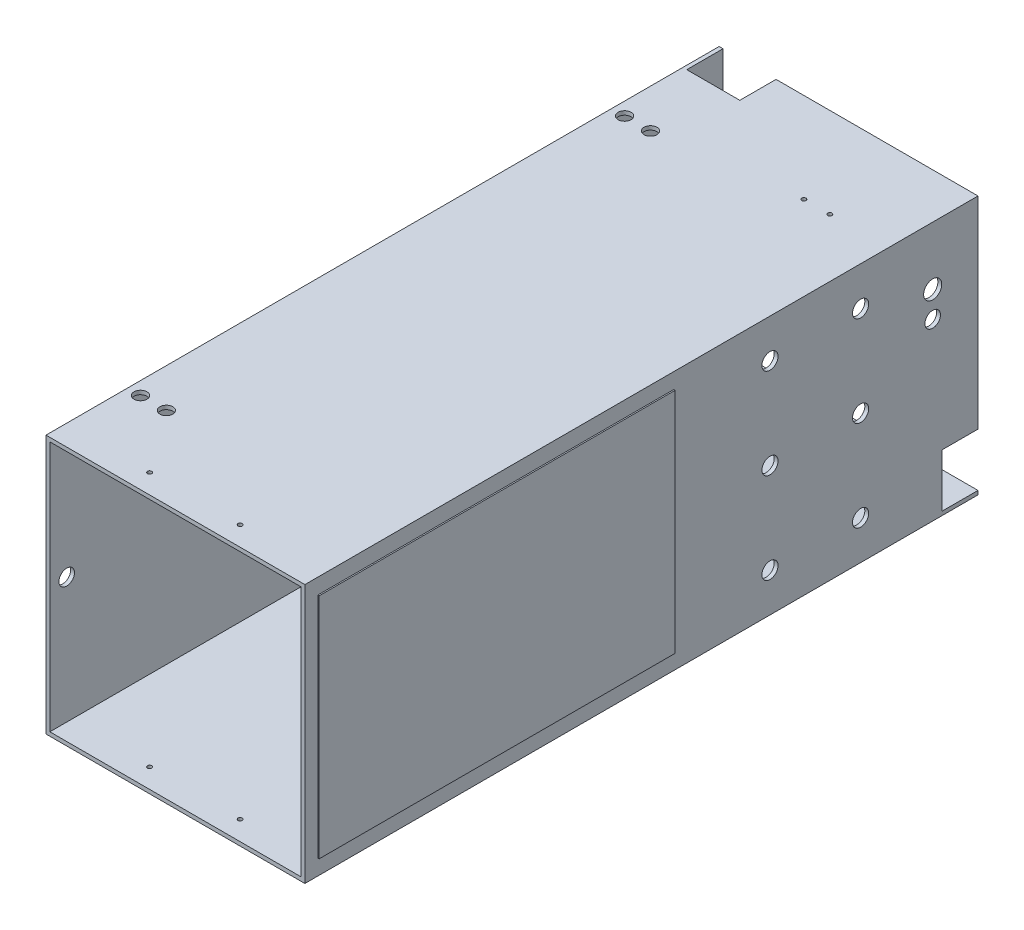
ISO-10303-21;
HEADER;
FILE_DESCRIPTION(('STEP AP214'),'2;1');
FILE_NAME('part.step','',(''),(''),'','','');
FILE_SCHEMA(('AUTOMOTIVE_DESIGN { 1 0 10303 214 1 1 1 1 }'));
ENDSEC;
DATA;
#1=APPLICATION_CONTEXT('core data for automotive mechanical design processes');
#2=APPLICATION_PROTOCOL_DEFINITION('international standard','automotive_design',2000,#1);
#3=PRODUCT_CONTEXT('',#1,'mechanical');
#4=PRODUCT('Part','Part','',(#3));
#5=PRODUCT_RELATED_PRODUCT_CATEGORY('part','',(#4));
#6=PRODUCT_DEFINITION_FORMATION('','',#4);
#7=PRODUCT_DEFINITION_CONTEXT('part definition',#1,'design');
#8=PRODUCT_DEFINITION('design','',#6,#7);
#9=PRODUCT_DEFINITION_SHAPE('','',#8);
#10=(LENGTH_UNIT() NAMED_UNIT(*) SI_UNIT(.MILLI.,.METRE.));
#11=(NAMED_UNIT(*) PLANE_ANGLE_UNIT() SI_UNIT($,.RADIAN.));
#12=(NAMED_UNIT(*) SI_UNIT($,.STERADIAN.) SOLID_ANGLE_UNIT());
#13=UNCERTAINTY_MEASURE_WITH_UNIT(LENGTH_MEASURE(1.E-05),#10,'distance_accuracy_value','');
#14=(GEOMETRIC_REPRESENTATION_CONTEXT(3) GLOBAL_UNCERTAINTY_ASSIGNED_CONTEXT((#13)) GLOBAL_UNIT_ASSIGNED_CONTEXT((#10,
#11,#12)) REPRESENTATION_CONTEXT('',''));
#15=CARTESIAN_POINT('',(0.,0.,0.));
#16=DIRECTION('',(0.,0.,1.));
#17=DIRECTION('',(1.,0.,0.));
#18=AXIS2_PLACEMENT_3D('',#15,#16,#17);
#19=CARTESIAN_POINT('',(0.,200.,520.));
#20=DIRECTION('',(0.,-1.,0.));
#21=DIRECTION('',(0.,0.,-1.));
#22=AXIS2_PLACEMENT_3D('',#19,#20,#21);
#23=PLANE('',#22);
#24=CARTESIAN_POINT('',(135.,200.,69.5));
#25=DIRECTION('',(0.,1.,0.));
#26=DIRECTION('',(0.,0.,1.));
#27=AXIS2_PLACEMENT_3D('',#24,#25,#26);
#28=CIRCLE('',#27,1.64999999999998);
#29=CARTESIAN_POINT('',(135.,200.,71.15));
#30=VERTEX_POINT('',#29);
#31=EDGE_CURVE('E1204',#30,#30,#28,.T.);
#32=ORIENTED_EDGE('',*,*,#31,.F.);
#33=EDGE_LOOP('',(#32));
#34=FACE_BOUND('',#33,.T.);
#35=CARTESIAN_POINT('',(65.,200.,505.));
#36=DIRECTION('',(0.,1.,0.));
#37=DIRECTION('',(0.,0.,1.));
#38=AXIS2_PLACEMENT_3D('',#35,#36,#37);
#39=CIRCLE('',#38,1.64999999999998);
#40=CARTESIAN_POINT('',(65.,200.,506.65));
#41=VERTEX_POINT('',#40);
#42=EDGE_CURVE('E1220',#41,#41,#39,.T.);
#43=ORIENTED_EDGE('',*,*,#42,.F.);
#44=EDGE_LOOP('',(#43));
#45=FACE_BOUND('',#44,.T.);
#46=CARTESIAN_POINT('',(30.0000000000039,200.,457.));
#47=DIRECTION('',(0.,1.,0.));
#48=DIRECTION('',(0.,0.,1.));
#49=AXIS2_PLACEMENT_3D('',#46,#47,#48);
#50=CIRCLE('',#49,5.);
#51=CARTESIAN_POINT('',(30.0000000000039,200.,462.));
#52=VERTEX_POINT('',#51);
#53=EDGE_CURVE('E242',#52,#52,#50,.T.);
#54=ORIENTED_EDGE('',*,*,#53,.F.);
#55=EDGE_LOOP('',(#54));
#56=FACE_BOUND('',#55,.T.);
#57=CARTESIAN_POINT('',(10.0000000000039,200.,457.));
#58=DIRECTION('',(0.,1.,0.));
#59=DIRECTION('',(0.,0.,1.));
#60=AXIS2_PLACEMENT_3D('',#57,#58,#59);
#61=CIRCLE('',#60,5.);
#62=CARTESIAN_POINT('',(10.0000000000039,200.,462.));
#63=VERTEX_POINT('',#62);
#64=EDGE_CURVE('E248',#63,#63,#61,.T.);
#65=ORIENTED_EDGE('',*,*,#64,.F.);
#66=EDGE_LOOP('',(#65));
#67=FACE_BOUND('',#66,.T.);
#68=CARTESIAN_POINT('',(30.,200.,83.));
#69=DIRECTION('',(0.,1.,0.));
#70=DIRECTION('',(0.,0.,1.));
#71=AXIS2_PLACEMENT_3D('',#68,#69,#70);
#72=CIRCLE('',#71,5.);
#73=CARTESIAN_POINT('',(30.,200.,88.));
#74=VERTEX_POINT('',#73);
#75=EDGE_CURVE('E275',#74,#74,#72,.T.);
#76=ORIENTED_EDGE('',*,*,#75,.F.);
#77=EDGE_LOOP('',(#76));
#78=FACE_BOUND('',#77,.T.);
#79=CARTESIAN_POINT('',(10.,200.,83.));
#80=DIRECTION('',(0.,1.,0.));
#81=DIRECTION('',(0.,0.,1.));
#82=AXIS2_PLACEMENT_3D('',#79,#80,#81);
#83=CIRCLE('',#82,5.);
#84=CARTESIAN_POINT('',(10.,200.,88.));
#85=VERTEX_POINT('',#84);
#86=EDGE_CURVE('E281',#85,#85,#83,.T.);
#87=ORIENTED_EDGE('',*,*,#86,.F.);
#88=EDGE_LOOP('',(#87));
#89=FACE_BOUND('',#88,.T.);
#90=DIRECTION('',(-1.,0.,0.));
#91=VECTOR('',#90,1.);
#92=CARTESIAN_POINT('',(0.,200.,0.));
#93=LINE('',#92,#91);
#94=CARTESIAN_POINT('',(200.,200.,0.));
#95=VERTEX_POINT('',#94);
#96=CARTESIAN_POINT('',(44.,200.,0.));
#97=VERTEX_POINT('',#96);
#98=EDGE_CURVE('E457',#95,#97,#93,.T.);
#99=ORIENTED_EDGE('',*,*,#98,.T.);
#100=DIRECTION('',(0.,0.,-1.));
#101=VECTOR('',#100,1.);
#102=CARTESIAN_POINT('',(44.,200.,0.));
#103=LINE('',#102,#101);
#104=CARTESIAN_POINT('',(44.,200.,28.));
#105=VERTEX_POINT('',#104);
#106=EDGE_CURVE('E262',#105,#97,#103,.T.);
#107=ORIENTED_EDGE('',*,*,#106,.F.);
#108=DIRECTION('',(1.,0.,0.));
#109=VECTOR('',#108,1.);
#110=CARTESIAN_POINT('',(44.,200.,28.));
#111=LINE('',#110,#109);
#112=CARTESIAN_POINT('',(3.,200.,28.));
#113=VERTEX_POINT('',#112);
#114=EDGE_CURVE('E259',#113,#105,#111,.T.);
#115=ORIENTED_EDGE('',*,*,#114,.F.);
#116=DIRECTION('',(0.,0.,1.));
#117=VECTOR('',#116,1.);
#118=CARTESIAN_POINT('',(3.,200.,0.));
#119=LINE('',#118,#117);
#120=CARTESIAN_POINT('',(3.,200.,0.));
#121=VERTEX_POINT('',#120);
#122=EDGE_CURVE('E256',#121,#113,#119,.T.);
#123=ORIENTED_EDGE('',*,*,#122,.F.);
#124=CARTESIAN_POINT('',(0.,200.,0.));
#125=VERTEX_POINT('',#124);
#126=EDGE_CURVE('E472',#121,#125,#93,.T.);
#127=ORIENTED_EDGE('',*,*,#126,.T.);
#128=DIRECTION('',(0.,0.,-1.));
#129=VECTOR('',#128,1.);
#130=CARTESIAN_POINT('',(0.,200.,520.));
#131=LINE('',#130,#129);
#132=CARTESIAN_POINT('',(0.,200.,520.));
#133=VERTEX_POINT('',#132);
#134=EDGE_CURVE('E463',#133,#125,#131,.T.);
#135=ORIENTED_EDGE('',*,*,#134,.F.);
#136=DIRECTION('',(-1.,0.,0.));
#137=VECTOR('',#136,1.);
#138=CARTESIAN_POINT('',(0.,200.,520.));
#139=LINE('',#138,#137);
#140=CARTESIAN_POINT('',(200.,200.,520.));
#141=VERTEX_POINT('',#140);
#142=EDGE_CURVE('E461',#141,#133,#139,.T.);
#143=ORIENTED_EDGE('',*,*,#142,.F.);
#144=DIRECTION('',(0.,0.,-1.));
#145=VECTOR('',#144,1.);
#146=CARTESIAN_POINT('',(200.,200.,520.));
#147=LINE('',#146,#145);
#148=EDGE_CURVE('E477',#141,#95,#147,.T.);
#149=ORIENTED_EDGE('',*,*,#148,.T.);
#150=EDGE_LOOP('',(#99,#107,#115,#123,#127,#135,#143,#149));
#151=FACE_BOUND('',#150,.T.);
#152=CARTESIAN_POINT('',(135.,200.,505.));
#153=DIRECTION('',(0.,1.,0.));
#154=DIRECTION('',(0.,0.,1.));
#155=AXIS2_PLACEMENT_3D('',#152,#153,#154);
#156=CIRCLE('',#155,1.64999999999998);
#157=CARTESIAN_POINT('',(135.,200.,506.65));
#158=VERTEX_POINT('',#157);
#159=EDGE_CURVE('E1214',#158,#158,#156,.T.);
#160=ORIENTED_EDGE('',*,*,#159,.F.);
#161=EDGE_LOOP('',(#160));
#162=FACE_BOUND('',#161,.T.);
#163=CARTESIAN_POINT('',(155.,200.,69.5));
#164=DIRECTION('',(0.,1.,0.));
#165=DIRECTION('',(0.,0.,1.));
#166=AXIS2_PLACEMENT_3D('',#163,#164,#165);
#167=CIRCLE('',#166,1.64999999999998);
#168=CARTESIAN_POINT('',(155.,200.,71.15));
#169=VERTEX_POINT('',#168);
#170=EDGE_CURVE('E1195',#169,#169,#167,.T.);
#171=ORIENTED_EDGE('',*,*,#170,.F.);
#172=EDGE_LOOP('',(#171));
#173=FACE_BOUND('',#172,.T.);
#174=ADVANCED_FACE('F36',(#34,#45,#56,#67,#78,#89,#151,#162,#173),#23,.F.);
#175=CARTESIAN_POINT('',(200.,0.,520.));
#176=DIRECTION('',(-1.,0.,0.));
#177=DIRECTION('',(0.,0.,1.));
#178=AXIS2_PLACEMENT_3D('',#175,#176,#177);
#179=PLANE('',#178);
#180=DIRECTION('',(0.,1.,0.));
#181=VECTOR('',#180,1.);
#182=CARTESIAN_POINT('',(200.,0.,0.));
#183=LINE('',#182,#181);
#184=CARTESIAN_POINT('',(200.,0.,0.));
#185=VERTEX_POINT('',#184);
#186=CARTESIAN_POINT('',(200.,3.,0.));
#187=VERTEX_POINT('',#186);
#188=EDGE_CURVE('E469',#185,#187,#183,.T.);
#189=ORIENTED_EDGE('',*,*,#188,.T.);
#190=DIRECTION('',(0.,0.,-1.));
#191=VECTOR('',#190,1.);
#192=CARTESIAN_POINT('',(200.,3.,0.));
#193=LINE('',#192,#191);
#194=CARTESIAN_POINT('',(200.,3.,28.));
#195=VERTEX_POINT('',#194);
#196=EDGE_CURVE('E322',#195,#187,#193,.T.);
#197=ORIENTED_EDGE('',*,*,#196,.F.);
#198=DIRECTION('',(0.,-1.,0.));
#199=VECTOR('',#198,1.);
#200=CARTESIAN_POINT('',(200.,44.,28.));
#201=LINE('',#200,#199);
#202=CARTESIAN_POINT('',(200.,44.,28.));
#203=VERTEX_POINT('',#202);
#204=EDGE_CURVE('E326',#203,#195,#201,.T.);
#205=ORIENTED_EDGE('',*,*,#204,.F.);
#206=DIRECTION('',(0.,0.,1.));
#207=VECTOR('',#206,1.);
#208=CARTESIAN_POINT('',(200.,44.,0.));
#209=LINE('',#208,#207);
#210=CARTESIAN_POINT('',(200.,44.,0.));
#211=VERTEX_POINT('',#210);
#212=EDGE_CURVE('E329',#211,#203,#209,.T.);
#213=ORIENTED_EDGE('',*,*,#212,.F.);
#214=EDGE_CURVE('E468',#211,#95,#183,.T.);
#215=ORIENTED_EDGE('',*,*,#214,.T.);
#216=ORIENTED_EDGE('',*,*,#148,.F.);
#217=DIRECTION('',(0.,1.,0.));
#218=VECTOR('',#217,1.);
#219=CARTESIAN_POINT('',(200.,0.,520.));
#220=LINE('',#219,#218);
#221=CARTESIAN_POINT('',(200.,0.,520.));
#222=VERTEX_POINT('',#221);
#223=EDGE_CURVE('E459',#222,#141,#220,.T.);
#224=ORIENTED_EDGE('',*,*,#223,.F.);
#225=DIRECTION('',(0.,0.,-1.));
#226=VECTOR('',#225,1.);
#227=CARTESIAN_POINT('',(200.,0.,520.));
#228=LINE('',#227,#226);
#229=EDGE_CURVE('E44',#222,#185,#228,.T.);
#230=ORIENTED_EDGE('',*,*,#229,.T.);
#231=EDGE_LOOP('',(#189,#197,#205,#213,#215,#216,#224,#230));
#232=FACE_BOUND('',#231,.T.);
#233=CARTESIAN_POINT('',(200.,170.,90.7));
#234=DIRECTION('',(1.,0.,0.));
#235=DIRECTION('',(0.,0.,-1.));
#236=AXIS2_PLACEMENT_3D('',#233,#234,#235);
#237=CIRCLE('',#236,6.25000000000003);
#238=CARTESIAN_POINT('',(200.,170.,84.45));
#239=VERTEX_POINT('',#238);
#240=EDGE_CURVE('E382',#239,#239,#237,.T.);
#241=ORIENTED_EDGE('',*,*,#240,.F.);
#242=EDGE_LOOP('',(#241));
#243=FACE_BOUND('',#242,.T.);
#244=CARTESIAN_POINT('',(200.,170.,160.7));
#245=DIRECTION('',(1.,0.,0.));
#246=DIRECTION('',(0.,0.,-1.));
#247=AXIS2_PLACEMENT_3D('',#244,#245,#246);
#248=CIRCLE('',#247,6.25000000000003);
#249=CARTESIAN_POINT('',(200.,170.,154.45));
#250=VERTEX_POINT('',#249);
#251=EDGE_CURVE('E376',#250,#250,#248,.T.);
#252=ORIENTED_EDGE('',*,*,#251,.F.);
#253=EDGE_LOOP('',(#252));
#254=FACE_BOUND('',#253,.T.);
#255=CARTESIAN_POINT('',(200.,100.,90.7));
#256=DIRECTION('',(1.,0.,0.));
#257=DIRECTION('',(0.,0.,-1.));
#258=AXIS2_PLACEMENT_3D('',#255,#256,#257);
#259=CIRCLE('',#258,6.25);
#260=CARTESIAN_POINT('',(200.,100.,84.45));
#261=VERTEX_POINT('',#260);
#262=EDGE_CURVE('E370',#261,#261,#259,.T.);
#263=ORIENTED_EDGE('',*,*,#262,.F.);
#264=EDGE_LOOP('',(#263));
#265=FACE_BOUND('',#264,.T.);
#266=CARTESIAN_POINT('',(200.,100.,160.7));
#267=DIRECTION('',(1.,0.,0.));
#268=DIRECTION('',(0.,0.,-1.));
#269=AXIS2_PLACEMENT_3D('',#266,#267,#268);
#270=CIRCLE('',#269,6.25);
#271=CARTESIAN_POINT('',(200.,100.,154.45));
#272=VERTEX_POINT('',#271);
#273=EDGE_CURVE('E364',#272,#272,#270,.T.);
#274=ORIENTED_EDGE('',*,*,#273,.F.);
#275=EDGE_LOOP('',(#274));
#276=FACE_BOUND('',#275,.T.);
#277=CARTESIAN_POINT('',(200.,30.,90.7));
#278=DIRECTION('',(1.,0.,0.));
#279=DIRECTION('',(0.,0.,-1.));
#280=AXIS2_PLACEMENT_3D('',#277,#278,#279);
#281=CIRCLE('',#280,6.25000000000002);
#282=CARTESIAN_POINT('',(200.,30.,84.45));
#283=VERTEX_POINT('',#282);
#284=EDGE_CURVE('E358',#283,#283,#281,.T.);
#285=ORIENTED_EDGE('',*,*,#284,.F.);
#286=EDGE_LOOP('',(#285));
#287=FACE_BOUND('',#286,.T.);
#288=CARTESIAN_POINT('',(200.,30.,160.7));
#289=DIRECTION('',(1.,0.,0.));
#290=DIRECTION('',(0.,0.,-1.));
#291=AXIS2_PLACEMENT_3D('',#288,#289,#290);
#292=CIRCLE('',#291,6.25);
#293=CARTESIAN_POINT('',(200.,30.,154.45));
#294=VERTEX_POINT('',#293);
#295=EDGE_CURVE('E352',#294,#294,#292,.T.);
#296=ORIENTED_EDGE('',*,*,#295,.F.);
#297=EDGE_LOOP('',(#296));
#298=FACE_BOUND('',#297,.T.);
#299=CARTESIAN_POINT('',(200.,155.,35.));
#300=DIRECTION('',(1.,0.,0.));
#301=DIRECTION('',(0.,0.,-1.));
#302=AXIS2_PLACEMENT_3D('',#299,#300,#301);
#303=CIRCLE('',#302,7.);
#304=CARTESIAN_POINT('',(200.,155.,28.));
#305=VERTEX_POINT('',#304);
#306=EDGE_CURVE('E346',#305,#305,#303,.T.);
#307=ORIENTED_EDGE('',*,*,#306,.F.);
#308=EDGE_LOOP('',(#307));
#309=FACE_BOUND('',#308,.T.);
#310=CARTESIAN_POINT('',(200.,135.,35.));
#311=DIRECTION('',(1.,0.,0.));
#312=DIRECTION('',(0.,0.,-1.));
#313=AXIS2_PLACEMENT_3D('',#310,#311,#312);
#314=CIRCLE('',#313,6.);
#315=CARTESIAN_POINT('',(200.,135.,29.));
#316=VERTEX_POINT('',#315);
#317=EDGE_CURVE('E340',#316,#316,#314,.T.);
#318=ORIENTED_EDGE('',*,*,#317,.F.);
#319=EDGE_LOOP('',(#318));
#320=FACE_BOUND('',#319,.T.);
#321=DIRECTION('',(0.,-1.,0.));
#322=VECTOR('',#321,1.);
#323=CARTESIAN_POINT('',(200.,12.,510.));
#324=LINE('',#323,#322);
#325=CARTESIAN_POINT('',(200.,188.,510.));
#326=VERTEX_POINT('',#325);
#327=CARTESIAN_POINT('',(200.,12.,510.));
#328=VERTEX_POINT('',#327);
#329=EDGE_CURVE('E205',#326,#328,#324,.T.);
#330=ORIENTED_EDGE('',*,*,#329,.F.);
#331=DIRECTION('',(0.,0.,1.));
#332=VECTOR('',#331,1.);
#333=CARTESIAN_POINT('',(200.,188.,510.));
#334=LINE('',#333,#332);
#335=CARTESIAN_POINT('',(200.,188.,235.));
#336=VERTEX_POINT('',#335);
#337=EDGE_CURVE('E202',#336,#326,#334,.T.);
#338=ORIENTED_EDGE('',*,*,#337,.F.);
#339=DIRECTION('',(0.,1.,0.));
#340=VECTOR('',#339,1.);
#341=CARTESIAN_POINT('',(200.,12.,235.));
#342=LINE('',#341,#340);
#343=CARTESIAN_POINT('',(200.,12.,235.));
#344=VERTEX_POINT('',#343);
#345=EDGE_CURVE('E56',#344,#336,#342,.T.);
#346=ORIENTED_EDGE('',*,*,#345,.F.);
#347=DIRECTION('',(0.,0.,-1.));
#348=VECTOR('',#347,1.);
#349=CARTESIAN_POINT('',(200.,12.,510.));
#350=LINE('',#349,#348);
#351=EDGE_CURVE('E51',#328,#344,#350,.T.);
#352=ORIENTED_EDGE('',*,*,#351,.F.);
#353=EDGE_LOOP('',(#330,#338,#346,#352));
#354=FACE_BOUND('',#353,.T.);
#355=ADVANCED_FACE('F484',(#232,#243,#254,#265,#276,#287,#298,#309,#320,#354),#179,.F.);
#356=CARTESIAN_POINT('',(0.,200.,0.));
#357=DIRECTION('',(0.,0.,-1.));
#358=DIRECTION('',(-1.,0.,0.));
#359=AXIS2_PLACEMENT_3D('',#356,#357,#358);
#360=PLANE('',#359);
#361=DIRECTION('',(0.,1.,0.));
#362=VECTOR('',#361,1.);
#363=CARTESIAN_POINT('',(44.,-0.001000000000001,0.));
#364=LINE('',#363,#362);
#365=CARTESIAN_POINT('',(44.,197.,0.));
#366=VERTEX_POINT('',#365);
#367=EDGE_CURVE('E265',#366,#97,#364,.T.);
#368=ORIENTED_EDGE('',*,*,#367,.T.);
#369=ORIENTED_EDGE('',*,*,#98,.F.);
#370=ORIENTED_EDGE('',*,*,#214,.F.);
#371=DIRECTION('',(1.,0.,0.));
#372=VECTOR('',#371,1.);
#373=CARTESIAN_POINT('',(-0.001000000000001,44.,0.));
#374=LINE('',#373,#372);
#375=CARTESIAN_POINT('',(197.,44.,0.));
#376=VERTEX_POINT('',#375);
#377=EDGE_CURVE('E316',#376,#211,#374,.T.);
#378=ORIENTED_EDGE('',*,*,#377,.F.);
#379=DIRECTION('',(0.,1.,0.));
#380=VECTOR('',#379,1.);
#381=CARTESIAN_POINT('',(197.,3.,0.));
#382=LINE('',#381,#380);
#383=CARTESIAN_POINT('',(197.,197.,0.));
#384=VERTEX_POINT('',#383);
#385=EDGE_CURVE('E434',#376,#384,#382,.T.);
#386=ORIENTED_EDGE('',*,*,#385,.T.);
#387=DIRECTION('',(-1.,0.,0.));
#388=VECTOR('',#387,1.);
#389=CARTESIAN_POINT('',(3.,197.,0.));
#390=LINE('',#389,#388);
#391=EDGE_CURVE('E436',#384,#366,#390,.T.);
#392=ORIENTED_EDGE('',*,*,#391,.T.);
#393=EDGE_LOOP('',(#368,#369,#370,#378,#386,#392));
#394=FACE_BOUND('',#393,.T.);
#395=ADVANCED_FACE('F507',(#394),#360,.T.);
#396=CARTESIAN_POINT('',(0.,200.,520.));
#397=DIRECTION('',(0.,0.,-1.));
#398=DIRECTION('',(-1.,0.,0.));
#399=AXIS2_PLACEMENT_3D('',#396,#397,#398);
#400=PLANE('',#399);
#401=DIRECTION('',(0.,-1.,0.));
#402=VECTOR('',#401,1.);
#403=CARTESIAN_POINT('',(0.,0.,520.));
#404=LINE('',#403,#402);
#405=CARTESIAN_POINT('',(0.,0.,520.));
#406=VERTEX_POINT('',#405);
#407=EDGE_CURVE('E453',#133,#406,#404,.T.);
#408=ORIENTED_EDGE('',*,*,#407,.T.);
#409=DIRECTION('',(1.,0.,0.));
#410=VECTOR('',#409,1.);
#411=CARTESIAN_POINT('',(0.,0.,520.));
#412=LINE('',#411,#410);
#413=EDGE_CURVE('E456',#406,#222,#412,.T.);
#414=ORIENTED_EDGE('',*,*,#413,.T.);
#415=ORIENTED_EDGE('',*,*,#223,.T.);
#416=ORIENTED_EDGE('',*,*,#142,.T.);
#417=EDGE_LOOP('',(#408,#414,#415,#416));
#418=FACE_BOUND('',#417,.T.);
#419=DIRECTION('',(1.,0.,0.));
#420=VECTOR('',#419,1.);
#421=CARTESIAN_POINT('',(3.,3.,520.));
#422=LINE('',#421,#420);
#423=CARTESIAN_POINT('',(3.,3.,520.));
#424=VERTEX_POINT('',#423);
#425=CARTESIAN_POINT('',(197.,3.,520.));
#426=VERTEX_POINT('',#425);
#427=EDGE_CURVE('E422',#424,#426,#422,.T.);
#428=ORIENTED_EDGE('',*,*,#427,.F.);
#429=DIRECTION('',(0.,-1.,0.));
#430=VECTOR('',#429,1.);
#431=CARTESIAN_POINT('',(3.,3.,520.));
#432=LINE('',#431,#430);
#433=CARTESIAN_POINT('',(3.,197.,520.));
#434=VERTEX_POINT('',#433);
#435=EDGE_CURVE('E430',#434,#424,#432,.T.);
#436=ORIENTED_EDGE('',*,*,#435,.F.);
#437=DIRECTION('',(-1.,0.,0.));
#438=VECTOR('',#437,1.);
#439=CARTESIAN_POINT('',(3.,197.,520.));
#440=LINE('',#439,#438);
#441=CARTESIAN_POINT('',(197.,197.,520.));
#442=VERTEX_POINT('',#441);
#443=EDGE_CURVE('E427',#442,#434,#440,.T.);
#444=ORIENTED_EDGE('',*,*,#443,.F.);
#445=DIRECTION('',(0.,1.,0.));
#446=VECTOR('',#445,1.);
#447=CARTESIAN_POINT('',(197.,3.,520.));
#448=LINE('',#447,#446);
#449=EDGE_CURVE('E424',#426,#442,#448,.T.);
#450=ORIENTED_EDGE('',*,*,#449,.F.);
#451=EDGE_LOOP('',(#428,#436,#444,#450));
#452=FACE_BOUND('',#451,.T.);
#453=ADVANCED_FACE('F529',(#418,#452),#400,.F.);
#454=ORIENTED_EDGE('',*,*,#126,.F.);
#455=DIRECTION('',(0.,-1.,0.));
#456=VECTOR('',#455,1.);
#457=CARTESIAN_POINT('',(3.,3.,0.));
#458=LINE('',#457,#456);
#459=CARTESIAN_POINT('',(3.,3.,0.));
#460=VERTEX_POINT('',#459);
#461=EDGE_CURVE('E425',#121,#460,#458,.T.);
#462=ORIENTED_EDGE('',*,*,#461,.T.);
#463=DIRECTION('',(1.,0.,0.));
#464=VECTOR('',#463,1.);
#465=CARTESIAN_POINT('',(3.,3.,0.));
#466=LINE('',#465,#464);
#467=EDGE_CURVE('E394',#460,#187,#466,.T.);
#468=ORIENTED_EDGE('',*,*,#467,.T.);
#469=ORIENTED_EDGE('',*,*,#188,.F.);
#470=DIRECTION('',(1.,0.,0.));
#471=VECTOR('',#470,1.);
#472=CARTESIAN_POINT('',(0.,0.,0.));
#473=LINE('',#472,#471);
#474=CARTESIAN_POINT('',(0.,0.,0.));
#475=VERTEX_POINT('',#474);
#476=EDGE_CURVE('E466',#475,#185,#473,.T.);
#477=ORIENTED_EDGE('',*,*,#476,.F.);
#478=DIRECTION('',(0.,-1.,0.));
#479=VECTOR('',#478,1.);
#480=CARTESIAN_POINT('',(0.,0.,0.));
#481=LINE('',#480,#479);
#482=EDGE_CURVE('E452',#125,#475,#481,.T.);
#483=ORIENTED_EDGE('',*,*,#482,.F.);
#484=EDGE_LOOP('',(#454,#462,#468,#469,#477,#483));
#485=FACE_BOUND('',#484,.T.);
#486=ADVANCED_FACE('F491',(#485),#360,.T.);
#487=CARTESIAN_POINT('',(0.,0.,520.));
#488=DIRECTION('',(1.,0.,0.));
#489=DIRECTION('',(0.,0.,-1.));
#490=AXIS2_PLACEMENT_3D('',#487,#488,#489);
#491=PLANE('',#490);
#492=CARTESIAN_POINT('',(0.,135.,35.));
#493=DIRECTION('',(-1.,0.,0.));
#494=DIRECTION('',(0.,0.,1.));
#495=AXIS2_PLACEMENT_3D('',#492,#493,#494);
#496=CIRCLE('',#495,2.5);
#497=CARTESIAN_POINT('',(0.,135.,37.5));
#498=VERTEX_POINT('',#497);
#499=EDGE_CURVE('E230',#498,#498,#496,.T.);
#500=ORIENTED_EDGE('',*,*,#499,.F.);
#501=EDGE_LOOP('',(#500));
#502=FACE_BOUND('',#501,.T.);
#503=CARTESIAN_POINT('',(0.,100.,507.));
#504=DIRECTION('',(-1.,0.,0.));
#505=DIRECTION('',(0.,0.,1.));
#506=AXIS2_PLACEMENT_3D('',#503,#504,#505);
#507=CIRCLE('',#506,5.99999999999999);
#508=CARTESIAN_POINT('',(0.,100.,513.));
#509=VERTEX_POINT('',#508);
#510=EDGE_CURVE('E238',#509,#509,#507,.T.);
#511=ORIENTED_EDGE('',*,*,#510,.F.);
#512=EDGE_LOOP('',(#511));
#513=FACE_BOUND('',#512,.T.);
#514=ORIENTED_EDGE('',*,*,#482,.T.);
#515=DIRECTION('',(0.,0.,-1.));
#516=VECTOR('',#515,1.);
#517=CARTESIAN_POINT('',(0.,0.,520.));
#518=LINE('',#517,#516);
#519=EDGE_CURVE('E11',#406,#475,#518,.T.);
#520=ORIENTED_EDGE('',*,*,#519,.F.);
#521=ORIENTED_EDGE('',*,*,#407,.F.);
#522=ORIENTED_EDGE('',*,*,#134,.T.);
#523=EDGE_LOOP('',(#514,#520,#521,#522));
#524=FACE_BOUND('',#523,.T.);
#525=ADVANCED_FACE('F38',(#502,#513,#524),#491,.F.);
#526=CARTESIAN_POINT('',(0.,0.,520.));
#527=DIRECTION('',(0.,1.,0.));
#528=DIRECTION('',(0.,0.,1.));
#529=AXIS2_PLACEMENT_3D('',#526,#527,#528);
#530=PLANE('',#529);
#531=CARTESIAN_POINT('',(155.,0.,69.5));
#532=DIRECTION('',(0.,1.,0.));
#533=DIRECTION('',(0.,0.,1.));
#534=AXIS2_PLACEMENT_3D('',#531,#532,#533);
#535=CIRCLE('',#534,1.64999999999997);
#536=CARTESIAN_POINT('',(155.,0.,71.15));
#537=VERTEX_POINT('',#536);
#538=EDGE_CURVE('E579',#537,#537,#535,.T.);
#539=ORIENTED_EDGE('',*,*,#538,.T.);
#540=EDGE_LOOP('',(#539));
#541=FACE_BOUND('',#540,.T.);
#542=CARTESIAN_POINT('',(135.,0.,69.5));
#543=DIRECTION('',(0.,1.,0.));
#544=DIRECTION('',(0.,0.,1.));
#545=AXIS2_PLACEMENT_3D('',#542,#543,#544);
#546=CIRCLE('',#545,1.64999999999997);
#547=CARTESIAN_POINT('',(135.,0.,71.15));
#548=VERTEX_POINT('',#547);
#549=EDGE_CURVE('E583',#548,#548,#546,.T.);
#550=ORIENTED_EDGE('',*,*,#549,.T.);
#551=EDGE_LOOP('',(#550));
#552=FACE_BOUND('',#551,.T.);
#553=CARTESIAN_POINT('',(65.,0.,505.));
#554=DIRECTION('',(0.,1.,0.));
#555=DIRECTION('',(0.,0.,1.));
#556=AXIS2_PLACEMENT_3D('',#553,#554,#555);
#557=CIRCLE('',#556,1.64999999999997);
#558=CARTESIAN_POINT('',(65.,0.,506.65));
#559=VERTEX_POINT('',#558);
#560=EDGE_CURVE('E587',#559,#559,#557,.T.);
#561=ORIENTED_EDGE('',*,*,#560,.T.);
#562=EDGE_LOOP('',(#561));
#563=FACE_BOUND('',#562,.T.);
#564=CARTESIAN_POINT('',(135.,0.,505.));
#565=DIRECTION('',(0.,1.,0.));
#566=DIRECTION('',(0.,0.,1.));
#567=AXIS2_PLACEMENT_3D('',#564,#565,#566);
#568=CIRCLE('',#567,1.64999999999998);
#569=CARTESIAN_POINT('',(135.,0.,506.65));
#570=VERTEX_POINT('',#569);
#571=EDGE_CURVE('E591',#570,#570,#568,.T.);
#572=ORIENTED_EDGE('',*,*,#571,.T.);
#573=EDGE_LOOP('',(#572));
#574=FACE_BOUND('',#573,.T.);
#575=CARTESIAN_POINT('',(170.,0.,206.7));
#576=DIRECTION('',(0.,-1.,0.));
#577=DIRECTION('',(0.,0.,-1.));
#578=AXIS2_PLACEMENT_3D('',#575,#576,#577);
#579=CIRCLE('',#578,7.00000000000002);
#580=CARTESIAN_POINT('',(170.,0.,199.7));
#581=VERTEX_POINT('',#580);
#582=EDGE_CURVE('E289',#581,#581,#579,.T.);
#583=ORIENTED_EDGE('',*,*,#582,.F.);
#584=EDGE_LOOP('',(#583));
#585=FACE_BOUND('',#584,.T.);
#586=CARTESIAN_POINT('',(150.,0.,380.));
#587=DIRECTION('',(0.,-1.,0.));
#588=DIRECTION('',(0.,0.,-1.));
#589=AXIS2_PLACEMENT_3D('',#586,#587,#588);
#590=CIRCLE('',#589,6.00000000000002);
#591=CARTESIAN_POINT('',(150.,0.,374.));
#592=VERTEX_POINT('',#591);
#593=EDGE_CURVE('E295',#592,#592,#590,.T.);
#594=ORIENTED_EDGE('',*,*,#593,.F.);
#595=EDGE_LOOP('',(#594));
#596=FACE_BOUND('',#595,.T.);
#597=ORIENTED_EDGE('',*,*,#476,.T.);
#598=ORIENTED_EDGE('',*,*,#229,.F.);
#599=ORIENTED_EDGE('',*,*,#413,.F.);
#600=ORIENTED_EDGE('',*,*,#519,.T.);
#601=EDGE_LOOP('',(#597,#598,#599,#600));
#602=FACE_BOUND('',#601,.T.);
#603=ADVANCED_FACE('F532',(#541,#552,#563,#574,#585,#596,#602),#530,.F.);
#604=CARTESIAN_POINT('',(3.,3.,520.));
#605=DIRECTION('',(0.,1.,0.));
#606=DIRECTION('',(0.,0.,1.));
#607=AXIS2_PLACEMENT_3D('',#604,#605,#606);
#608=PLANE('',#607);
#609=CARTESIAN_POINT('',(155.,3.,69.5));
#610=DIRECTION('',(0.,1.,0.));
#611=DIRECTION('',(0.,0.,1.));
#612=AXIS2_PLACEMENT_3D('',#609,#610,#611);
#613=CIRCLE('',#612,1.64999999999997);
#614=CARTESIAN_POINT('',(155.,3.,71.15));
#615=VERTEX_POINT('',#614);
#616=EDGE_CURVE('E1201',#615,#615,#613,.T.);
#617=ORIENTED_EDGE('',*,*,#616,.F.);
#618=EDGE_LOOP('',(#617));
#619=FACE_BOUND('',#618,.T.);
#620=CARTESIAN_POINT('',(135.,3.,69.5));
#621=DIRECTION('',(0.,1.,0.));
#622=DIRECTION('',(0.,0.,1.));
#623=AXIS2_PLACEMENT_3D('',#620,#621,#622);
#624=CIRCLE('',#623,1.64999999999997);
#625=CARTESIAN_POINT('',(135.,3.,71.15));
#626=VERTEX_POINT('',#625);
#627=EDGE_CURVE('E1211',#626,#626,#624,.T.);
#628=ORIENTED_EDGE('',*,*,#627,.F.);
#629=EDGE_LOOP('',(#628));
#630=FACE_BOUND('',#629,.T.);
#631=CARTESIAN_POINT('',(65.,3.,505.));
#632=DIRECTION('',(0.,1.,0.));
#633=DIRECTION('',(0.,0.,1.));
#634=AXIS2_PLACEMENT_3D('',#631,#632,#633);
#635=CIRCLE('',#634,1.64999999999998);
#636=CARTESIAN_POINT('',(65.,3.,506.65));
#637=VERTEX_POINT('',#636);
#638=EDGE_CURVE('E1226',#637,#637,#635,.T.);
#639=ORIENTED_EDGE('',*,*,#638,.F.);
#640=EDGE_LOOP('',(#639));
#641=FACE_BOUND('',#640,.T.);
#642=CARTESIAN_POINT('',(135.,3.,505.));
#643=DIRECTION('',(0.,1.,0.));
#644=DIRECTION('',(0.,0.,1.));
#645=AXIS2_PLACEMENT_3D('',#642,#643,#644);
#646=CIRCLE('',#645,1.64999999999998);
#647=CARTESIAN_POINT('',(135.,3.,506.65));
#648=VERTEX_POINT('',#647);
#649=EDGE_CURVE('E1230',#648,#648,#646,.T.);
#650=ORIENTED_EDGE('',*,*,#649,.F.);
#651=EDGE_LOOP('',(#650));
#652=FACE_BOUND('',#651,.T.);
#653=CARTESIAN_POINT('',(170.,3.,206.7));
#654=DIRECTION('',(0.,1.,0.));
#655=DIRECTION('',(0.,0.,1.));
#656=AXIS2_PLACEMENT_3D('',#653,#654,#655);
#657=CIRCLE('',#656,7.00000000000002);
#658=CARTESIAN_POINT('',(170.,3.,199.7));
#659=VERTEX_POINT('',#658);
#660=EDGE_CURVE('E284',#659,#659,#657,.F.);
#661=ORIENTED_EDGE('',*,*,#660,.T.);
#662=EDGE_LOOP('',(#661));
#663=FACE_BOUND('',#662,.T.);
#664=CARTESIAN_POINT('',(150.,3.,380.));
#665=DIRECTION('',(0.,1.,0.));
#666=DIRECTION('',(0.,0.,1.));
#667=AXIS2_PLACEMENT_3D('',#664,#665,#666);
#668=CIRCLE('',#667,6.00000000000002);
#669=CARTESIAN_POINT('',(150.,3.,374.));
#670=VERTEX_POINT('',#669);
#671=EDGE_CURVE('E292',#670,#670,#668,.F.);
#672=ORIENTED_EDGE('',*,*,#671,.T.);
#673=EDGE_LOOP('',(#672));
#674=FACE_BOUND('',#673,.T.);
#675=ORIENTED_EDGE('',*,*,#467,.F.);
#676=DIRECTION('',(0.,0.,-1.));
#677=VECTOR('',#676,1.);
#678=CARTESIAN_POINT('',(3.,3.,520.));
#679=LINE('',#678,#677);
#680=EDGE_CURVE('E432',#424,#460,#679,.T.);
#681=ORIENTED_EDGE('',*,*,#680,.F.);
#682=ORIENTED_EDGE('',*,*,#427,.T.);
#683=DIRECTION('',(0.,0.,-1.));
#684=VECTOR('',#683,1.);
#685=CARTESIAN_POINT('',(197.,3.,520.));
#686=LINE('',#685,#684);
#687=CARTESIAN_POINT('',(197.,3.,28.));
#688=VERTEX_POINT('',#687);
#689=EDGE_CURVE('E449',#426,#688,#686,.T.);
#690=ORIENTED_EDGE('',*,*,#689,.T.);
#691=DIRECTION('',(1.,0.,0.));
#692=VECTOR('',#691,1.);
#693=CARTESIAN_POINT('',(-0.001000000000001,3.,28.));
#694=LINE('',#693,#692);
#695=EDGE_CURVE('E321',#688,#195,#694,.T.);
#696=ORIENTED_EDGE('',*,*,#695,.T.);
#697=ORIENTED_EDGE('',*,*,#196,.T.);
#698=EDGE_LOOP('',(#675,#681,#682,#690,#696,#697));
#699=FACE_BOUND('',#698,.T.);
#700=ADVANCED_FACE('F495',(#619,#630,#641,#652,#663,#674,#699),#608,.T.);
#701=CARTESIAN_POINT('',(197.,3.,520.));
#702=DIRECTION('',(-1.,0.,0.));
#703=DIRECTION('',(0.,0.,1.));
#704=AXIS2_PLACEMENT_3D('',#701,#702,#703);
#705=PLANE('',#704);
#706=CARTESIAN_POINT('',(197.,17.,245.));
#707=DIRECTION('',(-1.,0.,0.));
#708=DIRECTION('',(0.,0.,1.));
#709=AXIS2_PLACEMENT_3D('',#706,#707,#708);
#710=CIRCLE('',#709,1.64999999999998);
#711=CARTESIAN_POINT('',(197.,17.,246.65));
#712=VERTEX_POINT('',#711);
#713=EDGE_CURVE('E298',#712,#712,#710,.T.);
#714=ORIENTED_EDGE('',*,*,#713,.F.);
#715=EDGE_LOOP('',(#714));
#716=FACE_BOUND('',#715,.T.);
#717=CARTESIAN_POINT('',(197.,183.,245.));
#718=DIRECTION('',(-1.,0.,0.));
#719=DIRECTION('',(0.,0.,1.));
#720=AXIS2_PLACEMENT_3D('',#717,#718,#719);
#721=CIRCLE('',#720,1.64999999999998);
#722=CARTESIAN_POINT('',(197.,183.,246.65));
#723=VERTEX_POINT('',#722);
#724=EDGE_CURVE('E301',#723,#723,#721,.T.);
#725=ORIENTED_EDGE('',*,*,#724,.F.);
#726=EDGE_LOOP('',(#725));
#727=FACE_BOUND('',#726,.T.);
#728=CARTESIAN_POINT('',(197.,17.,375.));
#729=DIRECTION('',(-1.,0.,0.));
#730=DIRECTION('',(0.,0.,1.));
#731=AXIS2_PLACEMENT_3D('',#728,#729,#730);
#732=CIRCLE('',#731,1.64999999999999);
#733=CARTESIAN_POINT('',(197.,17.,376.65));
#734=VERTEX_POINT('',#733);
#735=EDGE_CURVE('E304',#734,#734,#732,.T.);
#736=ORIENTED_EDGE('',*,*,#735,.F.);
#737=EDGE_LOOP('',(#736));
#738=FACE_BOUND('',#737,.T.);
#739=CARTESIAN_POINT('',(197.,183.,375.));
#740=DIRECTION('',(-1.,0.,0.));
#741=DIRECTION('',(0.,0.,1.));
#742=AXIS2_PLACEMENT_3D('',#739,#740,#741);
#743=CIRCLE('',#742,1.65);
#744=CARTESIAN_POINT('',(197.,183.,376.65));
#745=VERTEX_POINT('',#744);
#746=EDGE_CURVE('E307',#745,#745,#743,.T.);
#747=ORIENTED_EDGE('',*,*,#746,.F.);
#748=EDGE_LOOP('',(#747));
#749=FACE_BOUND('',#748,.T.);
#750=CARTESIAN_POINT('',(197.,17.,500.));
#751=DIRECTION('',(-1.,0.,0.));
#752=DIRECTION('',(0.,0.,1.));
#753=AXIS2_PLACEMENT_3D('',#750,#751,#752);
#754=CIRCLE('',#753,1.64999999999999);
#755=CARTESIAN_POINT('',(197.,17.,501.65));
#756=VERTEX_POINT('',#755);
#757=EDGE_CURVE('E310',#756,#756,#754,.T.);
#758=ORIENTED_EDGE('',*,*,#757,.F.);
#759=EDGE_LOOP('',(#758));
#760=FACE_BOUND('',#759,.T.);
#761=CARTESIAN_POINT('',(197.,183.,500.));
#762=DIRECTION('',(-1.,0.,0.));
#763=DIRECTION('',(0.,0.,1.));
#764=AXIS2_PLACEMENT_3D('',#761,#762,#763);
#765=CIRCLE('',#764,1.65);
#766=CARTESIAN_POINT('',(197.,183.,501.65));
#767=VERTEX_POINT('',#766);
#768=EDGE_CURVE('E313',#767,#767,#765,.T.);
#769=ORIENTED_EDGE('',*,*,#768,.F.);
#770=EDGE_LOOP('',(#769));
#771=FACE_BOUND('',#770,.T.);
#772=DIRECTION('',(0.,-1.,0.));
#773=VECTOR('',#772,1.);
#774=CARTESIAN_POINT('',(197.,44.,28.));
#775=LINE('',#774,#773);
#776=CARTESIAN_POINT('',(197.,44.,28.));
#777=VERTEX_POINT('',#776);
#778=EDGE_CURVE('E332',#777,#688,#775,.T.);
#779=ORIENTED_EDGE('',*,*,#778,.T.);
#780=ORIENTED_EDGE('',*,*,#689,.F.);
#781=ORIENTED_EDGE('',*,*,#449,.T.);
#782=DIRECTION('',(0.,0.,-1.));
#783=VECTOR('',#782,1.);
#784=CARTESIAN_POINT('',(197.,197.,520.));
#785=LINE('',#784,#783);
#786=EDGE_CURVE('E446',#442,#384,#785,.T.);
#787=ORIENTED_EDGE('',*,*,#786,.T.);
#788=ORIENTED_EDGE('',*,*,#385,.F.);
#789=DIRECTION('',(0.,0.,1.));
#790=VECTOR('',#789,1.);
#791=CARTESIAN_POINT('',(197.,44.,0.));
#792=LINE('',#791,#790);
#793=EDGE_CURVE('E317',#376,#777,#792,.T.);
#794=ORIENTED_EDGE('',*,*,#793,.T.);
#795=EDGE_LOOP('',(#779,#780,#781,#787,#788,#794));
#796=FACE_BOUND('',#795,.T.);
#797=CARTESIAN_POINT('',(197.,135.,35.));
#798=DIRECTION('',(-1.,0.,0.));
#799=DIRECTION('',(0.,0.,1.));
#800=AXIS2_PLACEMENT_3D('',#797,#798,#799);
#801=CIRCLE('',#800,6.);
#802=CARTESIAN_POINT('',(197.,135.,29.));
#803=VERTEX_POINT('',#802);
#804=EDGE_CURVE('E325',#803,#803,#801,.F.);
#805=ORIENTED_EDGE('',*,*,#804,.T.);
#806=EDGE_LOOP('',(#805));
#807=FACE_BOUND('',#806,.T.);
#808=CARTESIAN_POINT('',(197.,155.,35.));
#809=DIRECTION('',(-1.,0.,0.));
#810=DIRECTION('',(0.,0.,1.));
#811=AXIS2_PLACEMENT_3D('',#808,#809,#810);
#812=CIRCLE('',#811,7.);
#813=CARTESIAN_POINT('',(197.,155.,28.));
#814=VERTEX_POINT('',#813);
#815=EDGE_CURVE('E343',#814,#814,#812,.F.);
#816=ORIENTED_EDGE('',*,*,#815,.T.);
#817=EDGE_LOOP('',(#816));
#818=FACE_BOUND('',#817,.T.);
#819=CARTESIAN_POINT('',(197.,30.,160.7));
#820=DIRECTION('',(-1.,0.,0.));
#821=DIRECTION('',(0.,0.,1.));
#822=AXIS2_PLACEMENT_3D('',#819,#820,#821);
#823=CIRCLE('',#822,6.25);
#824=CARTESIAN_POINT('',(197.,30.,154.45));
#825=VERTEX_POINT('',#824);
#826=EDGE_CURVE('E349',#825,#825,#823,.F.);
#827=ORIENTED_EDGE('',*,*,#826,.T.);
#828=EDGE_LOOP('',(#827));
#829=FACE_BOUND('',#828,.T.);
#830=CARTESIAN_POINT('',(197.,30.,90.7));
#831=DIRECTION('',(-1.,0.,0.));
#832=DIRECTION('',(0.,0.,1.));
#833=AXIS2_PLACEMENT_3D('',#830,#831,#832);
#834=CIRCLE('',#833,6.25000000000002);
#835=CARTESIAN_POINT('',(197.,30.,84.45));
#836=VERTEX_POINT('',#835);
#837=EDGE_CURVE('E355',#836,#836,#834,.F.);
#838=ORIENTED_EDGE('',*,*,#837,.T.);
#839=EDGE_LOOP('',(#838));
#840=FACE_BOUND('',#839,.T.);
#841=CARTESIAN_POINT('',(197.,100.,160.7));
#842=DIRECTION('',(-1.,0.,0.));
#843=DIRECTION('',(0.,0.,1.));
#844=AXIS2_PLACEMENT_3D('',#841,#842,#843);
#845=CIRCLE('',#844,6.25);
#846=CARTESIAN_POINT('',(197.,100.,154.45));
#847=VERTEX_POINT('',#846);
#848=EDGE_CURVE('E361',#847,#847,#845,.F.);
#849=ORIENTED_EDGE('',*,*,#848,.T.);
#850=EDGE_LOOP('',(#849));
#851=FACE_BOUND('',#850,.T.);
#852=CARTESIAN_POINT('',(197.,100.,90.7));
#853=DIRECTION('',(-1.,0.,0.));
#854=DIRECTION('',(0.,0.,1.));
#855=AXIS2_PLACEMENT_3D('',#852,#853,#854);
#856=CIRCLE('',#855,6.25);
#857=CARTESIAN_POINT('',(197.,100.,84.45));
#858=VERTEX_POINT('',#857);
#859=EDGE_CURVE('E367',#858,#858,#856,.F.);
#860=ORIENTED_EDGE('',*,*,#859,.T.);
#861=EDGE_LOOP('',(#860));
#862=FACE_BOUND('',#861,.T.);
#863=CARTESIAN_POINT('',(197.,170.,160.7));
#864=DIRECTION('',(-1.,0.,0.));
#865=DIRECTION('',(0.,0.,1.));
#866=AXIS2_PLACEMENT_3D('',#863,#864,#865);
#867=CIRCLE('',#866,6.25000000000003);
#868=CARTESIAN_POINT('',(197.,170.,154.45));
#869=VERTEX_POINT('',#868);
#870=EDGE_CURVE('E373',#869,#869,#867,.F.);
#871=ORIENTED_EDGE('',*,*,#870,.T.);
#872=EDGE_LOOP('',(#871));
#873=FACE_BOUND('',#872,.T.);
#874=CARTESIAN_POINT('',(197.,170.,90.7));
#875=DIRECTION('',(-1.,0.,0.));
#876=DIRECTION('',(0.,0.,1.));
#877=AXIS2_PLACEMENT_3D('',#874,#875,#876);
#878=CIRCLE('',#877,6.25000000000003);
#879=CARTESIAN_POINT('',(197.,170.,84.45));
#880=VERTEX_POINT('',#879);
#881=EDGE_CURVE('E379',#880,#880,#878,.F.);
#882=ORIENTED_EDGE('',*,*,#881,.T.);
#883=EDGE_LOOP('',(#882));
#884=FACE_BOUND('',#883,.T.);
#885=DIRECTION('',(0.,-1.,0.));
#886=VECTOR('',#885,1.);
#887=CARTESIAN_POINT('',(197.,20.,505.));
#888=LINE('',#887,#886);
#889=CARTESIAN_POINT('',(197.,180.,505.));
#890=VERTEX_POINT('',#889);
#891=CARTESIAN_POINT('',(197.,20.,505.));
#892=VERTEX_POINT('',#891);
#893=EDGE_CURVE('E385',#890,#892,#888,.T.);
#894=ORIENTED_EDGE('',*,*,#893,.T.);
#895=DIRECTION('',(0.,0.,-1.));
#896=VECTOR('',#895,1.);
#897=CARTESIAN_POINT('',(197.,20.,505.));
#898=LINE('',#897,#896);
#899=CARTESIAN_POINT('',(197.,20.,240.));
#900=VERTEX_POINT('',#899);
#901=EDGE_CURVE('E386',#892,#900,#898,.T.);
#902=ORIENTED_EDGE('',*,*,#901,.T.);
#903=DIRECTION('',(0.,1.,0.));
#904=VECTOR('',#903,1.);
#905=CARTESIAN_POINT('',(197.,20.,240.));
#906=LINE('',#905,#904);
#907=CARTESIAN_POINT('',(197.,180.,240.));
#908=VERTEX_POINT('',#907);
#909=EDGE_CURVE('E411',#900,#908,#906,.T.);
#910=ORIENTED_EDGE('',*,*,#909,.T.);
#911=DIRECTION('',(0.,0.,1.));
#912=VECTOR('',#911,1.);
#913=CARTESIAN_POINT('',(197.,180.,505.));
#914=LINE('',#913,#912);
#915=EDGE_CURVE('E407',#908,#890,#914,.T.);
#916=ORIENTED_EDGE('',*,*,#915,.T.);
#917=EDGE_LOOP('',(#894,#902,#910,#916));
#918=FACE_BOUND('',#917,.T.);
#919=ADVANCED_FACE('F510',(#716,#727,#738,#749,#760,#771,#796,#807,#818,#829,#840,#851,#862,
#873,#884,#918),#705,.T.);
#920=CARTESIAN_POINT('',(3.,197.,520.));
#921=DIRECTION('',(0.,-1.,0.));
#922=DIRECTION('',(0.,0.,-1.));
#923=AXIS2_PLACEMENT_3D('',#920,#921,#922);
#924=PLANE('',#923);
#925=CARTESIAN_POINT('',(155.,197.,69.5));
#926=DIRECTION('',(0.,-1.,0.));
#927=DIRECTION('',(0.,0.,-1.));
#928=AXIS2_PLACEMENT_3D('',#925,#926,#927);
#929=CIRCLE('',#928,1.64999999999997);
#930=CARTESIAN_POINT('',(155.,197.,67.85));
#931=VERTEX_POINT('',#930);
#932=EDGE_CURVE('E1192',#931,#931,#929,.T.);
#933=ORIENTED_EDGE('',*,*,#932,.F.);
#934=EDGE_LOOP('',(#933));
#935=FACE_BOUND('',#934,.T.);
#936=CARTESIAN_POINT('',(135.,197.,69.5));
#937=DIRECTION('',(0.,-1.,0.));
#938=DIRECTION('',(0.,0.,-1.));
#939=AXIS2_PLACEMENT_3D('',#936,#937,#938);
#940=CIRCLE('',#939,1.64999999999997);
#941=CARTESIAN_POINT('',(135.,197.,67.85));
#942=VERTEX_POINT('',#941);
#943=EDGE_CURVE('E1208',#942,#942,#940,.T.);
#944=ORIENTED_EDGE('',*,*,#943,.F.);
#945=EDGE_LOOP('',(#944));
#946=FACE_BOUND('',#945,.T.);
#947=CARTESIAN_POINT('',(135.,197.,505.));
#948=DIRECTION('',(0.,-1.,0.));
#949=DIRECTION('',(0.,0.,-1.));
#950=AXIS2_PLACEMENT_3D('',#947,#948,#949);
#951=CIRCLE('',#950,1.64999999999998);
#952=CARTESIAN_POINT('',(135.,197.,503.35));
#953=VERTEX_POINT('',#952);
#954=EDGE_CURVE('E1217',#953,#953,#951,.T.);
#955=ORIENTED_EDGE('',*,*,#954,.F.);
#956=EDGE_LOOP('',(#955));
#957=FACE_BOUND('',#956,.T.);
#958=CARTESIAN_POINT('',(65.,197.,505.));
#959=DIRECTION('',(0.,-1.,0.));
#960=DIRECTION('',(0.,0.,-1.));
#961=AXIS2_PLACEMENT_3D('',#958,#959,#960);
#962=CIRCLE('',#961,1.64999999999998);
#963=CARTESIAN_POINT('',(65.,197.,503.35));
#964=VERTEX_POINT('',#963);
#965=EDGE_CURVE('E1223',#964,#964,#962,.T.);
#966=ORIENTED_EDGE('',*,*,#965,.F.);
#967=EDGE_LOOP('',(#966));
#968=FACE_BOUND('',#967,.T.);
#969=CARTESIAN_POINT('',(30.0000000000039,197.,457.));
#970=DIRECTION('',(0.,-1.,0.));
#971=DIRECTION('',(0.,0.,-1.));
#972=AXIS2_PLACEMENT_3D('',#969,#970,#971);
#973=CIRCLE('',#972,5.);
#974=CARTESIAN_POINT('',(30.0000000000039,197.,462.));
#975=VERTEX_POINT('',#974);
#976=EDGE_CURVE('E241',#975,#975,#973,.F.);
#977=ORIENTED_EDGE('',*,*,#976,.T.);
#978=EDGE_LOOP('',(#977));
#979=FACE_BOUND('',#978,.T.);
#980=CARTESIAN_POINT('',(10.0000000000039,197.,457.));
#981=DIRECTION('',(0.,-1.,0.));
#982=DIRECTION('',(0.,0.,-1.));
#983=AXIS2_PLACEMENT_3D('',#980,#981,#982);
#984=CIRCLE('',#983,5.);
#985=CARTESIAN_POINT('',(10.0000000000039,197.,462.));
#986=VERTEX_POINT('',#985);
#987=EDGE_CURVE('E245',#986,#986,#984,.F.);
#988=ORIENTED_EDGE('',*,*,#987,.T.);
#989=EDGE_LOOP('',(#988));
#990=FACE_BOUND('',#989,.T.);
#991=DIRECTION('',(1.,0.,0.));
#992=VECTOR('',#991,1.);
#993=CARTESIAN_POINT('',(44.,197.,28.));
#994=LINE('',#993,#992);
#995=CARTESIAN_POINT('',(3.,197.,28.0000000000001));
#996=VERTEX_POINT('',#995);
#997=CARTESIAN_POINT('',(44.,197.,28.));
#998=VERTEX_POINT('',#997);
#999=EDGE_CURVE('E268',#996,#998,#994,.T.);
#1000=ORIENTED_EDGE('',*,*,#999,.T.);
#1001=DIRECTION('',(0.,0.,-1.));
#1002=VECTOR('',#1001,1.);
#1003=CARTESIAN_POINT('',(44.,197.,0.));
#1004=LINE('',#1003,#1002);
#1005=EDGE_CURVE('E251',#998,#366,#1004,.T.);
#1006=ORIENTED_EDGE('',*,*,#1005,.T.);
#1007=ORIENTED_EDGE('',*,*,#391,.F.);
#1008=ORIENTED_EDGE('',*,*,#786,.F.);
#1009=ORIENTED_EDGE('',*,*,#443,.T.);
#1010=DIRECTION('',(0.,0.,-1.));
#1011=VECTOR('',#1010,1.);
#1012=CARTESIAN_POINT('',(3.,197.,520.));
#1013=LINE('',#1012,#1011);
#1014=EDGE_CURVE('E443',#434,#996,#1013,.T.);
#1015=ORIENTED_EDGE('',*,*,#1014,.T.);
#1016=EDGE_LOOP('',(#1000,#1006,#1007,#1008,#1009,#1015));
#1017=FACE_BOUND('',#1016,.T.);
#1018=CARTESIAN_POINT('',(30.,197.,83.));
#1019=DIRECTION('',(0.,-1.,0.));
#1020=DIRECTION('',(0.,0.,-1.));
#1021=AXIS2_PLACEMENT_3D('',#1018,#1019,#1020);
#1022=CIRCLE('',#1021,5.);
#1023=CARTESIAN_POINT('',(30.,197.,88.));
#1024=VERTEX_POINT('',#1023);
#1025=EDGE_CURVE('E274',#1024,#1024,#1022,.F.);
#1026=ORIENTED_EDGE('',*,*,#1025,.T.);
#1027=EDGE_LOOP('',(#1026));
#1028=FACE_BOUND('',#1027,.T.);
#1029=CARTESIAN_POINT('',(10.,197.,83.));
#1030=DIRECTION('',(0.,-1.,0.));
#1031=DIRECTION('',(0.,0.,-1.));
#1032=AXIS2_PLACEMENT_3D('',#1029,#1030,#1031);
#1033=CIRCLE('',#1032,5.);
#1034=CARTESIAN_POINT('',(10.,197.,88.));
#1035=VERTEX_POINT('',#1034);
#1036=EDGE_CURVE('E278',#1035,#1035,#1033,.F.);
#1037=ORIENTED_EDGE('',*,*,#1036,.T.);
#1038=EDGE_LOOP('',(#1037));
#1039=FACE_BOUND('',#1038,.T.);
#1040=ADVANCED_FACE('F518',(#935,#946,#957,#968,#979,#990,#1017,#1028,#1039),#924,.T.);
#1041=CARTESIAN_POINT('',(3.,3.,520.));
#1042=DIRECTION('',(1.,0.,0.));
#1043=DIRECTION('',(0.,0.,-1.));
#1044=AXIS2_PLACEMENT_3D('',#1041,#1042,#1043);
#1045=PLANE('',#1044);
#1046=CARTESIAN_POINT('',(3.,135.,35.));
#1047=DIRECTION('',(1.,0.,0.));
#1048=DIRECTION('',(0.,0.,-1.));
#1049=AXIS2_PLACEMENT_3D('',#1046,#1047,#1048);
#1050=CIRCLE('',#1049,2.5);
#1051=CARTESIAN_POINT('',(3.,135.,37.5));
#1052=VERTEX_POINT('',#1051);
#1053=EDGE_CURVE('E229',#1052,#1052,#1050,.F.);
#1054=ORIENTED_EDGE('',*,*,#1053,.T.);
#1055=EDGE_LOOP('',(#1054));
#1056=FACE_BOUND('',#1055,.T.);
#1057=CARTESIAN_POINT('',(3.,100.,507.));
#1058=DIRECTION('',(1.,0.,0.));
#1059=DIRECTION('',(0.,0.,-1.));
#1060=AXIS2_PLACEMENT_3D('',#1057,#1058,#1059);
#1061=CIRCLE('',#1060,5.99999999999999);
#1062=CARTESIAN_POINT('',(3.,100.,513.));
#1063=VERTEX_POINT('',#1062);
#1064=EDGE_CURVE('E233',#1063,#1063,#1061,.F.);
#1065=ORIENTED_EDGE('',*,*,#1064,.T.);
#1066=EDGE_LOOP('',(#1065));
#1067=FACE_BOUND('',#1066,.T.);
#1068=ORIENTED_EDGE('',*,*,#461,.F.);
#1069=ORIENTED_EDGE('',*,*,#122,.T.);
#1070=DIRECTION('',(0.,1.,0.));
#1071=VECTOR('',#1070,1.);
#1072=CARTESIAN_POINT('',(3.,-0.001000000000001,28.));
#1073=LINE('',#1072,#1071);
#1074=EDGE_CURVE('E264',#996,#113,#1073,.T.);
#1075=ORIENTED_EDGE('',*,*,#1074,.F.);
#1076=ORIENTED_EDGE('',*,*,#1014,.F.);
#1077=ORIENTED_EDGE('',*,*,#435,.T.);
#1078=ORIENTED_EDGE('',*,*,#680,.T.);
#1079=EDGE_LOOP('',(#1068,#1069,#1075,#1076,#1077,#1078));
#1080=FACE_BOUND('',#1079,.T.);
#1081=ADVANCED_FACE('F536',(#1056,#1067,#1080),#1045,.T.);
#1082=CARTESIAN_POINT('',(-0.001000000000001,20.,505.));
#1083=DIRECTION('',(0.,0.,1.));
#1084=DIRECTION('',(1.,0.,0.));
#1085=AXIS2_PLACEMENT_3D('',#1082,#1083,#1084);
#1086=PLANE('',#1085);
#1087=DIRECTION('',(1.,0.,0.));
#1088=VECTOR('',#1087,1.);
#1089=CARTESIAN_POINT('',(-0.001000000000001,180.,505.));
#1090=LINE('',#1089,#1088);
#1091=CARTESIAN_POINT('',(200.,180.,505.));
#1092=VERTEX_POINT('',#1091);
#1093=EDGE_CURVE('E410',#890,#1092,#1090,.T.);
#1094=ORIENTED_EDGE('',*,*,#1093,.T.);
#1095=DIRECTION('',(0.,-1.,0.));
#1096=VECTOR('',#1095,1.);
#1097=CARTESIAN_POINT('',(200.,20.,505.));
#1098=LINE('',#1097,#1096);
#1099=CARTESIAN_POINT('',(200.,20.,505.));
#1100=VERTEX_POINT('',#1099);
#1101=EDGE_CURVE('E401',#1092,#1100,#1098,.T.);
#1102=ORIENTED_EDGE('',*,*,#1101,.T.);
#1103=DIRECTION('',(1.,0.,0.));
#1104=VECTOR('',#1103,1.);
#1105=CARTESIAN_POINT('',(-0.001000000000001,20.,505.));
#1106=LINE('',#1105,#1104);
#1107=EDGE_CURVE('E406',#892,#1100,#1106,.T.);
#1108=ORIENTED_EDGE('',*,*,#1107,.F.);
#1109=ORIENTED_EDGE('',*,*,#893,.F.);
#1110=EDGE_LOOP('',(#1094,#1102,#1108,#1109));
#1111=FACE_BOUND('',#1110,.T.);
#1112=ADVANCED_FACE('F681',(#1111),#1086,.F.);
#1113=CARTESIAN_POINT('',(-0.001000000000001,180.,505.));
#1114=DIRECTION('',(0.,1.,0.));
#1115=DIRECTION('',(0.,0.,1.));
#1116=AXIS2_PLACEMENT_3D('',#1113,#1114,#1115);
#1117=PLANE('',#1116);
#1118=DIRECTION('',(1.,0.,0.));
#1119=VECTOR('',#1118,1.);
#1120=CARTESIAN_POINT('',(-0.001000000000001,180.,240.));
#1121=LINE('',#1120,#1119);
#1122=CARTESIAN_POINT('',(200.,180.,240.));
#1123=VERTEX_POINT('',#1122);
#1124=EDGE_CURVE('E390',#908,#1123,#1121,.T.);
#1125=ORIENTED_EDGE('',*,*,#1124,.T.);
#1126=DIRECTION('',(0.,0.,1.));
#1127=VECTOR('',#1126,1.);
#1128=CARTESIAN_POINT('',(200.,180.,505.));
#1129=LINE('',#1128,#1127);
#1130=EDGE_CURVE('E391',#1123,#1092,#1129,.T.);
#1131=ORIENTED_EDGE('',*,*,#1130,.T.);
#1132=ORIENTED_EDGE('',*,*,#1093,.F.);
#1133=ORIENTED_EDGE('',*,*,#915,.F.);
#1134=EDGE_LOOP('',(#1125,#1131,#1132,#1133));
#1135=FACE_BOUND('',#1134,.T.);
#1136=ADVANCED_FACE('F677',(#1135),#1117,.F.);
#1137=CARTESIAN_POINT('',(-0.001000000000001,20.,240.));
#1138=DIRECTION('',(0.,0.,-1.));
#1139=DIRECTION('',(-1.,0.,0.));
#1140=AXIS2_PLACEMENT_3D('',#1137,#1138,#1139);
#1141=PLANE('',#1140);
#1142=DIRECTION('',(1.,0.,0.));
#1143=VECTOR('',#1142,1.);
#1144=CARTESIAN_POINT('',(-0.001000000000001,20.,240.));
#1145=LINE('',#1144,#1143);
#1146=CARTESIAN_POINT('',(200.,20.,240.));
#1147=VERTEX_POINT('',#1146);
#1148=EDGE_CURVE('E389',#900,#1147,#1145,.T.);
#1149=ORIENTED_EDGE('',*,*,#1148,.T.);
#1150=DIRECTION('',(0.,1.,0.));
#1151=VECTOR('',#1150,1.);
#1152=CARTESIAN_POINT('',(200.,20.,240.));
#1153=LINE('',#1152,#1151);
#1154=EDGE_CURVE('E395',#1147,#1123,#1153,.T.);
#1155=ORIENTED_EDGE('',*,*,#1154,.T.);
#1156=ORIENTED_EDGE('',*,*,#1124,.F.);
#1157=ORIENTED_EDGE('',*,*,#909,.F.);
#1158=EDGE_LOOP('',(#1149,#1155,#1156,#1157));
#1159=FACE_BOUND('',#1158,.T.);
#1160=ADVANCED_FACE('F673',(#1159),#1141,.F.);
#1161=CARTESIAN_POINT('',(-0.001000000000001,20.,505.));
#1162=DIRECTION('',(0.,-1.,0.));
#1163=DIRECTION('',(0.,0.,-1.));
#1164=AXIS2_PLACEMENT_3D('',#1161,#1162,#1163);
#1165=PLANE('',#1164);
#1166=ORIENTED_EDGE('',*,*,#1107,.T.);
#1167=DIRECTION('',(0.,0.,-1.));
#1168=VECTOR('',#1167,1.);
#1169=CARTESIAN_POINT('',(200.,20.,505.));
#1170=LINE('',#1169,#1168);
#1171=EDGE_CURVE('E398',#1100,#1147,#1170,.T.);
#1172=ORIENTED_EDGE('',*,*,#1171,.T.);
#1173=ORIENTED_EDGE('',*,*,#1148,.F.);
#1174=ORIENTED_EDGE('',*,*,#901,.F.);
#1175=EDGE_LOOP('',(#1166,#1172,#1173,#1174));
#1176=FACE_BOUND('',#1175,.T.);
#1177=ADVANCED_FACE('F669',(#1176),#1165,.F.);
#1178=CARTESIAN_POINT('',(-0.001000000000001,170.,90.7));
#1179=DIRECTION('',(1.,0.,0.));
#1180=DIRECTION('',(0.,0.,-1.));
#1181=AXIS2_PLACEMENT_3D('',#1178,#1179,#1180);
#1182=CYLINDRICAL_SURFACE('',#1181,6.25000000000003);
#1183=CARTESIAN_POINT('',(197.,170.,84.45));
#1184=CARTESIAN_POINT('',(197.03125,170.,84.45));
#1185=CARTESIAN_POINT('',(197.0625,170.,84.45));
#1186=CARTESIAN_POINT('',(197.125,170.,84.45));
#1187=CARTESIAN_POINT('',(197.15625,170.,84.45));
#1188=CARTESIAN_POINT('',(197.21875,170.,84.45));
#1189=CARTESIAN_POINT('',(197.25,170.,84.45));
#1190=CARTESIAN_POINT('',(197.3125,170.,84.45));
#1191=CARTESIAN_POINT('',(197.34375,170.,84.45));
#1192=CARTESIAN_POINT('',(197.40625,170.,84.45));
#1193=CARTESIAN_POINT('',(197.4375,170.,84.45));
#1194=CARTESIAN_POINT('',(197.5,170.,84.45));
#1195=CARTESIAN_POINT('',(197.53125,170.,84.45));
#1196=CARTESIAN_POINT('',(197.59375,170.,84.45));
#1197=CARTESIAN_POINT('',(197.625,170.,84.45));
#1198=CARTESIAN_POINT('',(197.6875,170.,84.45));
#1199=CARTESIAN_POINT('',(197.71875,170.,84.45));
#1200=CARTESIAN_POINT('',(197.78125,170.,84.45));
#1201=CARTESIAN_POINT('',(197.8125,170.,84.45));
#1202=CARTESIAN_POINT('',(197.875,170.,84.45));
#1203=CARTESIAN_POINT('',(197.90625,170.,84.45));
#1204=CARTESIAN_POINT('',(197.96875,170.,84.45));
#1205=CARTESIAN_POINT('',(198.,170.,84.45));
#1206=CARTESIAN_POINT('',(198.0625,170.,84.45));
#1207=CARTESIAN_POINT('',(198.09375,170.,84.45));
#1208=CARTESIAN_POINT('',(198.15625,170.,84.45));
#1209=CARTESIAN_POINT('',(198.1875,170.,84.45));
#1210=CARTESIAN_POINT('',(198.25,170.,84.45));
#1211=CARTESIAN_POINT('',(198.28125,170.,84.45));
#1212=CARTESIAN_POINT('',(198.34375,170.,84.45));
#1213=CARTESIAN_POINT('',(198.375,170.,84.45));
#1214=CARTESIAN_POINT('',(198.4375,170.,84.45));
#1215=CARTESIAN_POINT('',(198.46875,170.,84.45));
#1216=CARTESIAN_POINT('',(198.53125,170.,84.45));
#1217=CARTESIAN_POINT('',(198.5625,170.,84.45));
#1218=CARTESIAN_POINT('',(198.625,170.,84.45));
#1219=CARTESIAN_POINT('',(198.65625,170.,84.45));
#1220=CARTESIAN_POINT('',(198.71875,170.,84.45));
#1221=CARTESIAN_POINT('',(198.75,170.,84.45));
#1222=CARTESIAN_POINT('',(198.8125,170.,84.45));
#1223=CARTESIAN_POINT('',(198.84375,170.,84.45));
#1224=CARTESIAN_POINT('',(198.90625,170.,84.45));
#1225=CARTESIAN_POINT('',(198.9375,170.,84.45));
#1226=CARTESIAN_POINT('',(199.,170.,84.45));
#1227=CARTESIAN_POINT('',(199.03125,170.,84.45));
#1228=CARTESIAN_POINT('',(199.09375,170.,84.45));
#1229=CARTESIAN_POINT('',(199.125,170.,84.45));
#1230=CARTESIAN_POINT('',(199.1875,170.,84.45));
#1231=CARTESIAN_POINT('',(199.21875,170.,84.45));
#1232=CARTESIAN_POINT('',(199.28125,170.,84.45));
#1233=CARTESIAN_POINT('',(199.3125,170.,84.45));
#1234=CARTESIAN_POINT('',(199.375,170.,84.45));
#1235=CARTESIAN_POINT('',(199.40625,170.,84.45));
#1236=CARTESIAN_POINT('',(199.46875,170.,84.45));
#1237=CARTESIAN_POINT('',(199.5,170.,84.45));
#1238=CARTESIAN_POINT('',(199.5625,170.,84.45));
#1239=CARTESIAN_POINT('',(199.59375,170.,84.45));
#1240=CARTESIAN_POINT('',(199.65625,170.,84.45));
#1241=CARTESIAN_POINT('',(199.6875,170.,84.45));
#1242=CARTESIAN_POINT('',(199.75,170.,84.45));
#1243=CARTESIAN_POINT('',(199.78125,170.,84.45));
#1244=CARTESIAN_POINT('',(199.84375,170.,84.45));
#1245=CARTESIAN_POINT('',(199.875,170.,84.45));
#1246=CARTESIAN_POINT('',(199.9375,170.,84.45));
#1247=CARTESIAN_POINT('',(199.96875,170.,84.45));
#1248=CARTESIAN_POINT('',(200.,170.,84.45));
#1249=B_SPLINE_CURVE_WITH_KNOTS('',3,(#1183,#1184,#1185,#1186,#1187,#1188,#1189,#1190,#1191,
#1192,#1193,#1194,#1195,#1196,#1197,#1198,#1199,#1200,#1201,#1202,#1203,#1204,#1205,#1206,#1207,
#1208,#1209,#1210,#1211,#1212,#1213,#1214,#1215,#1216,#1217,#1218,#1219,#1220,#1221,#1222,#1223,
#1224,#1225,#1226,#1227,#1228,#1229,#1230,#1231,#1232,#1233,#1234,#1235,#1236,#1237,#1238,#1239,
#1240,#1241,#1242,#1243,#1244,#1245,#1246,#1247,#1248),.UNSPECIFIED.,.F.,.F.,(4,2,2,2,2,2,2,2,2,
2,2,2,2,2,2,2,2,2,2,2,2,2,2,2,2,2,2,2,2,2,2,2,4),(0.,0.0937500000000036,0.187500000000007,
0.281250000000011,0.375000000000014,0.46874999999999,0.562499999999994,0.656249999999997,
0.750000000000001,0.843750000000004,0.937500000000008,1.03125000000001,1.12499999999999,
1.21874999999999,1.31249999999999,1.40625,1.5,1.59375,1.68750000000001,1.78125000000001,
1.87500000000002,1.96874999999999,2.06249999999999,2.15625,2.25,2.34375000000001,
2.43750000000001,2.53125000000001,2.62499999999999,2.71874999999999,2.8125,2.90625,3.),.UNSPECIFIED.);
#1250=EDGE_CURVE('BSEAM665',#880,#239,#1249,.T.);
#1251=ORIENTED_EDGE('',*,*,#881,.F.);
#1252=ORIENTED_EDGE('',*,*,#240,.T.);
#1253=ORIENTED_EDGE('',*,*,#1250,.T.);
#1254=ORIENTED_EDGE('',*,*,#1250,.F.);
#1255=EDGE_LOOP('',(#1251,#1253,#1252,#1254));
#1256=FACE_BOUND('',#1255,.T.);
#1257=ADVANCED_FACE('F665',(#1256),#1182,.F.);
#1258=CARTESIAN_POINT('',(-0.001000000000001,170.,160.7));
#1259=DIRECTION('',(1.,0.,0.));
#1260=DIRECTION('',(0.,0.,-1.));
#1261=AXIS2_PLACEMENT_3D('',#1258,#1259,#1260);
#1262=CYLINDRICAL_SURFACE('',#1261,6.25000000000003);
#1263=CARTESIAN_POINT('',(197.,170.,154.45));
#1264=CARTESIAN_POINT('',(197.03125,170.,154.45));
#1265=CARTESIAN_POINT('',(197.0625,170.,154.45));
#1266=CARTESIAN_POINT('',(197.125,170.,154.45));
#1267=CARTESIAN_POINT('',(197.15625,170.,154.45));
#1268=CARTESIAN_POINT('',(197.21875,170.,154.45));
#1269=CARTESIAN_POINT('',(197.25,170.,154.45));
#1270=CARTESIAN_POINT('',(197.3125,170.,154.45));
#1271=CARTESIAN_POINT('',(197.34375,170.,154.45));
#1272=CARTESIAN_POINT('',(197.40625,170.,154.45));
#1273=CARTESIAN_POINT('',(197.4375,170.,154.45));
#1274=CARTESIAN_POINT('',(197.5,170.,154.45));
#1275=CARTESIAN_POINT('',(197.53125,170.,154.45));
#1276=CARTESIAN_POINT('',(197.59375,170.,154.45));
#1277=CARTESIAN_POINT('',(197.625,170.,154.45));
#1278=CARTESIAN_POINT('',(197.6875,170.,154.45));
#1279=CARTESIAN_POINT('',(197.71875,170.,154.45));
#1280=CARTESIAN_POINT('',(197.78125,170.,154.45));
#1281=CARTESIAN_POINT('',(197.8125,170.,154.45));
#1282=CARTESIAN_POINT('',(197.875,170.,154.45));
#1283=CARTESIAN_POINT('',(197.90625,170.,154.45));
#1284=CARTESIAN_POINT('',(197.96875,170.,154.45));
#1285=CARTESIAN_POINT('',(198.,170.,154.45));
#1286=CARTESIAN_POINT('',(198.0625,170.,154.45));
#1287=CARTESIAN_POINT('',(198.09375,170.,154.45));
#1288=CARTESIAN_POINT('',(198.15625,170.,154.45));
#1289=CARTESIAN_POINT('',(198.1875,170.,154.45));
#1290=CARTESIAN_POINT('',(198.25,170.,154.45));
#1291=CARTESIAN_POINT('',(198.28125,170.,154.45));
#1292=CARTESIAN_POINT('',(198.34375,170.,154.45));
#1293=CARTESIAN_POINT('',(198.375,170.,154.45));
#1294=CARTESIAN_POINT('',(198.4375,170.,154.45));
#1295=CARTESIAN_POINT('',(198.46875,170.,154.45));
#1296=CARTESIAN_POINT('',(198.53125,170.,154.45));
#1297=CARTESIAN_POINT('',(198.5625,170.,154.45));
#1298=CARTESIAN_POINT('',(198.625,170.,154.45));
#1299=CARTESIAN_POINT('',(198.65625,170.,154.45));
#1300=CARTESIAN_POINT('',(198.71875,170.,154.45));
#1301=CARTESIAN_POINT('',(198.75,170.,154.45));
#1302=CARTESIAN_POINT('',(198.8125,170.,154.45));
#1303=CARTESIAN_POINT('',(198.84375,170.,154.45));
#1304=CARTESIAN_POINT('',(198.90625,170.,154.45));
#1305=CARTESIAN_POINT('',(198.9375,170.,154.45));
#1306=CARTESIAN_POINT('',(199.,170.,154.45));
#1307=CARTESIAN_POINT('',(199.03125,170.,154.45));
#1308=CARTESIAN_POINT('',(199.09375,170.,154.45));
#1309=CARTESIAN_POINT('',(199.125,170.,154.45));
#1310=CARTESIAN_POINT('',(199.1875,170.,154.45));
#1311=CARTESIAN_POINT('',(199.21875,170.,154.45));
#1312=CARTESIAN_POINT('',(199.28125,170.,154.45));
#1313=CARTESIAN_POINT('',(199.3125,170.,154.45));
#1314=CARTESIAN_POINT('',(199.375,170.,154.45));
#1315=CARTESIAN_POINT('',(199.40625,170.,154.45));
#1316=CARTESIAN_POINT('',(199.46875,170.,154.45));
#1317=CARTESIAN_POINT('',(199.5,170.,154.45));
#1318=CARTESIAN_POINT('',(199.5625,170.,154.45));
#1319=CARTESIAN_POINT('',(199.59375,170.,154.45));
#1320=CARTESIAN_POINT('',(199.65625,170.,154.45));
#1321=CARTESIAN_POINT('',(199.6875,170.,154.45));
#1322=CARTESIAN_POINT('',(199.75,170.,154.45));
#1323=CARTESIAN_POINT('',(199.78125,170.,154.45));
#1324=CARTESIAN_POINT('',(199.84375,170.,154.45));
#1325=CARTESIAN_POINT('',(199.875,170.,154.45));
#1326=CARTESIAN_POINT('',(199.9375,170.,154.45));
#1327=CARTESIAN_POINT('',(199.96875,170.,154.45));
#1328=CARTESIAN_POINT('',(200.,170.,154.45));
#1329=B_SPLINE_CURVE_WITH_KNOTS('',3,(#1263,#1264,#1265,#1266,#1267,#1268,#1269,#1270,#1271,
#1272,#1273,#1274,#1275,#1276,#1277,#1278,#1279,#1280,#1281,#1282,#1283,#1284,#1285,#1286,#1287,
#1288,#1289,#1290,#1291,#1292,#1293,#1294,#1295,#1296,#1297,#1298,#1299,#1300,#1301,#1302,#1303,
#1304,#1305,#1306,#1307,#1308,#1309,#1310,#1311,#1312,#1313,#1314,#1315,#1316,#1317,#1318,#1319,
#1320,#1321,#1322,#1323,#1324,#1325,#1326,#1327,#1328),.UNSPECIFIED.,.F.,.F.,(4,2,2,2,2,2,2,2,2,
2,2,2,2,2,2,2,2,2,2,2,2,2,2,2,2,2,2,2,2,2,2,2,4),(0.,0.0937500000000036,0.187500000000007,
0.281250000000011,0.375000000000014,0.46874999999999,0.562499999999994,0.656249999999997,
0.750000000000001,0.843750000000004,0.937500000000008,1.03125000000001,1.12499999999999,
1.21874999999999,1.31249999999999,1.40625,1.5,1.59375,1.68750000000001,1.78125000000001,
1.87500000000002,1.96874999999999,2.06249999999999,2.15625,2.25,2.34375000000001,
2.43750000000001,2.53125000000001,2.62499999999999,2.71874999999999,2.8125,2.90625,3.),.UNSPECIFIED.);
#1330=EDGE_CURVE('BSEAM661',#869,#250,#1329,.T.);
#1331=ORIENTED_EDGE('',*,*,#870,.F.);
#1332=ORIENTED_EDGE('',*,*,#251,.T.);
#1333=ORIENTED_EDGE('',*,*,#1330,.T.);
#1334=ORIENTED_EDGE('',*,*,#1330,.F.);
#1335=EDGE_LOOP('',(#1331,#1333,#1332,#1334));
#1336=FACE_BOUND('',#1335,.T.);
#1337=ADVANCED_FACE('F661',(#1336),#1262,.F.);
#1338=CARTESIAN_POINT('',(-0.001000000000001,100.,90.7));
#1339=DIRECTION('',(1.,0.,0.));
#1340=DIRECTION('',(0.,0.,-1.));
#1341=AXIS2_PLACEMENT_3D('',#1338,#1339,#1340);
#1342=CYLINDRICAL_SURFACE('',#1341,6.25);
#1343=CARTESIAN_POINT('',(197.,100.,84.45));
#1344=CARTESIAN_POINT('',(197.03125,100.,84.45));
#1345=CARTESIAN_POINT('',(197.0625,100.,84.45));
#1346=CARTESIAN_POINT('',(197.125,100.,84.45));
#1347=CARTESIAN_POINT('',(197.15625,100.,84.45));
#1348=CARTESIAN_POINT('',(197.21875,100.,84.45));
#1349=CARTESIAN_POINT('',(197.25,100.,84.45));
#1350=CARTESIAN_POINT('',(197.3125,100.,84.45));
#1351=CARTESIAN_POINT('',(197.34375,100.,84.45));
#1352=CARTESIAN_POINT('',(197.40625,100.,84.45));
#1353=CARTESIAN_POINT('',(197.4375,100.,84.45));
#1354=CARTESIAN_POINT('',(197.5,100.,84.45));
#1355=CARTESIAN_POINT('',(197.53125,100.,84.45));
#1356=CARTESIAN_POINT('',(197.59375,100.,84.45));
#1357=CARTESIAN_POINT('',(197.625,100.,84.45));
#1358=CARTESIAN_POINT('',(197.6875,100.,84.45));
#1359=CARTESIAN_POINT('',(197.71875,100.,84.45));
#1360=CARTESIAN_POINT('',(197.78125,100.,84.45));
#1361=CARTESIAN_POINT('',(197.8125,100.,84.45));
#1362=CARTESIAN_POINT('',(197.875,100.,84.45));
#1363=CARTESIAN_POINT('',(197.90625,100.,84.45));
#1364=CARTESIAN_POINT('',(197.96875,100.,84.45));
#1365=CARTESIAN_POINT('',(198.,100.,84.45));
#1366=CARTESIAN_POINT('',(198.0625,100.,84.45));
#1367=CARTESIAN_POINT('',(198.09375,100.,84.45));
#1368=CARTESIAN_POINT('',(198.15625,100.,84.45));
#1369=CARTESIAN_POINT('',(198.1875,100.,84.45));
#1370=CARTESIAN_POINT('',(198.25,100.,84.45));
#1371=CARTESIAN_POINT('',(198.28125,100.,84.45));
#1372=CARTESIAN_POINT('',(198.34375,100.,84.45));
#1373=CARTESIAN_POINT('',(198.375,100.,84.45));
#1374=CARTESIAN_POINT('',(198.4375,100.,84.45));
#1375=CARTESIAN_POINT('',(198.46875,100.,84.45));
#1376=CARTESIAN_POINT('',(198.53125,100.,84.45));
#1377=CARTESIAN_POINT('',(198.5625,100.,84.45));
#1378=CARTESIAN_POINT('',(198.625,100.,84.45));
#1379=CARTESIAN_POINT('',(198.65625,100.,84.45));
#1380=CARTESIAN_POINT('',(198.71875,100.,84.45));
#1381=CARTESIAN_POINT('',(198.75,100.,84.45));
#1382=CARTESIAN_POINT('',(198.8125,100.,84.45));
#1383=CARTESIAN_POINT('',(198.84375,100.,84.45));
#1384=CARTESIAN_POINT('',(198.90625,100.,84.45));
#1385=CARTESIAN_POINT('',(198.9375,100.,84.45));
#1386=CARTESIAN_POINT('',(199.,100.,84.45));
#1387=CARTESIAN_POINT('',(199.03125,100.,84.45));
#1388=CARTESIAN_POINT('',(199.09375,100.,84.45));
#1389=CARTESIAN_POINT('',(199.125,100.,84.45));
#1390=CARTESIAN_POINT('',(199.1875,100.,84.45));
#1391=CARTESIAN_POINT('',(199.21875,100.,84.45));
#1392=CARTESIAN_POINT('',(199.28125,100.,84.45));
#1393=CARTESIAN_POINT('',(199.3125,100.,84.45));
#1394=CARTESIAN_POINT('',(199.375,100.,84.45));
#1395=CARTESIAN_POINT('',(199.40625,100.,84.45));
#1396=CARTESIAN_POINT('',(199.46875,100.,84.45));
#1397=CARTESIAN_POINT('',(199.5,100.,84.45));
#1398=CARTESIAN_POINT('',(199.5625,100.,84.45));
#1399=CARTESIAN_POINT('',(199.59375,100.,84.45));
#1400=CARTESIAN_POINT('',(199.65625,100.,84.45));
#1401=CARTESIAN_POINT('',(199.6875,100.,84.45));
#1402=CARTESIAN_POINT('',(199.75,100.,84.45));
#1403=CARTESIAN_POINT('',(199.78125,100.,84.45));
#1404=CARTESIAN_POINT('',(199.84375,100.,84.45));
#1405=CARTESIAN_POINT('',(199.875,100.,84.45));
#1406=CARTESIAN_POINT('',(199.9375,100.,84.45));
#1407=CARTESIAN_POINT('',(199.96875,100.,84.45));
#1408=CARTESIAN_POINT('',(200.,100.,84.45));
#1409=B_SPLINE_CURVE_WITH_KNOTS('',3,(#1343,#1344,#1345,#1346,#1347,#1348,#1349,#1350,#1351,
#1352,#1353,#1354,#1355,#1356,#1357,#1358,#1359,#1360,#1361,#1362,#1363,#1364,#1365,#1366,#1367,
#1368,#1369,#1370,#1371,#1372,#1373,#1374,#1375,#1376,#1377,#1378,#1379,#1380,#1381,#1382,#1383,
#1384,#1385,#1386,#1387,#1388,#1389,#1390,#1391,#1392,#1393,#1394,#1395,#1396,#1397,#1398,#1399,
#1400,#1401,#1402,#1403,#1404,#1405,#1406,#1407,#1408),.UNSPECIFIED.,.F.,.F.,(4,2,2,2,2,2,2,2,2,
2,2,2,2,2,2,2,2,2,2,2,2,2,2,2,2,2,2,2,2,2,2,2,4),(0.,0.0937500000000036,0.187500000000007,
0.281250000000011,0.375000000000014,0.46874999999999,0.562499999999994,0.656249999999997,
0.750000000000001,0.843750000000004,0.937500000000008,1.03125000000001,1.12499999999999,
1.21874999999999,1.31249999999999,1.40625,1.5,1.59375,1.68750000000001,1.78125000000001,
1.87500000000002,1.96874999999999,2.06249999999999,2.15625,2.25,2.34375000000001,
2.43750000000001,2.53125000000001,2.62499999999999,2.71874999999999,2.8125,2.90625,3.),.UNSPECIFIED.);
#1410=EDGE_CURVE('BSEAM657',#858,#261,#1409,.T.);
#1411=ORIENTED_EDGE('',*,*,#859,.F.);
#1412=ORIENTED_EDGE('',*,*,#262,.T.);
#1413=ORIENTED_EDGE('',*,*,#1410,.T.);
#1414=ORIENTED_EDGE('',*,*,#1410,.F.);
#1415=EDGE_LOOP('',(#1411,#1413,#1412,#1414));
#1416=FACE_BOUND('',#1415,.T.);
#1417=ADVANCED_FACE('F657',(#1416),#1342,.F.);
#1418=CARTESIAN_POINT('',(-0.001000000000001,100.,160.7));
#1419=DIRECTION('',(1.,0.,0.));
#1420=DIRECTION('',(0.,0.,-1.));
#1421=AXIS2_PLACEMENT_3D('',#1418,#1419,#1420);
#1422=CYLINDRICAL_SURFACE('',#1421,6.25);
#1423=CARTESIAN_POINT('',(197.,100.,154.45));
#1424=CARTESIAN_POINT('',(197.03125,100.,154.45));
#1425=CARTESIAN_POINT('',(197.0625,100.,154.45));
#1426=CARTESIAN_POINT('',(197.125,100.,154.45));
#1427=CARTESIAN_POINT('',(197.15625,100.,154.45));
#1428=CARTESIAN_POINT('',(197.21875,100.,154.45));
#1429=CARTESIAN_POINT('',(197.25,100.,154.45));
#1430=CARTESIAN_POINT('',(197.3125,100.,154.45));
#1431=CARTESIAN_POINT('',(197.34375,100.,154.45));
#1432=CARTESIAN_POINT('',(197.40625,100.,154.45));
#1433=CARTESIAN_POINT('',(197.4375,100.,154.45));
#1434=CARTESIAN_POINT('',(197.5,100.,154.45));
#1435=CARTESIAN_POINT('',(197.53125,100.,154.45));
#1436=CARTESIAN_POINT('',(197.59375,100.,154.45));
#1437=CARTESIAN_POINT('',(197.625,100.,154.45));
#1438=CARTESIAN_POINT('',(197.6875,100.,154.45));
#1439=CARTESIAN_POINT('',(197.71875,100.,154.45));
#1440=CARTESIAN_POINT('',(197.78125,100.,154.45));
#1441=CARTESIAN_POINT('',(197.8125,100.,154.45));
#1442=CARTESIAN_POINT('',(197.875,100.,154.45));
#1443=CARTESIAN_POINT('',(197.90625,100.,154.45));
#1444=CARTESIAN_POINT('',(197.96875,100.,154.45));
#1445=CARTESIAN_POINT('',(198.,100.,154.45));
#1446=CARTESIAN_POINT('',(198.0625,100.,154.45));
#1447=CARTESIAN_POINT('',(198.09375,100.,154.45));
#1448=CARTESIAN_POINT('',(198.15625,100.,154.45));
#1449=CARTESIAN_POINT('',(198.1875,100.,154.45));
#1450=CARTESIAN_POINT('',(198.25,100.,154.45));
#1451=CARTESIAN_POINT('',(198.28125,100.,154.45));
#1452=CARTESIAN_POINT('',(198.34375,100.,154.45));
#1453=CARTESIAN_POINT('',(198.375,100.,154.45));
#1454=CARTESIAN_POINT('',(198.4375,100.,154.45));
#1455=CARTESIAN_POINT('',(198.46875,100.,154.45));
#1456=CARTESIAN_POINT('',(198.53125,100.,154.45));
#1457=CARTESIAN_POINT('',(198.5625,100.,154.45));
#1458=CARTESIAN_POINT('',(198.625,100.,154.45));
#1459=CARTESIAN_POINT('',(198.65625,100.,154.45));
#1460=CARTESIAN_POINT('',(198.71875,100.,154.45));
#1461=CARTESIAN_POINT('',(198.75,100.,154.45));
#1462=CARTESIAN_POINT('',(198.8125,100.,154.45));
#1463=CARTESIAN_POINT('',(198.84375,100.,154.45));
#1464=CARTESIAN_POINT('',(198.90625,100.,154.45));
#1465=CARTESIAN_POINT('',(198.9375,100.,154.45));
#1466=CARTESIAN_POINT('',(199.,100.,154.45));
#1467=CARTESIAN_POINT('',(199.03125,100.,154.45));
#1468=CARTESIAN_POINT('',(199.09375,100.,154.45));
#1469=CARTESIAN_POINT('',(199.125,100.,154.45));
#1470=CARTESIAN_POINT('',(199.1875,100.,154.45));
#1471=CARTESIAN_POINT('',(199.21875,100.,154.45));
#1472=CARTESIAN_POINT('',(199.28125,100.,154.45));
#1473=CARTESIAN_POINT('',(199.3125,100.,154.45));
#1474=CARTESIAN_POINT('',(199.375,100.,154.45));
#1475=CARTESIAN_POINT('',(199.40625,100.,154.45));
#1476=CARTESIAN_POINT('',(199.46875,100.,154.45));
#1477=CARTESIAN_POINT('',(199.5,100.,154.45));
#1478=CARTESIAN_POINT('',(199.5625,100.,154.45));
#1479=CARTESIAN_POINT('',(199.59375,100.,154.45));
#1480=CARTESIAN_POINT('',(199.65625,100.,154.45));
#1481=CARTESIAN_POINT('',(199.6875,100.,154.45));
#1482=CARTESIAN_POINT('',(199.75,100.,154.45));
#1483=CARTESIAN_POINT('',(199.78125,100.,154.45));
#1484=CARTESIAN_POINT('',(199.84375,100.,154.45));
#1485=CARTESIAN_POINT('',(199.875,100.,154.45));
#1486=CARTESIAN_POINT('',(199.9375,100.,154.45));
#1487=CARTESIAN_POINT('',(199.96875,100.,154.45));
#1488=CARTESIAN_POINT('',(200.,100.,154.45));
#1489=B_SPLINE_CURVE_WITH_KNOTS('',3,(#1423,#1424,#1425,#1426,#1427,#1428,#1429,#1430,#1431,
#1432,#1433,#1434,#1435,#1436,#1437,#1438,#1439,#1440,#1441,#1442,#1443,#1444,#1445,#1446,#1447,
#1448,#1449,#1450,#1451,#1452,#1453,#1454,#1455,#1456,#1457,#1458,#1459,#1460,#1461,#1462,#1463,
#1464,#1465,#1466,#1467,#1468,#1469,#1470,#1471,#1472,#1473,#1474,#1475,#1476,#1477,#1478,#1479,
#1480,#1481,#1482,#1483,#1484,#1485,#1486,#1487,#1488),.UNSPECIFIED.,.F.,.F.,(4,2,2,2,2,2,2,2,2,
2,2,2,2,2,2,2,2,2,2,2,2,2,2,2,2,2,2,2,2,2,2,2,4),(0.,0.0937500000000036,0.187500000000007,
0.281250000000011,0.375000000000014,0.46874999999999,0.562499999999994,0.656249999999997,
0.750000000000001,0.843750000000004,0.937500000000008,1.03125000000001,1.12499999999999,
1.21874999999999,1.31249999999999,1.40625,1.5,1.59375,1.68750000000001,1.78125000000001,
1.87500000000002,1.96874999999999,2.06249999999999,2.15625,2.25,2.34375000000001,
2.43750000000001,2.53125000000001,2.62499999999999,2.71874999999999,2.8125,2.90625,3.),.UNSPECIFIED.);
#1490=EDGE_CURVE('BSEAM653',#847,#272,#1489,.T.);
#1491=ORIENTED_EDGE('',*,*,#848,.F.);
#1492=ORIENTED_EDGE('',*,*,#273,.T.);
#1493=ORIENTED_EDGE('',*,*,#1490,.T.);
#1494=ORIENTED_EDGE('',*,*,#1490,.F.);
#1495=EDGE_LOOP('',(#1491,#1493,#1492,#1494));
#1496=FACE_BOUND('',#1495,.T.);
#1497=ADVANCED_FACE('F653',(#1496),#1422,.F.);
#1498=CARTESIAN_POINT('',(-0.001000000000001,30.,90.7));
#1499=DIRECTION('',(1.,0.,0.));
#1500=DIRECTION('',(0.,0.,-1.));
#1501=AXIS2_PLACEMENT_3D('',#1498,#1499,#1500);
#1502=CYLINDRICAL_SURFACE('',#1501,6.25000000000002);
#1503=CARTESIAN_POINT('',(197.,30.,84.45));
#1504=CARTESIAN_POINT('',(197.03125,30.,84.45));
#1505=CARTESIAN_POINT('',(197.0625,30.,84.45));
#1506=CARTESIAN_POINT('',(197.125,30.,84.45));
#1507=CARTESIAN_POINT('',(197.15625,30.,84.45));
#1508=CARTESIAN_POINT('',(197.21875,30.,84.45));
#1509=CARTESIAN_POINT('',(197.25,30.,84.45));
#1510=CARTESIAN_POINT('',(197.3125,30.,84.45));
#1511=CARTESIAN_POINT('',(197.34375,30.,84.45));
#1512=CARTESIAN_POINT('',(197.40625,30.,84.45));
#1513=CARTESIAN_POINT('',(197.4375,30.,84.45));
#1514=CARTESIAN_POINT('',(197.5,30.,84.45));
#1515=CARTESIAN_POINT('',(197.53125,30.,84.45));
#1516=CARTESIAN_POINT('',(197.59375,30.,84.45));
#1517=CARTESIAN_POINT('',(197.625,30.,84.45));
#1518=CARTESIAN_POINT('',(197.6875,30.,84.45));
#1519=CARTESIAN_POINT('',(197.71875,30.,84.45));
#1520=CARTESIAN_POINT('',(197.78125,30.,84.45));
#1521=CARTESIAN_POINT('',(197.8125,30.,84.45));
#1522=CARTESIAN_POINT('',(197.875,30.,84.45));
#1523=CARTESIAN_POINT('',(197.90625,30.,84.45));
#1524=CARTESIAN_POINT('',(197.96875,30.,84.45));
#1525=CARTESIAN_POINT('',(198.,30.,84.45));
#1526=CARTESIAN_POINT('',(198.0625,30.,84.45));
#1527=CARTESIAN_POINT('',(198.09375,30.,84.45));
#1528=CARTESIAN_POINT('',(198.15625,30.,84.45));
#1529=CARTESIAN_POINT('',(198.1875,30.,84.45));
#1530=CARTESIAN_POINT('',(198.25,30.,84.45));
#1531=CARTESIAN_POINT('',(198.28125,30.,84.45));
#1532=CARTESIAN_POINT('',(198.34375,30.,84.45));
#1533=CARTESIAN_POINT('',(198.375,30.,84.45));
#1534=CARTESIAN_POINT('',(198.4375,30.,84.45));
#1535=CARTESIAN_POINT('',(198.46875,30.,84.45));
#1536=CARTESIAN_POINT('',(198.53125,30.,84.45));
#1537=CARTESIAN_POINT('',(198.5625,30.,84.45));
#1538=CARTESIAN_POINT('',(198.625,30.,84.45));
#1539=CARTESIAN_POINT('',(198.65625,30.,84.45));
#1540=CARTESIAN_POINT('',(198.71875,30.,84.45));
#1541=CARTESIAN_POINT('',(198.75,30.,84.45));
#1542=CARTESIAN_POINT('',(198.8125,30.,84.45));
#1543=CARTESIAN_POINT('',(198.84375,30.,84.45));
#1544=CARTESIAN_POINT('',(198.90625,30.,84.45));
#1545=CARTESIAN_POINT('',(198.9375,30.,84.45));
#1546=CARTESIAN_POINT('',(199.,30.,84.45));
#1547=CARTESIAN_POINT('',(199.03125,30.,84.45));
#1548=CARTESIAN_POINT('',(199.09375,30.,84.45));
#1549=CARTESIAN_POINT('',(199.125,30.,84.45));
#1550=CARTESIAN_POINT('',(199.1875,30.,84.45));
#1551=CARTESIAN_POINT('',(199.21875,30.,84.45));
#1552=CARTESIAN_POINT('',(199.28125,30.,84.45));
#1553=CARTESIAN_POINT('',(199.3125,30.,84.45));
#1554=CARTESIAN_POINT('',(199.375,30.,84.45));
#1555=CARTESIAN_POINT('',(199.40625,30.,84.45));
#1556=CARTESIAN_POINT('',(199.46875,30.,84.45));
#1557=CARTESIAN_POINT('',(199.5,30.,84.45));
#1558=CARTESIAN_POINT('',(199.5625,30.,84.45));
#1559=CARTESIAN_POINT('',(199.59375,30.,84.45));
#1560=CARTESIAN_POINT('',(199.65625,30.,84.45));
#1561=CARTESIAN_POINT('',(199.6875,30.,84.45));
#1562=CARTESIAN_POINT('',(199.75,30.,84.45));
#1563=CARTESIAN_POINT('',(199.78125,30.,84.45));
#1564=CARTESIAN_POINT('',(199.84375,30.,84.45));
#1565=CARTESIAN_POINT('',(199.875,30.,84.45));
#1566=CARTESIAN_POINT('',(199.9375,30.,84.45));
#1567=CARTESIAN_POINT('',(199.96875,30.,84.45));
#1568=CARTESIAN_POINT('',(200.,30.,84.45));
#1569=B_SPLINE_CURVE_WITH_KNOTS('',3,(#1503,#1504,#1505,#1506,#1507,#1508,#1509,#1510,#1511,
#1512,#1513,#1514,#1515,#1516,#1517,#1518,#1519,#1520,#1521,#1522,#1523,#1524,#1525,#1526,#1527,
#1528,#1529,#1530,#1531,#1532,#1533,#1534,#1535,#1536,#1537,#1538,#1539,#1540,#1541,#1542,#1543,
#1544,#1545,#1546,#1547,#1548,#1549,#1550,#1551,#1552,#1553,#1554,#1555,#1556,#1557,#1558,#1559,
#1560,#1561,#1562,#1563,#1564,#1565,#1566,#1567,#1568),.UNSPECIFIED.,.F.,.F.,(4,2,2,2,2,2,2,2,2,
2,2,2,2,2,2,2,2,2,2,2,2,2,2,2,2,2,2,2,2,2,2,2,4),(0.,0.0937500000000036,0.187500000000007,
0.281250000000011,0.375000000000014,0.46874999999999,0.562499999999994,0.656249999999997,
0.750000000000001,0.843750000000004,0.937500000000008,1.03125000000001,1.12499999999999,
1.21874999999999,1.31249999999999,1.40625,1.5,1.59375,1.68750000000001,1.78125000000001,
1.87500000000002,1.96874999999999,2.06249999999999,2.15625,2.25,2.34375000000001,
2.43750000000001,2.53125000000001,2.62499999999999,2.71874999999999,2.8125,2.90625,3.),.UNSPECIFIED.);
#1570=EDGE_CURVE('BSEAM649',#836,#283,#1569,.T.);
#1571=ORIENTED_EDGE('',*,*,#837,.F.);
#1572=ORIENTED_EDGE('',*,*,#284,.T.);
#1573=ORIENTED_EDGE('',*,*,#1570,.T.);
#1574=ORIENTED_EDGE('',*,*,#1570,.F.);
#1575=EDGE_LOOP('',(#1571,#1573,#1572,#1574));
#1576=FACE_BOUND('',#1575,.T.);
#1577=ADVANCED_FACE('F649',(#1576),#1502,.F.);
#1578=CARTESIAN_POINT('',(-0.001000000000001,30.,160.7));
#1579=DIRECTION('',(1.,0.,0.));
#1580=DIRECTION('',(0.,0.,-1.));
#1581=AXIS2_PLACEMENT_3D('',#1578,#1579,#1580);
#1582=CYLINDRICAL_SURFACE('',#1581,6.25);
#1583=CARTESIAN_POINT('',(197.,30.,154.45));
#1584=CARTESIAN_POINT('',(197.03125,30.,154.45));
#1585=CARTESIAN_POINT('',(197.0625,30.,154.45));
#1586=CARTESIAN_POINT('',(197.125,30.,154.45));
#1587=CARTESIAN_POINT('',(197.15625,30.,154.45));
#1588=CARTESIAN_POINT('',(197.21875,30.,154.45));
#1589=CARTESIAN_POINT('',(197.25,30.,154.45));
#1590=CARTESIAN_POINT('',(197.3125,30.,154.45));
#1591=CARTESIAN_POINT('',(197.34375,30.,154.45));
#1592=CARTESIAN_POINT('',(197.40625,30.,154.45));
#1593=CARTESIAN_POINT('',(197.4375,30.,154.45));
#1594=CARTESIAN_POINT('',(197.5,30.,154.45));
#1595=CARTESIAN_POINT('',(197.53125,30.,154.45));
#1596=CARTESIAN_POINT('',(197.59375,30.,154.45));
#1597=CARTESIAN_POINT('',(197.625,30.,154.45));
#1598=CARTESIAN_POINT('',(197.6875,30.,154.45));
#1599=CARTESIAN_POINT('',(197.71875,30.,154.45));
#1600=CARTESIAN_POINT('',(197.78125,30.,154.45));
#1601=CARTESIAN_POINT('',(197.8125,30.,154.45));
#1602=CARTESIAN_POINT('',(197.875,30.,154.45));
#1603=CARTESIAN_POINT('',(197.90625,30.,154.45));
#1604=CARTESIAN_POINT('',(197.96875,30.,154.45));
#1605=CARTESIAN_POINT('',(198.,30.,154.45));
#1606=CARTESIAN_POINT('',(198.0625,30.,154.45));
#1607=CARTESIAN_POINT('',(198.09375,30.,154.45));
#1608=CARTESIAN_POINT('',(198.15625,30.,154.45));
#1609=CARTESIAN_POINT('',(198.1875,30.,154.45));
#1610=CARTESIAN_POINT('',(198.25,30.,154.45));
#1611=CARTESIAN_POINT('',(198.28125,30.,154.45));
#1612=CARTESIAN_POINT('',(198.34375,30.,154.45));
#1613=CARTESIAN_POINT('',(198.375,30.,154.45));
#1614=CARTESIAN_POINT('',(198.4375,30.,154.45));
#1615=CARTESIAN_POINT('',(198.46875,30.,154.45));
#1616=CARTESIAN_POINT('',(198.53125,30.,154.45));
#1617=CARTESIAN_POINT('',(198.5625,30.,154.45));
#1618=CARTESIAN_POINT('',(198.625,30.,154.45));
#1619=CARTESIAN_POINT('',(198.65625,30.,154.45));
#1620=CARTESIAN_POINT('',(198.71875,30.,154.45));
#1621=CARTESIAN_POINT('',(198.75,30.,154.45));
#1622=CARTESIAN_POINT('',(198.8125,30.,154.45));
#1623=CARTESIAN_POINT('',(198.84375,30.,154.45));
#1624=CARTESIAN_POINT('',(198.90625,30.,154.45));
#1625=CARTESIAN_POINT('',(198.9375,30.,154.45));
#1626=CARTESIAN_POINT('',(199.,30.,154.45));
#1627=CARTESIAN_POINT('',(199.03125,30.,154.45));
#1628=CARTESIAN_POINT('',(199.09375,30.,154.45));
#1629=CARTESIAN_POINT('',(199.125,30.,154.45));
#1630=CARTESIAN_POINT('',(199.1875,30.,154.45));
#1631=CARTESIAN_POINT('',(199.21875,30.,154.45));
#1632=CARTESIAN_POINT('',(199.28125,30.,154.45));
#1633=CARTESIAN_POINT('',(199.3125,30.,154.45));
#1634=CARTESIAN_POINT('',(199.375,30.,154.45));
#1635=CARTESIAN_POINT('',(199.40625,30.,154.45));
#1636=CARTESIAN_POINT('',(199.46875,30.,154.45));
#1637=CARTESIAN_POINT('',(199.5,30.,154.45));
#1638=CARTESIAN_POINT('',(199.5625,30.,154.45));
#1639=CARTESIAN_POINT('',(199.59375,30.,154.45));
#1640=CARTESIAN_POINT('',(199.65625,30.,154.45));
#1641=CARTESIAN_POINT('',(199.6875,30.,154.45));
#1642=CARTESIAN_POINT('',(199.75,30.,154.45));
#1643=CARTESIAN_POINT('',(199.78125,30.,154.45));
#1644=CARTESIAN_POINT('',(199.84375,30.,154.45));
#1645=CARTESIAN_POINT('',(199.875,30.,154.45));
#1646=CARTESIAN_POINT('',(199.9375,30.,154.45));
#1647=CARTESIAN_POINT('',(199.96875,30.,154.45));
#1648=CARTESIAN_POINT('',(200.,30.,154.45));
#1649=B_SPLINE_CURVE_WITH_KNOTS('',3,(#1583,#1584,#1585,#1586,#1587,#1588,#1589,#1590,#1591,
#1592,#1593,#1594,#1595,#1596,#1597,#1598,#1599,#1600,#1601,#1602,#1603,#1604,#1605,#1606,#1607,
#1608,#1609,#1610,#1611,#1612,#1613,#1614,#1615,#1616,#1617,#1618,#1619,#1620,#1621,#1622,#1623,
#1624,#1625,#1626,#1627,#1628,#1629,#1630,#1631,#1632,#1633,#1634,#1635,#1636,#1637,#1638,#1639,
#1640,#1641,#1642,#1643,#1644,#1645,#1646,#1647,#1648),.UNSPECIFIED.,.F.,.F.,(4,2,2,2,2,2,2,2,2,
2,2,2,2,2,2,2,2,2,2,2,2,2,2,2,2,2,2,2,2,2,2,2,4),(0.,0.0937500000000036,0.187500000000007,
0.281250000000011,0.375000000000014,0.46874999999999,0.562499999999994,0.656249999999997,
0.750000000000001,0.843750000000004,0.937500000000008,1.03125000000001,1.12499999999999,
1.21874999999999,1.31249999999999,1.40625,1.5,1.59375,1.68750000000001,1.78125000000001,
1.87500000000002,1.96874999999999,2.06249999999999,2.15625,2.25,2.34375000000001,
2.43750000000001,2.53125000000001,2.62499999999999,2.71874999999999,2.8125,2.90625,3.),.UNSPECIFIED.);
#1650=EDGE_CURVE('BSEAM645',#825,#294,#1649,.T.);
#1651=ORIENTED_EDGE('',*,*,#826,.F.);
#1652=ORIENTED_EDGE('',*,*,#295,.T.);
#1653=ORIENTED_EDGE('',*,*,#1650,.T.);
#1654=ORIENTED_EDGE('',*,*,#1650,.F.);
#1655=EDGE_LOOP('',(#1651,#1653,#1652,#1654));
#1656=FACE_BOUND('',#1655,.T.);
#1657=ADVANCED_FACE('F645',(#1656),#1582,.F.);
#1658=CARTESIAN_POINT('',(-0.001000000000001,155.,35.));
#1659=DIRECTION('',(1.,0.,0.));
#1660=DIRECTION('',(0.,0.,-1.));
#1661=AXIS2_PLACEMENT_3D('',#1658,#1659,#1660);
#1662=CYLINDRICAL_SURFACE('',#1661,7.);
#1663=CARTESIAN_POINT('',(197.,155.,28.));
#1664=CARTESIAN_POINT('',(197.03125,155.,28.));
#1665=CARTESIAN_POINT('',(197.0625,155.,28.));
#1666=CARTESIAN_POINT('',(197.125,155.,28.));
#1667=CARTESIAN_POINT('',(197.15625,155.,28.));
#1668=CARTESIAN_POINT('',(197.21875,155.,28.));
#1669=CARTESIAN_POINT('',(197.25,155.,28.));
#1670=CARTESIAN_POINT('',(197.3125,155.,28.));
#1671=CARTESIAN_POINT('',(197.34375,155.,28.));
#1672=CARTESIAN_POINT('',(197.40625,155.,28.));
#1673=CARTESIAN_POINT('',(197.4375,155.,28.));
#1674=CARTESIAN_POINT('',(197.5,155.,28.));
#1675=CARTESIAN_POINT('',(197.53125,155.,28.));
#1676=CARTESIAN_POINT('',(197.59375,155.,28.));
#1677=CARTESIAN_POINT('',(197.625,155.,28.));
#1678=CARTESIAN_POINT('',(197.6875,155.,28.));
#1679=CARTESIAN_POINT('',(197.71875,155.,28.));
#1680=CARTESIAN_POINT('',(197.78125,155.,28.));
#1681=CARTESIAN_POINT('',(197.8125,155.,28.));
#1682=CARTESIAN_POINT('',(197.875,155.,28.));
#1683=CARTESIAN_POINT('',(197.90625,155.,28.));
#1684=CARTESIAN_POINT('',(197.96875,155.,28.));
#1685=CARTESIAN_POINT('',(198.,155.,28.));
#1686=CARTESIAN_POINT('',(198.0625,155.,28.));
#1687=CARTESIAN_POINT('',(198.09375,155.,28.));
#1688=CARTESIAN_POINT('',(198.15625,155.,28.));
#1689=CARTESIAN_POINT('',(198.1875,155.,28.));
#1690=CARTESIAN_POINT('',(198.25,155.,28.));
#1691=CARTESIAN_POINT('',(198.28125,155.,28.));
#1692=CARTESIAN_POINT('',(198.34375,155.,28.));
#1693=CARTESIAN_POINT('',(198.375,155.,28.));
#1694=CARTESIAN_POINT('',(198.4375,155.,28.));
#1695=CARTESIAN_POINT('',(198.46875,155.,28.));
#1696=CARTESIAN_POINT('',(198.53125,155.,28.));
#1697=CARTESIAN_POINT('',(198.5625,155.,28.));
#1698=CARTESIAN_POINT('',(198.625,155.,28.));
#1699=CARTESIAN_POINT('',(198.65625,155.,28.));
#1700=CARTESIAN_POINT('',(198.71875,155.,28.));
#1701=CARTESIAN_POINT('',(198.75,155.,28.));
#1702=CARTESIAN_POINT('',(198.8125,155.,28.));
#1703=CARTESIAN_POINT('',(198.84375,155.,28.));
#1704=CARTESIAN_POINT('',(198.90625,155.,28.));
#1705=CARTESIAN_POINT('',(198.9375,155.,28.));
#1706=CARTESIAN_POINT('',(199.,155.,28.));
#1707=CARTESIAN_POINT('',(199.03125,155.,28.));
#1708=CARTESIAN_POINT('',(199.09375,155.,28.));
#1709=CARTESIAN_POINT('',(199.125,155.,28.));
#1710=CARTESIAN_POINT('',(199.1875,155.,28.));
#1711=CARTESIAN_POINT('',(199.21875,155.,28.));
#1712=CARTESIAN_POINT('',(199.28125,155.,28.));
#1713=CARTESIAN_POINT('',(199.3125,155.,28.));
#1714=CARTESIAN_POINT('',(199.375,155.,28.));
#1715=CARTESIAN_POINT('',(199.40625,155.,28.));
#1716=CARTESIAN_POINT('',(199.46875,155.,28.));
#1717=CARTESIAN_POINT('',(199.5,155.,28.));
#1718=CARTESIAN_POINT('',(199.5625,155.,28.));
#1719=CARTESIAN_POINT('',(199.59375,155.,28.));
#1720=CARTESIAN_POINT('',(199.65625,155.,28.));
#1721=CARTESIAN_POINT('',(199.6875,155.,28.));
#1722=CARTESIAN_POINT('',(199.75,155.,28.));
#1723=CARTESIAN_POINT('',(199.78125,155.,28.));
#1724=CARTESIAN_POINT('',(199.84375,155.,28.));
#1725=CARTESIAN_POINT('',(199.875,155.,28.));
#1726=CARTESIAN_POINT('',(199.9375,155.,28.));
#1727=CARTESIAN_POINT('',(199.96875,155.,28.));
#1728=CARTESIAN_POINT('',(200.,155.,28.));
#1729=B_SPLINE_CURVE_WITH_KNOTS('',3,(#1663,#1664,#1665,#1666,#1667,#1668,#1669,#1670,#1671,
#1672,#1673,#1674,#1675,#1676,#1677,#1678,#1679,#1680,#1681,#1682,#1683,#1684,#1685,#1686,#1687,
#1688,#1689,#1690,#1691,#1692,#1693,#1694,#1695,#1696,#1697,#1698,#1699,#1700,#1701,#1702,#1703,
#1704,#1705,#1706,#1707,#1708,#1709,#1710,#1711,#1712,#1713,#1714,#1715,#1716,#1717,#1718,#1719,
#1720,#1721,#1722,#1723,#1724,#1725,#1726,#1727,#1728),.UNSPECIFIED.,.F.,.F.,(4,2,2,2,2,2,2,2,2,
2,2,2,2,2,2,2,2,2,2,2,2,2,2,2,2,2,2,2,2,2,2,2,4),(0.,0.0937500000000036,0.187500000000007,
0.281250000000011,0.375000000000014,0.46874999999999,0.562499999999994,0.656249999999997,
0.750000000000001,0.843750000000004,0.937500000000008,1.03125000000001,1.12499999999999,
1.21874999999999,1.31249999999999,1.40625,1.5,1.59375,1.68750000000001,1.78125000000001,
1.87500000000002,1.96874999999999,2.06249999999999,2.15625,2.25,2.34375000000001,
2.43750000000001,2.53125000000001,2.62499999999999,2.71874999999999,2.8125,2.90625,3.),.UNSPECIFIED.);
#1730=EDGE_CURVE('BSEAM641',#814,#305,#1729,.T.);
#1731=ORIENTED_EDGE('',*,*,#815,.F.);
#1732=ORIENTED_EDGE('',*,*,#306,.T.);
#1733=ORIENTED_EDGE('',*,*,#1730,.T.);
#1734=ORIENTED_EDGE('',*,*,#1730,.F.);
#1735=EDGE_LOOP('',(#1731,#1733,#1732,#1734));
#1736=FACE_BOUND('',#1735,.T.);
#1737=ADVANCED_FACE('F641',(#1736),#1662,.F.);
#1738=CARTESIAN_POINT('',(-0.001000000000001,135.,35.));
#1739=DIRECTION('',(1.,0.,0.));
#1740=DIRECTION('',(0.,0.,-1.));
#1741=AXIS2_PLACEMENT_3D('',#1738,#1739,#1740);
#1742=CYLINDRICAL_SURFACE('',#1741,6.);
#1743=CARTESIAN_POINT('',(197.,135.,29.));
#1744=CARTESIAN_POINT('',(197.03125,135.,29.));
#1745=CARTESIAN_POINT('',(197.0625,135.,29.));
#1746=CARTESIAN_POINT('',(197.125,135.,29.));
#1747=CARTESIAN_POINT('',(197.15625,135.,29.));
#1748=CARTESIAN_POINT('',(197.21875,135.,29.));
#1749=CARTESIAN_POINT('',(197.25,135.,29.));
#1750=CARTESIAN_POINT('',(197.3125,135.,29.));
#1751=CARTESIAN_POINT('',(197.34375,135.,29.));
#1752=CARTESIAN_POINT('',(197.40625,135.,29.));
#1753=CARTESIAN_POINT('',(197.4375,135.,29.));
#1754=CARTESIAN_POINT('',(197.5,135.,29.));
#1755=CARTESIAN_POINT('',(197.53125,135.,29.));
#1756=CARTESIAN_POINT('',(197.59375,135.,29.));
#1757=CARTESIAN_POINT('',(197.625,135.,29.));
#1758=CARTESIAN_POINT('',(197.6875,135.,29.));
#1759=CARTESIAN_POINT('',(197.71875,135.,29.));
#1760=CARTESIAN_POINT('',(197.78125,135.,29.));
#1761=CARTESIAN_POINT('',(197.8125,135.,29.));
#1762=CARTESIAN_POINT('',(197.875,135.,29.));
#1763=CARTESIAN_POINT('',(197.90625,135.,29.));
#1764=CARTESIAN_POINT('',(197.96875,135.,29.));
#1765=CARTESIAN_POINT('',(198.,135.,29.));
#1766=CARTESIAN_POINT('',(198.0625,135.,29.));
#1767=CARTESIAN_POINT('',(198.09375,135.,29.));
#1768=CARTESIAN_POINT('',(198.15625,135.,29.));
#1769=CARTESIAN_POINT('',(198.1875,135.,29.));
#1770=CARTESIAN_POINT('',(198.25,135.,29.));
#1771=CARTESIAN_POINT('',(198.28125,135.,29.));
#1772=CARTESIAN_POINT('',(198.34375,135.,29.));
#1773=CARTESIAN_POINT('',(198.375,135.,29.));
#1774=CARTESIAN_POINT('',(198.4375,135.,29.));
#1775=CARTESIAN_POINT('',(198.46875,135.,29.));
#1776=CARTESIAN_POINT('',(198.53125,135.,29.));
#1777=CARTESIAN_POINT('',(198.5625,135.,29.));
#1778=CARTESIAN_POINT('',(198.625,135.,29.));
#1779=CARTESIAN_POINT('',(198.65625,135.,29.));
#1780=CARTESIAN_POINT('',(198.71875,135.,29.));
#1781=CARTESIAN_POINT('',(198.75,135.,29.));
#1782=CARTESIAN_POINT('',(198.8125,135.,29.));
#1783=CARTESIAN_POINT('',(198.84375,135.,29.));
#1784=CARTESIAN_POINT('',(198.90625,135.,29.));
#1785=CARTESIAN_POINT('',(198.9375,135.,29.));
#1786=CARTESIAN_POINT('',(199.,135.,29.));
#1787=CARTESIAN_POINT('',(199.03125,135.,29.));
#1788=CARTESIAN_POINT('',(199.09375,135.,29.));
#1789=CARTESIAN_POINT('',(199.125,135.,29.));
#1790=CARTESIAN_POINT('',(199.1875,135.,29.));
#1791=CARTESIAN_POINT('',(199.21875,135.,29.));
#1792=CARTESIAN_POINT('',(199.28125,135.,29.));
#1793=CARTESIAN_POINT('',(199.3125,135.,29.));
#1794=CARTESIAN_POINT('',(199.375,135.,29.));
#1795=CARTESIAN_POINT('',(199.40625,135.,29.));
#1796=CARTESIAN_POINT('',(199.46875,135.,29.));
#1797=CARTESIAN_POINT('',(199.5,135.,29.));
#1798=CARTESIAN_POINT('',(199.5625,135.,29.));
#1799=CARTESIAN_POINT('',(199.59375,135.,29.));
#1800=CARTESIAN_POINT('',(199.65625,135.,29.));
#1801=CARTESIAN_POINT('',(199.6875,135.,29.));
#1802=CARTESIAN_POINT('',(199.75,135.,29.));
#1803=CARTESIAN_POINT('',(199.78125,135.,29.));
#1804=CARTESIAN_POINT('',(199.84375,135.,29.));
#1805=CARTESIAN_POINT('',(199.875,135.,29.));
#1806=CARTESIAN_POINT('',(199.9375,135.,29.));
#1807=CARTESIAN_POINT('',(199.96875,135.,29.));
#1808=CARTESIAN_POINT('',(200.,135.,29.));
#1809=B_SPLINE_CURVE_WITH_KNOTS('',3,(#1743,#1744,#1745,#1746,#1747,#1748,#1749,#1750,#1751,
#1752,#1753,#1754,#1755,#1756,#1757,#1758,#1759,#1760,#1761,#1762,#1763,#1764,#1765,#1766,#1767,
#1768,#1769,#1770,#1771,#1772,#1773,#1774,#1775,#1776,#1777,#1778,#1779,#1780,#1781,#1782,#1783,
#1784,#1785,#1786,#1787,#1788,#1789,#1790,#1791,#1792,#1793,#1794,#1795,#1796,#1797,#1798,#1799,
#1800,#1801,#1802,#1803,#1804,#1805,#1806,#1807,#1808),.UNSPECIFIED.,.F.,.F.,(4,2,2,2,2,2,2,2,2,
2,2,2,2,2,2,2,2,2,2,2,2,2,2,2,2,2,2,2,2,2,2,2,4),(0.,0.0937500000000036,0.187500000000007,
0.281250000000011,0.375000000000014,0.46874999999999,0.562499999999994,0.656249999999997,
0.750000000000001,0.843750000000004,0.937500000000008,1.03125000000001,1.12499999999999,
1.21874999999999,1.31249999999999,1.40625,1.5,1.59375,1.68750000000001,1.78125000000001,
1.87500000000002,1.96874999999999,2.06249999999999,2.15625,2.25,2.34375000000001,
2.43750000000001,2.53125000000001,2.62499999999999,2.71874999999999,2.8125,2.90625,3.),.UNSPECIFIED.);
#1810=EDGE_CURVE('BSEAM638',#803,#316,#1809,.T.);
#1811=ORIENTED_EDGE('',*,*,#804,.F.);
#1812=ORIENTED_EDGE('',*,*,#317,.T.);
#1813=ORIENTED_EDGE('',*,*,#1810,.T.);
#1814=ORIENTED_EDGE('',*,*,#1810,.F.);
#1815=EDGE_LOOP('',(#1811,#1813,#1812,#1814));
#1816=FACE_BOUND('',#1815,.T.);
#1817=ADVANCED_FACE('F638',(#1816),#1742,.F.);
#1818=CARTESIAN_POINT('',(-0.001000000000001,44.,28.));
#1819=DIRECTION('',(0.,0.,1.));
#1820=DIRECTION('',(0.,-1.,0.));
#1821=AXIS2_PLACEMENT_3D('',#1818,#1819,#1820);
#1822=PLANE('',#1821);
#1823=DIRECTION('',(1.,0.,0.));
#1824=VECTOR('',#1823,1.);
#1825=CARTESIAN_POINT('',(-0.001000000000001,44.,28.));
#1826=LINE('',#1825,#1824);
#1827=EDGE_CURVE('E320',#777,#203,#1826,.T.);
#1828=ORIENTED_EDGE('',*,*,#1827,.T.);
#1829=ORIENTED_EDGE('',*,*,#204,.T.);
#1830=ORIENTED_EDGE('',*,*,#695,.F.);
#1831=ORIENTED_EDGE('',*,*,#778,.F.);
#1832=EDGE_LOOP('',(#1828,#1829,#1830,#1831));
#1833=FACE_BOUND('',#1832,.T.);
#1834=ADVANCED_FACE('F500',(#1833),#1822,.F.);
#1835=CARTESIAN_POINT('',(-0.001000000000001,44.,0.));
#1836=DIRECTION('',(0.,1.,0.));
#1837=DIRECTION('',(0.,0.,1.));
#1838=AXIS2_PLACEMENT_3D('',#1835,#1836,#1837);
#1839=PLANE('',#1838);
#1840=ORIENTED_EDGE('',*,*,#377,.T.);
#1841=ORIENTED_EDGE('',*,*,#212,.T.);
#1842=ORIENTED_EDGE('',*,*,#1827,.F.);
#1843=ORIENTED_EDGE('',*,*,#793,.F.);
#1844=EDGE_LOOP('',(#1840,#1841,#1842,#1843));
#1845=FACE_BOUND('',#1844,.T.);
#1846=ADVANCED_FACE('F503',(#1845),#1839,.F.);
#1847=CARTESIAN_POINT('',(200.,183.,500.));
#1848=DIRECTION('',(1.,0.,0.));
#1849=DIRECTION('',(0.,0.,-1.));
#1850=AXIS2_PLACEMENT_3D('',#1847,#1848,#1849);
#1851=CYLINDRICAL_SURFACE('',#1850,1.65);
#1852=CARTESIAN_POINT('',(200.,183.,500.));
#1853=DIRECTION('',(-1.,0.,0.));
#1854=DIRECTION('',(0.,0.,1.));
#1855=AXIS2_PLACEMENT_3D('',#1852,#1853,#1854);
#1856=CIRCLE('',#1855,1.65);
#1857=CARTESIAN_POINT('',(200.,183.,501.65));
#1858=VERTEX_POINT('',#1857);
#1859=EDGE_CURVE('E226',#1858,#1858,#1856,.F.);
#1860=ORIENTED_EDGE('',*,*,#1859,.T.);
#1861=EDGE_LOOP('',(#1860));
#1862=FACE_BOUND('',#1861,.T.);
#1863=ORIENTED_EDGE('',*,*,#768,.T.);
#1864=EDGE_LOOP('',(#1863));
#1865=FACE_BOUND('',#1864,.T.);
#1866=ADVANCED_FACE('F629',(#1862,#1865),#1851,.F.);
#1867=CARTESIAN_POINT('',(200.,17.,500.));
#1868=DIRECTION('',(1.,0.,0.));
#1869=DIRECTION('',(0.,0.,-1.));
#1870=AXIS2_PLACEMENT_3D('',#1867,#1868,#1869);
#1871=CYLINDRICAL_SURFACE('',#1870,1.64999999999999);
#1872=CARTESIAN_POINT('',(200.,17.,500.));
#1873=DIRECTION('',(-1.,0.,0.));
#1874=DIRECTION('',(0.,0.,1.));
#1875=AXIS2_PLACEMENT_3D('',#1872,#1873,#1874);
#1876=CIRCLE('',#1875,1.64999999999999);
#1877=CARTESIAN_POINT('',(200.,17.,501.65));
#1878=VERTEX_POINT('',#1877);
#1879=EDGE_CURVE('E223',#1878,#1878,#1876,.F.);
#1880=ORIENTED_EDGE('',*,*,#1879,.T.);
#1881=EDGE_LOOP('',(#1880));
#1882=FACE_BOUND('',#1881,.T.);
#1883=ORIENTED_EDGE('',*,*,#757,.T.);
#1884=EDGE_LOOP('',(#1883));
#1885=FACE_BOUND('',#1884,.T.);
#1886=ADVANCED_FACE('F625',(#1882,#1885),#1871,.F.);
#1887=CARTESIAN_POINT('',(200.,183.,375.));
#1888=DIRECTION('',(1.,0.,0.));
#1889=DIRECTION('',(0.,0.,-1.));
#1890=AXIS2_PLACEMENT_3D('',#1887,#1888,#1889);
#1891=CYLINDRICAL_SURFACE('',#1890,1.65);
#1892=CARTESIAN_POINT('',(200.,183.,375.));
#1893=DIRECTION('',(-1.,0.,0.));
#1894=DIRECTION('',(0.,0.,1.));
#1895=AXIS2_PLACEMENT_3D('',#1892,#1893,#1894);
#1896=CIRCLE('',#1895,1.65);
#1897=CARTESIAN_POINT('',(200.,183.,376.65));
#1898=VERTEX_POINT('',#1897);
#1899=EDGE_CURVE('E220',#1898,#1898,#1896,.F.);
#1900=ORIENTED_EDGE('',*,*,#1899,.T.);
#1901=EDGE_LOOP('',(#1900));
#1902=FACE_BOUND('',#1901,.T.);
#1903=ORIENTED_EDGE('',*,*,#746,.T.);
#1904=EDGE_LOOP('',(#1903));
#1905=FACE_BOUND('',#1904,.T.);
#1906=ADVANCED_FACE('F621',(#1902,#1905),#1891,.F.);
#1907=CARTESIAN_POINT('',(200.,17.,375.));
#1908=DIRECTION('',(1.,0.,0.));
#1909=DIRECTION('',(0.,0.,-1.));
#1910=AXIS2_PLACEMENT_3D('',#1907,#1908,#1909);
#1911=CYLINDRICAL_SURFACE('',#1910,1.64999999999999);
#1912=CARTESIAN_POINT('',(200.,17.,375.));
#1913=DIRECTION('',(-1.,0.,0.));
#1914=DIRECTION('',(0.,0.,1.));
#1915=AXIS2_PLACEMENT_3D('',#1912,#1913,#1914);
#1916=CIRCLE('',#1915,1.64999999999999);
#1917=CARTESIAN_POINT('',(200.,17.,376.65));
#1918=VERTEX_POINT('',#1917);
#1919=EDGE_CURVE('E217',#1918,#1918,#1916,.F.);
#1920=ORIENTED_EDGE('',*,*,#1919,.T.);
#1921=EDGE_LOOP('',(#1920));
#1922=FACE_BOUND('',#1921,.T.);
#1923=ORIENTED_EDGE('',*,*,#735,.T.);
#1924=EDGE_LOOP('',(#1923));
#1925=FACE_BOUND('',#1924,.T.);
#1926=ADVANCED_FACE('F617',(#1922,#1925),#1911,.F.);
#1927=CARTESIAN_POINT('',(200.,183.,245.));
#1928=DIRECTION('',(1.,0.,0.));
#1929=DIRECTION('',(0.,0.,-1.));
#1930=AXIS2_PLACEMENT_3D('',#1927,#1928,#1929);
#1931=CYLINDRICAL_SURFACE('',#1930,1.64999999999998);
#1932=CARTESIAN_POINT('',(200.,183.,245.));
#1933=DIRECTION('',(-1.,0.,0.));
#1934=DIRECTION('',(0.,0.,1.));
#1935=AXIS2_PLACEMENT_3D('',#1932,#1933,#1934);
#1936=CIRCLE('',#1935,1.64999999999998);
#1937=CARTESIAN_POINT('',(200.,183.,246.65));
#1938=VERTEX_POINT('',#1937);
#1939=EDGE_CURVE('E209',#1938,#1938,#1936,.F.);
#1940=ORIENTED_EDGE('',*,*,#1939,.T.);
#1941=EDGE_LOOP('',(#1940));
#1942=FACE_BOUND('',#1941,.T.);
#1943=ORIENTED_EDGE('',*,*,#724,.T.);
#1944=EDGE_LOOP('',(#1943));
#1945=FACE_BOUND('',#1944,.T.);
#1946=ADVANCED_FACE('F609',(#1942,#1945),#1931,.F.);
#1947=CARTESIAN_POINT('',(200.,17.,245.));
#1948=DIRECTION('',(1.,0.,0.));
#1949=DIRECTION('',(0.,0.,-1.));
#1950=AXIS2_PLACEMENT_3D('',#1947,#1948,#1949);
#1951=CYLINDRICAL_SURFACE('',#1950,1.64999999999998);
#1952=CARTESIAN_POINT('',(200.,17.,245.));
#1953=DIRECTION('',(-1.,0.,0.));
#1954=DIRECTION('',(0.,0.,1.));
#1955=AXIS2_PLACEMENT_3D('',#1952,#1953,#1954);
#1956=CIRCLE('',#1955,1.64999999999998);
#1957=CARTESIAN_POINT('',(200.,17.,246.65));
#1958=VERTEX_POINT('',#1957);
#1959=EDGE_CURVE('E206',#1958,#1958,#1956,.F.);
#1960=ORIENTED_EDGE('',*,*,#1959,.T.);
#1961=EDGE_LOOP('',(#1960));
#1962=FACE_BOUND('',#1961,.T.);
#1963=ORIENTED_EDGE('',*,*,#713,.T.);
#1964=EDGE_LOOP('',(#1963));
#1965=FACE_BOUND('',#1964,.T.);
#1966=ADVANCED_FACE('F599',(#1962,#1965),#1951,.F.);
#1967=CARTESIAN_POINT('',(150.,200.001,380.));
#1968=DIRECTION('',(0.,-1.,0.));
#1969=DIRECTION('',(0.,0.,-1.));
#1970=AXIS2_PLACEMENT_3D('',#1967,#1968,#1969);
#1971=CYLINDRICAL_SURFACE('',#1970,6.00000000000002);
#1972=CARTESIAN_POINT('',(150.,3.,374.));
#1973=CARTESIAN_POINT('',(150.,2.96875,374.));
#1974=CARTESIAN_POINT('',(150.,2.9375,374.));
#1975=CARTESIAN_POINT('',(150.,2.875,374.));
#1976=CARTESIAN_POINT('',(150.,2.84375,374.));
#1977=CARTESIAN_POINT('',(150.,2.78124999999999,374.));
#1978=CARTESIAN_POINT('',(150.,2.74999999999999,374.));
#1979=CARTESIAN_POINT('',(150.,2.68749999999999,374.));
#1980=CARTESIAN_POINT('',(150.,2.65624999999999,374.));
#1981=CARTESIAN_POINT('',(150.,2.59375,374.));
#1982=CARTESIAN_POINT('',(150.,2.5625,374.));
#1983=CARTESIAN_POINT('',(150.,2.50000000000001,374.));
#1984=CARTESIAN_POINT('',(150.,2.46875000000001,374.));
#1985=CARTESIAN_POINT('',(150.,2.40625000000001,374.));
#1986=CARTESIAN_POINT('',(150.,2.37500000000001,374.));
#1987=CARTESIAN_POINT('',(150.,2.3125,374.));
#1988=CARTESIAN_POINT('',(150.,2.28125,374.));
#1989=CARTESIAN_POINT('',(150.,2.21875,374.));
#1990=CARTESIAN_POINT('',(150.,2.1875,374.));
#1991=CARTESIAN_POINT('',(150.,2.125,374.));
#1992=CARTESIAN_POINT('',(150.,2.09375,374.));
#1993=CARTESIAN_POINT('',(150.,2.03124999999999,374.));
#1994=CARTESIAN_POINT('',(150.,1.99999999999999,374.));
#1995=CARTESIAN_POINT('',(150.,1.9375,374.));
#1996=CARTESIAN_POINT('',(150.,1.90625000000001,374.));
#1997=CARTESIAN_POINT('',(150.,1.84375000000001,374.));
#1998=CARTESIAN_POINT('',(150.,1.81250000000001,374.));
#1999=CARTESIAN_POINT('',(150.,1.75000000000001,374.));
#2000=CARTESIAN_POINT('',(150.,1.71875000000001,374.));
#2001=CARTESIAN_POINT('',(150.,1.65625000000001,374.));
#2002=CARTESIAN_POINT('',(150.,1.62500000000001,374.));
#2003=CARTESIAN_POINT('',(150.,1.5625,374.));
#2004=CARTESIAN_POINT('',(150.,1.53125,374.));
#2005=CARTESIAN_POINT('',(150.,1.46875,374.));
#2006=CARTESIAN_POINT('',(150.,1.4375,374.));
#2007=CARTESIAN_POINT('',(150.,1.375,374.));
#2008=CARTESIAN_POINT('',(150.,1.34375,374.));
#2009=CARTESIAN_POINT('',(150.,1.28124999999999,374.));
#2010=CARTESIAN_POINT('',(150.,1.24999999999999,374.));
#2011=CARTESIAN_POINT('',(150.,1.18749999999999,374.));
#2012=CARTESIAN_POINT('',(150.,1.15624999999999,374.));
#2013=CARTESIAN_POINT('',(150.,1.09375,374.));
#2014=CARTESIAN_POINT('',(150.,1.0625,374.));
#2015=CARTESIAN_POINT('',(150.,1.00000000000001,374.));
#2016=CARTESIAN_POINT('',(150.,0.968750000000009,374.));
#2017=CARTESIAN_POINT('',(150.,0.906250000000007,374.));
#2018=CARTESIAN_POINT('',(150.,0.875000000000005,374.));
#2019=CARTESIAN_POINT('',(150.,0.812500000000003,374.));
#2020=CARTESIAN_POINT('',(150.,0.781250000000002,374.));
#2021=CARTESIAN_POINT('',(150.,0.718749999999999,374.));
#2022=CARTESIAN_POINT('',(150.,0.687499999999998,374.));
#2023=CARTESIAN_POINT('',(150.,0.624999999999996,374.));
#2024=CARTESIAN_POINT('',(150.,0.593749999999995,374.));
#2025=CARTESIAN_POINT('',(150.,0.531249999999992,374.));
#2026=CARTESIAN_POINT('',(150.,0.499999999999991,374.));
#2027=CARTESIAN_POINT('',(150.,0.437499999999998,374.));
#2028=CARTESIAN_POINT('',(150.,0.406250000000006,374.));
#2029=CARTESIAN_POINT('',(150.,0.343750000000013,374.));
#2030=CARTESIAN_POINT('',(150.,0.312500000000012,374.));
#2031=CARTESIAN_POINT('',(150.,0.250000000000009,374.));
#2032=CARTESIAN_POINT('',(150.,0.218750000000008,374.));
#2033=CARTESIAN_POINT('',(150.,0.156250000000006,374.));
#2034=CARTESIAN_POINT('',(150.,0.125000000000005,374.));
#2035=CARTESIAN_POINT('',(150.,0.0625000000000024,374.));
#2036=CARTESIAN_POINT('',(150.,0.0312500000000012,374.));
#2037=CARTESIAN_POINT('',(150.,0.,374.));
#2038=B_SPLINE_CURVE_WITH_KNOTS('',3,(#1972,#1973,#1974,#1975,#1976,#1977,#1978,#1979,#1980,
#1981,#1982,#1983,#1984,#1985,#1986,#1987,#1988,#1989,#1990,#1991,#1992,#1993,#1994,#1995,#1996,
#1997,#1998,#1999,#2000,#2001,#2002,#2003,#2004,#2005,#2006,#2007,#2008,#2009,#2010,#2011,#2012,
#2013,#2014,#2015,#2016,#2017,#2018,#2019,#2020,#2021,#2022,#2023,#2024,#2025,#2026,#2027,#2028,
#2029,#2030,#2031,#2032,#2033,#2034,#2035,#2036,#2037),.UNSPECIFIED.,.F.,.F.,(4,2,2,2,2,2,2,2,2,
2,2,2,2,2,2,2,2,2,2,2,2,2,2,2,2,2,2,2,2,2,2,2,4),(0.,0.0937500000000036,0.187500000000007,
0.281250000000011,0.375000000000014,0.46874999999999,0.562499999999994,0.656249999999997,
0.750000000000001,0.843750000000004,0.937500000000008,1.03125000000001,1.12499999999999,
1.21874999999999,1.31249999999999,1.40625,1.5,1.59375,1.68750000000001,1.78125000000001,
1.87500000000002,1.96874999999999,2.06249999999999,2.15625,2.25,2.34375000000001,
2.43750000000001,2.53125000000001,2.62499999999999,2.71874999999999,2.8125,2.90625,3.),.UNSPECIFIED.);
#2039=EDGE_CURVE('BSEAM596',#670,#592,#2038,.T.);
#2040=ORIENTED_EDGE('',*,*,#671,.F.);
#2041=ORIENTED_EDGE('',*,*,#593,.T.);
#2042=ORIENTED_EDGE('',*,*,#2039,.T.);
#2043=ORIENTED_EDGE('',*,*,#2039,.F.);
#2044=EDGE_LOOP('',(#2040,#2042,#2041,#2043));
#2045=FACE_BOUND('',#2044,.T.);
#2046=ADVANCED_FACE('F596',(#2045),#1971,.F.);
#2047=CARTESIAN_POINT('',(170.,200.001,206.7));
#2048=DIRECTION('',(0.,-1.,0.));
#2049=DIRECTION('',(0.,0.,-1.));
#2050=AXIS2_PLACEMENT_3D('',#2047,#2048,#2049);
#2051=CYLINDRICAL_SURFACE('',#2050,7.00000000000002);
#2052=CARTESIAN_POINT('',(170.,3.,199.7));
#2053=CARTESIAN_POINT('',(170.,2.96875,199.7));
#2054=CARTESIAN_POINT('',(170.,2.9375,199.7));
#2055=CARTESIAN_POINT('',(170.,2.875,199.7));
#2056=CARTESIAN_POINT('',(170.,2.84375,199.7));
#2057=CARTESIAN_POINT('',(170.,2.78124999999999,199.7));
#2058=CARTESIAN_POINT('',(170.,2.74999999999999,199.7));
#2059=CARTESIAN_POINT('',(170.,2.68749999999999,199.7));
#2060=CARTESIAN_POINT('',(170.,2.65624999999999,199.7));
#2061=CARTESIAN_POINT('',(170.,2.59375,199.7));
#2062=CARTESIAN_POINT('',(170.,2.5625,199.7));
#2063=CARTESIAN_POINT('',(170.,2.50000000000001,199.7));
#2064=CARTESIAN_POINT('',(170.,2.46875000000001,199.7));
#2065=CARTESIAN_POINT('',(170.,2.40625000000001,199.7));
#2066=CARTESIAN_POINT('',(170.,2.37500000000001,199.7));
#2067=CARTESIAN_POINT('',(170.,2.3125,199.7));
#2068=CARTESIAN_POINT('',(170.,2.28125,199.7));
#2069=CARTESIAN_POINT('',(170.,2.21875,199.7));
#2070=CARTESIAN_POINT('',(170.,2.1875,199.7));
#2071=CARTESIAN_POINT('',(170.,2.125,199.7));
#2072=CARTESIAN_POINT('',(170.,2.09375,199.7));
#2073=CARTESIAN_POINT('',(170.,2.03124999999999,199.7));
#2074=CARTESIAN_POINT('',(170.,1.99999999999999,199.7));
#2075=CARTESIAN_POINT('',(170.,1.9375,199.7));
#2076=CARTESIAN_POINT('',(170.,1.90625000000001,199.7));
#2077=CARTESIAN_POINT('',(170.,1.84375000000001,199.7));
#2078=CARTESIAN_POINT('',(170.,1.81250000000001,199.7));
#2079=CARTESIAN_POINT('',(170.,1.75000000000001,199.7));
#2080=CARTESIAN_POINT('',(170.,1.71875000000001,199.7));
#2081=CARTESIAN_POINT('',(170.,1.65625000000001,199.7));
#2082=CARTESIAN_POINT('',(170.,1.62500000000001,199.7));
#2083=CARTESIAN_POINT('',(170.,1.5625,199.7));
#2084=CARTESIAN_POINT('',(170.,1.53125,199.7));
#2085=CARTESIAN_POINT('',(170.,1.46875,199.7));
#2086=CARTESIAN_POINT('',(170.,1.4375,199.7));
#2087=CARTESIAN_POINT('',(170.,1.375,199.7));
#2088=CARTESIAN_POINT('',(170.,1.34375,199.7));
#2089=CARTESIAN_POINT('',(170.,1.28124999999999,199.7));
#2090=CARTESIAN_POINT('',(170.,1.24999999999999,199.7));
#2091=CARTESIAN_POINT('',(170.,1.18749999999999,199.7));
#2092=CARTESIAN_POINT('',(170.,1.15624999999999,199.7));
#2093=CARTESIAN_POINT('',(170.,1.09375,199.7));
#2094=CARTESIAN_POINT('',(170.,1.0625,199.7));
#2095=CARTESIAN_POINT('',(170.,1.00000000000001,199.7));
#2096=CARTESIAN_POINT('',(170.,0.968750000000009,199.7));
#2097=CARTESIAN_POINT('',(170.,0.906250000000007,199.7));
#2098=CARTESIAN_POINT('',(170.,0.875000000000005,199.7));
#2099=CARTESIAN_POINT('',(170.,0.812500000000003,199.7));
#2100=CARTESIAN_POINT('',(170.,0.781250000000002,199.7));
#2101=CARTESIAN_POINT('',(170.,0.718749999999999,199.7));
#2102=CARTESIAN_POINT('',(170.,0.687499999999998,199.7));
#2103=CARTESIAN_POINT('',(170.,0.624999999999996,199.7));
#2104=CARTESIAN_POINT('',(170.,0.593749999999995,199.7));
#2105=CARTESIAN_POINT('',(170.,0.531249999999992,199.7));
#2106=CARTESIAN_POINT('',(170.,0.499999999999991,199.7));
#2107=CARTESIAN_POINT('',(170.,0.437499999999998,199.7));
#2108=CARTESIAN_POINT('',(170.,0.406250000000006,199.7));
#2109=CARTESIAN_POINT('',(170.,0.343750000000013,199.7));
#2110=CARTESIAN_POINT('',(170.,0.312500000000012,199.7));
#2111=CARTESIAN_POINT('',(170.,0.250000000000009,199.7));
#2112=CARTESIAN_POINT('',(170.,0.218750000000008,199.7));
#2113=CARTESIAN_POINT('',(170.,0.156250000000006,199.7));
#2114=CARTESIAN_POINT('',(170.,0.125000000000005,199.7));
#2115=CARTESIAN_POINT('',(170.,0.0625000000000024,199.7));
#2116=CARTESIAN_POINT('',(170.,0.0312500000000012,199.7));
#2117=CARTESIAN_POINT('',(170.,0.,199.7));
#2118=B_SPLINE_CURVE_WITH_KNOTS('',3,(#2052,#2053,#2054,#2055,#2056,#2057,#2058,#2059,#2060,
#2061,#2062,#2063,#2064,#2065,#2066,#2067,#2068,#2069,#2070,#2071,#2072,#2073,#2074,#2075,#2076,
#2077,#2078,#2079,#2080,#2081,#2082,#2083,#2084,#2085,#2086,#2087,#2088,#2089,#2090,#2091,#2092,
#2093,#2094,#2095,#2096,#2097,#2098,#2099,#2100,#2101,#2102,#2103,#2104,#2105,#2106,#2107,#2108,
#2109,#2110,#2111,#2112,#2113,#2114,#2115,#2116,#2117),.UNSPECIFIED.,.F.,.F.,(4,2,2,2,2,2,2,2,2,
2,2,2,2,2,2,2,2,2,2,2,2,2,2,2,2,2,2,2,2,2,2,2,4),(0.,0.0937500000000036,0.187500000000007,
0.281250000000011,0.375000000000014,0.46874999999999,0.562499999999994,0.656249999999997,
0.750000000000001,0.843750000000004,0.937500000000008,1.03125000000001,1.12499999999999,
1.21874999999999,1.31249999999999,1.40625,1.5,1.59375,1.68750000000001,1.78125000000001,
1.87500000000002,1.96874999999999,2.06249999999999,2.15625,2.25,2.34375000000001,
2.43750000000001,2.53125000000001,2.62499999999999,2.71874999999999,2.8125,2.90625,3.),.UNSPECIFIED.);
#2119=EDGE_CURVE('BSEAM598',#659,#581,#2118,.T.);
#2120=ORIENTED_EDGE('',*,*,#660,.F.);
#2121=ORIENTED_EDGE('',*,*,#582,.T.);
#2122=ORIENTED_EDGE('',*,*,#2119,.T.);
#2123=ORIENTED_EDGE('',*,*,#2119,.F.);
#2124=EDGE_LOOP('',(#2120,#2122,#2121,#2123));
#2125=FACE_BOUND('',#2124,.T.);
#2126=ADVANCED_FACE('F598',(#2125),#2051,.F.);
#2127=CARTESIAN_POINT('',(10.,-0.001000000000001,83.));
#2128=DIRECTION('',(0.,1.,0.));
#2129=DIRECTION('',(0.,0.,1.));
#2130=AXIS2_PLACEMENT_3D('',#2127,#2128,#2129);
#2131=CYLINDRICAL_SURFACE('',#2130,5.);
#2132=CARTESIAN_POINT('',(10.,197.,88.));
#2133=CARTESIAN_POINT('',(10.,197.03125,88.));
#2134=CARTESIAN_POINT('',(10.,197.0625,88.));
#2135=CARTESIAN_POINT('',(10.,197.125,88.));
#2136=CARTESIAN_POINT('',(10.,197.15625,88.));
#2137=CARTESIAN_POINT('',(10.,197.21875,88.));
#2138=CARTESIAN_POINT('',(10.,197.25,88.));
#2139=CARTESIAN_POINT('',(10.,197.3125,88.));
#2140=CARTESIAN_POINT('',(10.,197.34375,88.));
#2141=CARTESIAN_POINT('',(10.,197.40625,88.));
#2142=CARTESIAN_POINT('',(10.,197.4375,88.));
#2143=CARTESIAN_POINT('',(10.,197.5,88.));
#2144=CARTESIAN_POINT('',(10.,197.53125,88.));
#2145=CARTESIAN_POINT('',(10.,197.59375,88.));
#2146=CARTESIAN_POINT('',(10.,197.625,88.));
#2147=CARTESIAN_POINT('',(10.,197.6875,88.));
#2148=CARTESIAN_POINT('',(10.,197.71875,88.));
#2149=CARTESIAN_POINT('',(10.,197.78125,88.));
#2150=CARTESIAN_POINT('',(10.,197.8125,88.));
#2151=CARTESIAN_POINT('',(10.,197.875,88.));
#2152=CARTESIAN_POINT('',(10.,197.90625,88.));
#2153=CARTESIAN_POINT('',(10.,197.96875,88.));
#2154=CARTESIAN_POINT('',(10.,198.,88.));
#2155=CARTESIAN_POINT('',(10.,198.0625,88.));
#2156=CARTESIAN_POINT('',(10.,198.09375,88.));
#2157=CARTESIAN_POINT('',(10.,198.15625,88.));
#2158=CARTESIAN_POINT('',(10.,198.1875,88.));
#2159=CARTESIAN_POINT('',(10.,198.25,88.));
#2160=CARTESIAN_POINT('',(10.,198.28125,88.));
#2161=CARTESIAN_POINT('',(10.,198.34375,88.));
#2162=CARTESIAN_POINT('',(10.,198.375,88.));
#2163=CARTESIAN_POINT('',(10.,198.4375,88.));
#2164=CARTESIAN_POINT('',(10.,198.46875,88.));
#2165=CARTESIAN_POINT('',(10.,198.53125,88.));
#2166=CARTESIAN_POINT('',(10.,198.5625,88.));
#2167=CARTESIAN_POINT('',(10.,198.625,88.));
#2168=CARTESIAN_POINT('',(10.,198.65625,88.));
#2169=CARTESIAN_POINT('',(10.,198.71875,88.));
#2170=CARTESIAN_POINT('',(10.,198.75,88.));
#2171=CARTESIAN_POINT('',(10.,198.8125,88.));
#2172=CARTESIAN_POINT('',(10.,198.84375,88.));
#2173=CARTESIAN_POINT('',(10.,198.90625,88.));
#2174=CARTESIAN_POINT('',(10.,198.9375,88.));
#2175=CARTESIAN_POINT('',(10.,199.,88.));
#2176=CARTESIAN_POINT('',(10.,199.03125,88.));
#2177=CARTESIAN_POINT('',(10.,199.09375,88.));
#2178=CARTESIAN_POINT('',(10.,199.125,88.));
#2179=CARTESIAN_POINT('',(10.,199.1875,88.));
#2180=CARTESIAN_POINT('',(10.,199.21875,88.));
#2181=CARTESIAN_POINT('',(10.,199.28125,88.));
#2182=CARTESIAN_POINT('',(10.,199.3125,88.));
#2183=CARTESIAN_POINT('',(10.,199.375,88.));
#2184=CARTESIAN_POINT('',(10.,199.40625,88.));
#2185=CARTESIAN_POINT('',(10.,199.46875,88.));
#2186=CARTESIAN_POINT('',(10.,199.5,88.));
#2187=CARTESIAN_POINT('',(10.,199.5625,88.));
#2188=CARTESIAN_POINT('',(10.,199.59375,88.));
#2189=CARTESIAN_POINT('',(10.,199.65625,88.));
#2190=CARTESIAN_POINT('',(10.,199.6875,88.));
#2191=CARTESIAN_POINT('',(10.,199.75,88.));
#2192=CARTESIAN_POINT('',(10.,199.78125,88.));
#2193=CARTESIAN_POINT('',(10.,199.84375,88.));
#2194=CARTESIAN_POINT('',(10.,199.875,88.));
#2195=CARTESIAN_POINT('',(10.,199.9375,88.));
#2196=CARTESIAN_POINT('',(10.,199.96875,88.));
#2197=CARTESIAN_POINT('',(10.,200.,88.));
#2198=B_SPLINE_CURVE_WITH_KNOTS('',3,(#2132,#2133,#2134,#2135,#2136,#2137,#2138,#2139,#2140,
#2141,#2142,#2143,#2144,#2145,#2146,#2147,#2148,#2149,#2150,#2151,#2152,#2153,#2154,#2155,#2156,
#2157,#2158,#2159,#2160,#2161,#2162,#2163,#2164,#2165,#2166,#2167,#2168,#2169,#2170,#2171,#2172,
#2173,#2174,#2175,#2176,#2177,#2178,#2179,#2180,#2181,#2182,#2183,#2184,#2185,#2186,#2187,#2188,
#2189,#2190,#2191,#2192,#2193,#2194,#2195,#2196,#2197),.UNSPECIFIED.,.F.,.F.,(4,2,2,2,2,2,2,2,2,
2,2,2,2,2,2,2,2,2,2,2,2,2,2,2,2,2,2,2,2,2,2,2,4),(0.,0.0937500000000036,0.187500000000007,
0.281250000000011,0.375000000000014,0.46874999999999,0.562499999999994,0.656249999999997,
0.750000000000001,0.843750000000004,0.937500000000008,1.03125000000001,1.12499999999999,
1.21874999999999,1.31249999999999,1.40625,1.5,1.59375,1.68750000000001,1.78125000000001,
1.87500000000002,1.96874999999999,2.06249999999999,2.15625,2.25,2.34375000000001,
2.43750000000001,2.53125000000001,2.62499999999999,2.71874999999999,2.8125,2.90625,3.),.UNSPECIFIED.);
#2199=EDGE_CURVE('BSEAM606',#1035,#85,#2198,.T.);
#2200=ORIENTED_EDGE('',*,*,#1036,.F.);
#2201=ORIENTED_EDGE('',*,*,#86,.T.);
#2202=ORIENTED_EDGE('',*,*,#2199,.T.);
#2203=ORIENTED_EDGE('',*,*,#2199,.F.);
#2204=EDGE_LOOP('',(#2200,#2202,#2201,#2203));
#2205=FACE_BOUND('',#2204,.T.);
#2206=ADVANCED_FACE('F606',(#2205),#2131,.F.);
#2207=CARTESIAN_POINT('',(30.,-0.001000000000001,83.));
#2208=DIRECTION('',(0.,1.,0.));
#2209=DIRECTION('',(0.,0.,1.));
#2210=AXIS2_PLACEMENT_3D('',#2207,#2208,#2209);
#2211=CYLINDRICAL_SURFACE('',#2210,5.);
#2212=CARTESIAN_POINT('',(30.,197.,88.));
#2213=CARTESIAN_POINT('',(30.,197.03125,88.));
#2214=CARTESIAN_POINT('',(30.,197.0625,88.));
#2215=CARTESIAN_POINT('',(30.,197.125,88.));
#2216=CARTESIAN_POINT('',(30.,197.15625,88.));
#2217=CARTESIAN_POINT('',(30.,197.21875,88.));
#2218=CARTESIAN_POINT('',(30.,197.25,88.));
#2219=CARTESIAN_POINT('',(30.,197.3125,88.));
#2220=CARTESIAN_POINT('',(30.,197.34375,88.));
#2221=CARTESIAN_POINT('',(30.,197.40625,88.));
#2222=CARTESIAN_POINT('',(30.,197.4375,88.));
#2223=CARTESIAN_POINT('',(30.,197.5,88.));
#2224=CARTESIAN_POINT('',(30.,197.53125,88.));
#2225=CARTESIAN_POINT('',(30.,197.59375,88.));
#2226=CARTESIAN_POINT('',(30.,197.625,88.));
#2227=CARTESIAN_POINT('',(30.,197.6875,88.));
#2228=CARTESIAN_POINT('',(30.,197.71875,88.));
#2229=CARTESIAN_POINT('',(30.,197.78125,88.));
#2230=CARTESIAN_POINT('',(30.,197.8125,88.));
#2231=CARTESIAN_POINT('',(30.,197.875,88.));
#2232=CARTESIAN_POINT('',(30.,197.90625,88.));
#2233=CARTESIAN_POINT('',(30.,197.96875,88.));
#2234=CARTESIAN_POINT('',(30.,198.,88.));
#2235=CARTESIAN_POINT('',(30.,198.0625,88.));
#2236=CARTESIAN_POINT('',(30.,198.09375,88.));
#2237=CARTESIAN_POINT('',(30.,198.15625,88.));
#2238=CARTESIAN_POINT('',(30.,198.1875,88.));
#2239=CARTESIAN_POINT('',(30.,198.25,88.));
#2240=CARTESIAN_POINT('',(30.,198.28125,88.));
#2241=CARTESIAN_POINT('',(30.,198.34375,88.));
#2242=CARTESIAN_POINT('',(30.,198.375,88.));
#2243=CARTESIAN_POINT('',(30.,198.4375,88.));
#2244=CARTESIAN_POINT('',(30.,198.46875,88.));
#2245=CARTESIAN_POINT('',(30.,198.53125,88.));
#2246=CARTESIAN_POINT('',(30.,198.5625,88.));
#2247=CARTESIAN_POINT('',(30.,198.625,88.));
#2248=CARTESIAN_POINT('',(30.,198.65625,88.));
#2249=CARTESIAN_POINT('',(30.,198.71875,88.));
#2250=CARTESIAN_POINT('',(30.,198.75,88.));
#2251=CARTESIAN_POINT('',(30.,198.8125,88.));
#2252=CARTESIAN_POINT('',(30.,198.84375,88.));
#2253=CARTESIAN_POINT('',(30.,198.90625,88.));
#2254=CARTESIAN_POINT('',(30.,198.9375,88.));
#2255=CARTESIAN_POINT('',(30.,199.,88.));
#2256=CARTESIAN_POINT('',(30.,199.03125,88.));
#2257=CARTESIAN_POINT('',(30.,199.09375,88.));
#2258=CARTESIAN_POINT('',(30.,199.125,88.));
#2259=CARTESIAN_POINT('',(30.,199.1875,88.));
#2260=CARTESIAN_POINT('',(30.,199.21875,88.));
#2261=CARTESIAN_POINT('',(30.,199.28125,88.));
#2262=CARTESIAN_POINT('',(30.,199.3125,88.));
#2263=CARTESIAN_POINT('',(30.,199.375,88.));
#2264=CARTESIAN_POINT('',(30.,199.40625,88.));
#2265=CARTESIAN_POINT('',(30.,199.46875,88.));
#2266=CARTESIAN_POINT('',(30.,199.5,88.));
#2267=CARTESIAN_POINT('',(30.,199.5625,88.));
#2268=CARTESIAN_POINT('',(30.,199.59375,88.));
#2269=CARTESIAN_POINT('',(30.,199.65625,88.));
#2270=CARTESIAN_POINT('',(30.,199.6875,88.));
#2271=CARTESIAN_POINT('',(30.,199.75,88.));
#2272=CARTESIAN_POINT('',(30.,199.78125,88.));
#2273=CARTESIAN_POINT('',(30.,199.84375,88.));
#2274=CARTESIAN_POINT('',(30.,199.875,88.));
#2275=CARTESIAN_POINT('',(30.,199.9375,88.));
#2276=CARTESIAN_POINT('',(30.,199.96875,88.));
#2277=CARTESIAN_POINT('',(30.,200.,88.));
#2278=B_SPLINE_CURVE_WITH_KNOTS('',3,(#2212,#2213,#2214,#2215,#2216,#2217,#2218,#2219,#2220,
#2221,#2222,#2223,#2224,#2225,#2226,#2227,#2228,#2229,#2230,#2231,#2232,#2233,#2234,#2235,#2236,
#2237,#2238,#2239,#2240,#2241,#2242,#2243,#2244,#2245,#2246,#2247,#2248,#2249,#2250,#2251,#2252,
#2253,#2254,#2255,#2256,#2257,#2258,#2259,#2260,#2261,#2262,#2263,#2264,#2265,#2266,#2267,#2268,
#2269,#2270,#2271,#2272,#2273,#2274,#2275,#2276,#2277),.UNSPECIFIED.,.F.,.F.,(4,2,2,2,2,2,2,2,2,
2,2,2,2,2,2,2,2,2,2,2,2,2,2,2,2,2,2,2,2,2,2,2,4),(0.,0.0937500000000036,0.187500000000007,
0.281250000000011,0.375000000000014,0.46874999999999,0.562499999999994,0.656249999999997,
0.750000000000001,0.843750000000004,0.937500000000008,1.03125000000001,1.12499999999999,
1.21874999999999,1.31249999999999,1.40625,1.5,1.59375,1.68750000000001,1.78125000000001,
1.87500000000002,1.96874999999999,2.06249999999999,2.15625,2.25,2.34375000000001,
2.43750000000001,2.53125000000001,2.62499999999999,2.71874999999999,2.8125,2.90625,3.),.UNSPECIFIED.);
#2279=EDGE_CURVE('BSEAM554',#1024,#74,#2278,.T.);
#2280=ORIENTED_EDGE('',*,*,#1025,.F.);
#2281=ORIENTED_EDGE('',*,*,#75,.T.);
#2282=ORIENTED_EDGE('',*,*,#2279,.T.);
#2283=ORIENTED_EDGE('',*,*,#2279,.F.);
#2284=EDGE_LOOP('',(#2280,#2282,#2281,#2283));
#2285=FACE_BOUND('',#2284,.T.);
#2286=ADVANCED_FACE('F554',(#2285),#2211,.F.);
#2287=CARTESIAN_POINT('',(44.,-0.001000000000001,28.));
#2288=DIRECTION('',(0.,0.,1.));
#2289=DIRECTION('',(1.,0.,0.));
#2290=AXIS2_PLACEMENT_3D('',#2287,#2288,#2289);
#2291=PLANE('',#2290);
#2292=ORIENTED_EDGE('',*,*,#1074,.T.);
#2293=ORIENTED_EDGE('',*,*,#114,.T.);
#2294=DIRECTION('',(0.,1.,0.));
#2295=VECTOR('',#2294,1.);
#2296=CARTESIAN_POINT('',(44.,-0.001000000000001,28.));
#2297=LINE('',#2296,#2295);
#2298=EDGE_CURVE('E269',#998,#105,#2297,.T.);
#2299=ORIENTED_EDGE('',*,*,#2298,.F.);
#2300=ORIENTED_EDGE('',*,*,#999,.F.);
#2301=EDGE_LOOP('',(#2292,#2293,#2299,#2300));
#2302=FACE_BOUND('',#2301,.T.);
#2303=ADVANCED_FACE('F542',(#2302),#2291,.F.);
#2304=CARTESIAN_POINT('',(44.,-0.001000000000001,0.));
#2305=DIRECTION('',(1.,0.,0.));
#2306=DIRECTION('',(0.,0.,-1.));
#2307=AXIS2_PLACEMENT_3D('',#2304,#2305,#2306);
#2308=PLANE('',#2307);
#2309=ORIENTED_EDGE('',*,*,#2298,.T.);
#2310=ORIENTED_EDGE('',*,*,#106,.T.);
#2311=ORIENTED_EDGE('',*,*,#367,.F.);
#2312=ORIENTED_EDGE('',*,*,#1005,.F.);
#2313=EDGE_LOOP('',(#2309,#2310,#2311,#2312));
#2314=FACE_BOUND('',#2313,.T.);
#2315=ADVANCED_FACE('F543',(#2314),#2308,.F.);
#2316=CARTESIAN_POINT('',(10.0000000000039,-0.001000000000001,457.));
#2317=DIRECTION('',(0.,1.,0.));
#2318=DIRECTION('',(0.,0.,1.));
#2319=AXIS2_PLACEMENT_3D('',#2316,#2317,#2318);
#2320=CYLINDRICAL_SURFACE('',#2319,5.);
#2321=CARTESIAN_POINT('',(10.0000000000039,197.,462.));
#2322=CARTESIAN_POINT('',(10.0000000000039,197.03125,462.));
#2323=CARTESIAN_POINT('',(10.0000000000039,197.0625,462.));
#2324=CARTESIAN_POINT('',(10.0000000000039,197.125,462.));
#2325=CARTESIAN_POINT('',(10.0000000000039,197.15625,462.));
#2326=CARTESIAN_POINT('',(10.0000000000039,197.21875,462.));
#2327=CARTESIAN_POINT('',(10.0000000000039,197.25,462.));
#2328=CARTESIAN_POINT('',(10.0000000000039,197.3125,462.));
#2329=CARTESIAN_POINT('',(10.0000000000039,197.34375,462.));
#2330=CARTESIAN_POINT('',(10.0000000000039,197.40625,462.));
#2331=CARTESIAN_POINT('',(10.0000000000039,197.4375,462.));
#2332=CARTESIAN_POINT('',(10.0000000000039,197.5,462.));
#2333=CARTESIAN_POINT('',(10.0000000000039,197.53125,462.));
#2334=CARTESIAN_POINT('',(10.0000000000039,197.59375,462.));
#2335=CARTESIAN_POINT('',(10.0000000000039,197.625,462.));
#2336=CARTESIAN_POINT('',(10.0000000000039,197.6875,462.));
#2337=CARTESIAN_POINT('',(10.0000000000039,197.71875,462.));
#2338=CARTESIAN_POINT('',(10.0000000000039,197.78125,462.));
#2339=CARTESIAN_POINT('',(10.0000000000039,197.8125,462.));
#2340=CARTESIAN_POINT('',(10.0000000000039,197.875,462.));
#2341=CARTESIAN_POINT('',(10.0000000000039,197.90625,462.));
#2342=CARTESIAN_POINT('',(10.0000000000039,197.96875,462.));
#2343=CARTESIAN_POINT('',(10.0000000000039,198.,462.));
#2344=CARTESIAN_POINT('',(10.0000000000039,198.0625,462.));
#2345=CARTESIAN_POINT('',(10.0000000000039,198.09375,462.));
#2346=CARTESIAN_POINT('',(10.0000000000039,198.15625,462.));
#2347=CARTESIAN_POINT('',(10.0000000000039,198.1875,462.));
#2348=CARTESIAN_POINT('',(10.0000000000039,198.25,462.));
#2349=CARTESIAN_POINT('',(10.0000000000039,198.28125,462.));
#2350=CARTESIAN_POINT('',(10.0000000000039,198.34375,462.));
#2351=CARTESIAN_POINT('',(10.0000000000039,198.375,462.));
#2352=CARTESIAN_POINT('',(10.0000000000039,198.4375,462.));
#2353=CARTESIAN_POINT('',(10.0000000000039,198.46875,462.));
#2354=CARTESIAN_POINT('',(10.0000000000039,198.53125,462.));
#2355=CARTESIAN_POINT('',(10.0000000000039,198.5625,462.));
#2356=CARTESIAN_POINT('',(10.0000000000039,198.625,462.));
#2357=CARTESIAN_POINT('',(10.0000000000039,198.65625,462.));
#2358=CARTESIAN_POINT('',(10.0000000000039,198.71875,462.));
#2359=CARTESIAN_POINT('',(10.0000000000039,198.75,462.));
#2360=CARTESIAN_POINT('',(10.0000000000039,198.8125,462.));
#2361=CARTESIAN_POINT('',(10.0000000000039,198.84375,462.));
#2362=CARTESIAN_POINT('',(10.0000000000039,198.90625,462.));
#2363=CARTESIAN_POINT('',(10.0000000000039,198.9375,462.));
#2364=CARTESIAN_POINT('',(10.0000000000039,199.,462.));
#2365=CARTESIAN_POINT('',(10.0000000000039,199.03125,462.));
#2366=CARTESIAN_POINT('',(10.0000000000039,199.09375,462.));
#2367=CARTESIAN_POINT('',(10.0000000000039,199.125,462.));
#2368=CARTESIAN_POINT('',(10.0000000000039,199.1875,462.));
#2369=CARTESIAN_POINT('',(10.0000000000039,199.21875,462.));
#2370=CARTESIAN_POINT('',(10.0000000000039,199.28125,462.));
#2371=CARTESIAN_POINT('',(10.0000000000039,199.3125,462.));
#2372=CARTESIAN_POINT('',(10.0000000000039,199.375,462.));
#2373=CARTESIAN_POINT('',(10.0000000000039,199.40625,462.));
#2374=CARTESIAN_POINT('',(10.0000000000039,199.46875,462.));
#2375=CARTESIAN_POINT('',(10.0000000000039,199.5,462.));
#2376=CARTESIAN_POINT('',(10.0000000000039,199.5625,462.));
#2377=CARTESIAN_POINT('',(10.0000000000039,199.59375,462.));
#2378=CARTESIAN_POINT('',(10.0000000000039,199.65625,462.));
#2379=CARTESIAN_POINT('',(10.0000000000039,199.6875,462.));
#2380=CARTESIAN_POINT('',(10.0000000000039,199.75,462.));
#2381=CARTESIAN_POINT('',(10.0000000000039,199.78125,462.));
#2382=CARTESIAN_POINT('',(10.0000000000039,199.84375,462.));
#2383=CARTESIAN_POINT('',(10.0000000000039,199.875,462.));
#2384=CARTESIAN_POINT('',(10.0000000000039,199.9375,462.));
#2385=CARTESIAN_POINT('',(10.0000000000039,199.96875,462.));
#2386=CARTESIAN_POINT('',(10.0000000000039,200.,462.));
#2387=B_SPLINE_CURVE_WITH_KNOTS('',3,(#2321,#2322,#2323,#2324,#2325,#2326,#2327,#2328,#2329,
#2330,#2331,#2332,#2333,#2334,#2335,#2336,#2337,#2338,#2339,#2340,#2341,#2342,#2343,#2344,#2345,
#2346,#2347,#2348,#2349,#2350,#2351,#2352,#2353,#2354,#2355,#2356,#2357,#2358,#2359,#2360,#2361,
#2362,#2363,#2364,#2365,#2366,#2367,#2368,#2369,#2370,#2371,#2372,#2373,#2374,#2375,#2376,#2377,
#2378,#2379,#2380,#2381,#2382,#2383,#2384,#2385,#2386),.UNSPECIFIED.,.F.,.F.,(4,2,2,2,2,2,2,2,2,
2,2,2,2,2,2,2,2,2,2,2,2,2,2,2,2,2,2,2,2,2,2,2,4),(0.,0.0937500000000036,0.187500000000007,
0.281250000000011,0.375000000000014,0.46874999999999,0.562499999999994,0.656249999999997,
0.750000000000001,0.843750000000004,0.937500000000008,1.03125000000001,1.12499999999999,
1.21874999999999,1.31249999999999,1.40625,1.5,1.59375,1.68750000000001,1.78125000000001,
1.87500000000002,1.96874999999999,2.06249999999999,2.15625,2.25,2.34375000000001,
2.43750000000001,2.53125000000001,2.62499999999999,2.71874999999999,2.8125,2.90625,3.),.UNSPECIFIED.);
#2388=EDGE_CURVE('BSEAM545',#986,#63,#2387,.T.);
#2389=ORIENTED_EDGE('',*,*,#987,.F.);
#2390=ORIENTED_EDGE('',*,*,#64,.T.);
#2391=ORIENTED_EDGE('',*,*,#2388,.T.);
#2392=ORIENTED_EDGE('',*,*,#2388,.F.);
#2393=EDGE_LOOP('',(#2389,#2391,#2390,#2392));
#2394=FACE_BOUND('',#2393,.T.);
#2395=ADVANCED_FACE('F545',(#2394),#2320,.F.);
#2396=CARTESIAN_POINT('',(30.0000000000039,-0.001000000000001,457.));
#2397=DIRECTION('',(0.,1.,0.));
#2398=DIRECTION('',(0.,0.,1.));
#2399=AXIS2_PLACEMENT_3D('',#2396,#2397,#2398);
#2400=CYLINDRICAL_SURFACE('',#2399,5.);
#2401=CARTESIAN_POINT('',(30.0000000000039,197.,462.));
#2402=CARTESIAN_POINT('',(30.0000000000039,197.03125,462.));
#2403=CARTESIAN_POINT('',(30.0000000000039,197.0625,462.));
#2404=CARTESIAN_POINT('',(30.0000000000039,197.125,462.));
#2405=CARTESIAN_POINT('',(30.0000000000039,197.15625,462.));
#2406=CARTESIAN_POINT('',(30.0000000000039,197.21875,462.));
#2407=CARTESIAN_POINT('',(30.0000000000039,197.25,462.));
#2408=CARTESIAN_POINT('',(30.0000000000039,197.3125,462.));
#2409=CARTESIAN_POINT('',(30.0000000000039,197.34375,462.));
#2410=CARTESIAN_POINT('',(30.0000000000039,197.40625,462.));
#2411=CARTESIAN_POINT('',(30.0000000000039,197.4375,462.));
#2412=CARTESIAN_POINT('',(30.0000000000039,197.5,462.));
#2413=CARTESIAN_POINT('',(30.0000000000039,197.53125,462.));
#2414=CARTESIAN_POINT('',(30.0000000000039,197.59375,462.));
#2415=CARTESIAN_POINT('',(30.0000000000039,197.625,462.));
#2416=CARTESIAN_POINT('',(30.0000000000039,197.6875,462.));
#2417=CARTESIAN_POINT('',(30.0000000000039,197.71875,462.));
#2418=CARTESIAN_POINT('',(30.0000000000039,197.78125,462.));
#2419=CARTESIAN_POINT('',(30.0000000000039,197.8125,462.));
#2420=CARTESIAN_POINT('',(30.0000000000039,197.875,462.));
#2421=CARTESIAN_POINT('',(30.0000000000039,197.90625,462.));
#2422=CARTESIAN_POINT('',(30.0000000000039,197.96875,462.));
#2423=CARTESIAN_POINT('',(30.0000000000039,198.,462.));
#2424=CARTESIAN_POINT('',(30.0000000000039,198.0625,462.));
#2425=CARTESIAN_POINT('',(30.0000000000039,198.09375,462.));
#2426=CARTESIAN_POINT('',(30.0000000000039,198.15625,462.));
#2427=CARTESIAN_POINT('',(30.0000000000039,198.1875,462.));
#2428=CARTESIAN_POINT('',(30.0000000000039,198.25,462.));
#2429=CARTESIAN_POINT('',(30.0000000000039,198.28125,462.));
#2430=CARTESIAN_POINT('',(30.0000000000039,198.34375,462.));
#2431=CARTESIAN_POINT('',(30.0000000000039,198.375,462.));
#2432=CARTESIAN_POINT('',(30.0000000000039,198.4375,462.));
#2433=CARTESIAN_POINT('',(30.0000000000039,198.46875,462.));
#2434=CARTESIAN_POINT('',(30.0000000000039,198.53125,462.));
#2435=CARTESIAN_POINT('',(30.0000000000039,198.5625,462.));
#2436=CARTESIAN_POINT('',(30.0000000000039,198.625,462.));
#2437=CARTESIAN_POINT('',(30.0000000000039,198.65625,462.));
#2438=CARTESIAN_POINT('',(30.0000000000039,198.71875,462.));
#2439=CARTESIAN_POINT('',(30.0000000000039,198.75,462.));
#2440=CARTESIAN_POINT('',(30.0000000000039,198.8125,462.));
#2441=CARTESIAN_POINT('',(30.0000000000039,198.84375,462.));
#2442=CARTESIAN_POINT('',(30.0000000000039,198.90625,462.));
#2443=CARTESIAN_POINT('',(30.0000000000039,198.9375,462.));
#2444=CARTESIAN_POINT('',(30.0000000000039,199.,462.));
#2445=CARTESIAN_POINT('',(30.0000000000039,199.03125,462.));
#2446=CARTESIAN_POINT('',(30.0000000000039,199.09375,462.));
#2447=CARTESIAN_POINT('',(30.0000000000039,199.125,462.));
#2448=CARTESIAN_POINT('',(30.0000000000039,199.1875,462.));
#2449=CARTESIAN_POINT('',(30.0000000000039,199.21875,462.));
#2450=CARTESIAN_POINT('',(30.0000000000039,199.28125,462.));
#2451=CARTESIAN_POINT('',(30.0000000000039,199.3125,462.));
#2452=CARTESIAN_POINT('',(30.0000000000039,199.375,462.));
#2453=CARTESIAN_POINT('',(30.0000000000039,199.40625,462.));
#2454=CARTESIAN_POINT('',(30.0000000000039,199.46875,462.));
#2455=CARTESIAN_POINT('',(30.0000000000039,199.5,462.));
#2456=CARTESIAN_POINT('',(30.0000000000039,199.5625,462.));
#2457=CARTESIAN_POINT('',(30.0000000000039,199.59375,462.));
#2458=CARTESIAN_POINT('',(30.0000000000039,199.65625,462.));
#2459=CARTESIAN_POINT('',(30.0000000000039,199.6875,462.));
#2460=CARTESIAN_POINT('',(30.0000000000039,199.75,462.));
#2461=CARTESIAN_POINT('',(30.0000000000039,199.78125,462.));
#2462=CARTESIAN_POINT('',(30.0000000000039,199.84375,462.));
#2463=CARTESIAN_POINT('',(30.0000000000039,199.875,462.));
#2464=CARTESIAN_POINT('',(30.0000000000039,199.9375,462.));
#2465=CARTESIAN_POINT('',(30.0000000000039,199.96875,462.));
#2466=CARTESIAN_POINT('',(30.0000000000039,200.,462.));
#2467=B_SPLINE_CURVE_WITH_KNOTS('',3,(#2401,#2402,#2403,#2404,#2405,#2406,#2407,#2408,#2409,
#2410,#2411,#2412,#2413,#2414,#2415,#2416,#2417,#2418,#2419,#2420,#2421,#2422,#2423,#2424,#2425,
#2426,#2427,#2428,#2429,#2430,#2431,#2432,#2433,#2434,#2435,#2436,#2437,#2438,#2439,#2440,#2441,
#2442,#2443,#2444,#2445,#2446,#2447,#2448,#2449,#2450,#2451,#2452,#2453,#2454,#2455,#2456,#2457,
#2458,#2459,#2460,#2461,#2462,#2463,#2464,#2465,#2466),.UNSPECIFIED.,.F.,.F.,(4,2,2,2,2,2,2,2,2,
2,2,2,2,2,2,2,2,2,2,2,2,2,2,2,2,2,2,2,2,2,2,2,4),(0.,0.0937500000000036,0.187500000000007,
0.281250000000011,0.375000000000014,0.46874999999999,0.562499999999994,0.656249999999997,
0.750000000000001,0.843750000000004,0.937500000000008,1.03125000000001,1.12499999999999,
1.21874999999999,1.31249999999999,1.40625,1.5,1.59375,1.68750000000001,1.78125000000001,
1.87500000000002,1.96874999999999,2.06249999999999,2.15625,2.25,2.34375000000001,
2.43750000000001,2.53125000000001,2.62499999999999,2.71874999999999,2.8125,2.90625,3.),.UNSPECIFIED.);
#2468=EDGE_CURVE('BSEAM551',#975,#52,#2467,.T.);
#2469=ORIENTED_EDGE('',*,*,#976,.F.);
#2470=ORIENTED_EDGE('',*,*,#53,.T.);
#2471=ORIENTED_EDGE('',*,*,#2468,.T.);
#2472=ORIENTED_EDGE('',*,*,#2468,.F.);
#2473=EDGE_LOOP('',(#2469,#2471,#2470,#2472));
#2474=FACE_BOUND('',#2473,.T.);
#2475=ADVANCED_FACE('F551',(#2474),#2400,.F.);
#2476=CARTESIAN_POINT('',(200.001,100.,507.));
#2477=DIRECTION('',(-1.,0.,0.));
#2478=DIRECTION('',(0.,0.,1.));
#2479=AXIS2_PLACEMENT_3D('',#2476,#2477,#2478);
#2480=CYLINDRICAL_SURFACE('',#2479,5.99999999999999);
#2481=CARTESIAN_POINT('',(3.,100.,513.));
#2482=CARTESIAN_POINT('',(2.96875,100.,513.));
#2483=CARTESIAN_POINT('',(2.9375,100.,513.));
#2484=CARTESIAN_POINT('',(2.875,100.,513.));
#2485=CARTESIAN_POINT('',(2.84375,100.,513.));
#2486=CARTESIAN_POINT('',(2.78124999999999,100.,513.));
#2487=CARTESIAN_POINT('',(2.74999999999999,100.,513.));
#2488=CARTESIAN_POINT('',(2.68749999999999,100.,513.));
#2489=CARTESIAN_POINT('',(2.65624999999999,100.,513.));
#2490=CARTESIAN_POINT('',(2.59375,100.,513.));
#2491=CARTESIAN_POINT('',(2.5625,100.,513.));
#2492=CARTESIAN_POINT('',(2.50000000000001,100.,513.));
#2493=CARTESIAN_POINT('',(2.46875000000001,100.,513.));
#2494=CARTESIAN_POINT('',(2.40625000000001,100.,513.));
#2495=CARTESIAN_POINT('',(2.37500000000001,100.,513.));
#2496=CARTESIAN_POINT('',(2.3125,100.,513.));
#2497=CARTESIAN_POINT('',(2.28125,100.,513.));
#2498=CARTESIAN_POINT('',(2.21875,100.,513.));
#2499=CARTESIAN_POINT('',(2.1875,100.,513.));
#2500=CARTESIAN_POINT('',(2.125,100.,513.));
#2501=CARTESIAN_POINT('',(2.09375,100.,513.));
#2502=CARTESIAN_POINT('',(2.03124999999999,100.,513.));
#2503=CARTESIAN_POINT('',(1.99999999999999,100.,513.));
#2504=CARTESIAN_POINT('',(1.9375,100.,513.));
#2505=CARTESIAN_POINT('',(1.90625000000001,100.,513.));
#2506=CARTESIAN_POINT('',(1.84375000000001,100.,513.));
#2507=CARTESIAN_POINT('',(1.81250000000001,100.,513.));
#2508=CARTESIAN_POINT('',(1.75000000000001,100.,513.));
#2509=CARTESIAN_POINT('',(1.71875000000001,100.,513.));
#2510=CARTESIAN_POINT('',(1.65625000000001,100.,513.));
#2511=CARTESIAN_POINT('',(1.62500000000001,100.,513.));
#2512=CARTESIAN_POINT('',(1.5625,100.,513.));
#2513=CARTESIAN_POINT('',(1.53125,100.,513.));
#2514=CARTESIAN_POINT('',(1.46875,100.,513.));
#2515=CARTESIAN_POINT('',(1.4375,100.,513.));
#2516=CARTESIAN_POINT('',(1.375,100.,513.));
#2517=CARTESIAN_POINT('',(1.34375,100.,513.));
#2518=CARTESIAN_POINT('',(1.28124999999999,100.,513.));
#2519=CARTESIAN_POINT('',(1.24999999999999,100.,513.));
#2520=CARTESIAN_POINT('',(1.18749999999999,100.,513.));
#2521=CARTESIAN_POINT('',(1.15624999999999,100.,513.));
#2522=CARTESIAN_POINT('',(1.09375,100.,513.));
#2523=CARTESIAN_POINT('',(1.0625,100.,513.));
#2524=CARTESIAN_POINT('',(1.00000000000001,100.,513.));
#2525=CARTESIAN_POINT('',(0.968750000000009,100.,513.));
#2526=CARTESIAN_POINT('',(0.906250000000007,100.,513.));
#2527=CARTESIAN_POINT('',(0.875000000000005,100.,513.));
#2528=CARTESIAN_POINT('',(0.812500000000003,100.,513.));
#2529=CARTESIAN_POINT('',(0.781250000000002,100.,513.));
#2530=CARTESIAN_POINT('',(0.718749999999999,100.,513.));
#2531=CARTESIAN_POINT('',(0.687499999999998,100.,513.));
#2532=CARTESIAN_POINT('',(0.624999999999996,100.,513.));
#2533=CARTESIAN_POINT('',(0.593749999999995,100.,513.));
#2534=CARTESIAN_POINT('',(0.531249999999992,100.,513.));
#2535=CARTESIAN_POINT('',(0.499999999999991,100.,513.));
#2536=CARTESIAN_POINT('',(0.437499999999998,100.,513.));
#2537=CARTESIAN_POINT('',(0.406250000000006,100.,513.));
#2538=CARTESIAN_POINT('',(0.343750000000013,100.,513.));
#2539=CARTESIAN_POINT('',(0.312500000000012,100.,513.));
#2540=CARTESIAN_POINT('',(0.250000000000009,100.,513.));
#2541=CARTESIAN_POINT('',(0.218750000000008,100.,513.));
#2542=CARTESIAN_POINT('',(0.156250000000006,100.,513.));
#2543=CARTESIAN_POINT('',(0.125000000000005,100.,513.));
#2544=CARTESIAN_POINT('',(0.0625000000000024,100.,513.));
#2545=CARTESIAN_POINT('',(0.0312500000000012,100.,513.));
#2546=CARTESIAN_POINT('',(0.,100.,513.));
#2547=B_SPLINE_CURVE_WITH_KNOTS('',3,(#2481,#2482,#2483,#2484,#2485,#2486,#2487,#2488,#2489,
#2490,#2491,#2492,#2493,#2494,#2495,#2496,#2497,#2498,#2499,#2500,#2501,#2502,#2503,#2504,#2505,
#2506,#2507,#2508,#2509,#2510,#2511,#2512,#2513,#2514,#2515,#2516,#2517,#2518,#2519,#2520,#2521,
#2522,#2523,#2524,#2525,#2526,#2527,#2528,#2529,#2530,#2531,#2532,#2533,#2534,#2535,#2536,#2537,
#2538,#2539,#2540,#2541,#2542,#2543,#2544,#2545,#2546),.UNSPECIFIED.,.F.,.F.,(4,2,2,2,2,2,2,2,2,
2,2,2,2,2,2,2,2,2,2,2,2,2,2,2,2,2,2,2,2,2,2,2,4),(0.,0.0937500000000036,0.187500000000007,
0.281250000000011,0.375000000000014,0.46874999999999,0.562499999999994,0.656249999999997,
0.750000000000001,0.843750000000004,0.937500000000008,1.03125000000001,1.12499999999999,
1.21874999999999,1.31249999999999,1.40625,1.5,1.59375,1.68750000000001,1.78125000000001,
1.87500000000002,1.96874999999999,2.06249999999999,2.15625,2.25,2.34375000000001,
2.43750000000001,2.53125000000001,2.62499999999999,2.71874999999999,2.8125,2.90625,3.),.UNSPECIFIED.);
#2548=EDGE_CURVE('BSEAM964',#1063,#509,#2547,.T.);
#2549=ORIENTED_EDGE('',*,*,#1064,.F.);
#2550=ORIENTED_EDGE('',*,*,#510,.T.);
#2551=ORIENTED_EDGE('',*,*,#2548,.T.);
#2552=ORIENTED_EDGE('',*,*,#2548,.F.);
#2553=EDGE_LOOP('',(#2549,#2551,#2550,#2552));
#2554=FACE_BOUND('',#2553,.T.);
#2555=ADVANCED_FACE('F964',(#2554),#2480,.F.);
#2556=CARTESIAN_POINT('',(200.001,135.,35.));
#2557=DIRECTION('',(-1.,0.,0.));
#2558=DIRECTION('',(0.,0.,1.));
#2559=AXIS2_PLACEMENT_3D('',#2556,#2557,#2558);
#2560=CYLINDRICAL_SURFACE('',#2559,2.5);
#2561=CARTESIAN_POINT('',(3.,135.,37.5));
#2562=CARTESIAN_POINT('',(2.96875,135.,37.5));
#2563=CARTESIAN_POINT('',(2.9375,135.,37.5));
#2564=CARTESIAN_POINT('',(2.875,135.,37.5));
#2565=CARTESIAN_POINT('',(2.84375,135.,37.5));
#2566=CARTESIAN_POINT('',(2.78124999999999,135.,37.5));
#2567=CARTESIAN_POINT('',(2.74999999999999,135.,37.5));
#2568=CARTESIAN_POINT('',(2.68749999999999,135.,37.5));
#2569=CARTESIAN_POINT('',(2.65624999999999,135.,37.5));
#2570=CARTESIAN_POINT('',(2.59375,135.,37.5));
#2571=CARTESIAN_POINT('',(2.5625,135.,37.5));
#2572=CARTESIAN_POINT('',(2.50000000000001,135.,37.5));
#2573=CARTESIAN_POINT('',(2.46875000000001,135.,37.5));
#2574=CARTESIAN_POINT('',(2.40625000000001,135.,37.5));
#2575=CARTESIAN_POINT('',(2.37500000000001,135.,37.5));
#2576=CARTESIAN_POINT('',(2.3125,135.,37.5));
#2577=CARTESIAN_POINT('',(2.28125,135.,37.5));
#2578=CARTESIAN_POINT('',(2.21875,135.,37.5));
#2579=CARTESIAN_POINT('',(2.1875,135.,37.5));
#2580=CARTESIAN_POINT('',(2.125,135.,37.5));
#2581=CARTESIAN_POINT('',(2.09375,135.,37.5));
#2582=CARTESIAN_POINT('',(2.03124999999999,135.,37.5));
#2583=CARTESIAN_POINT('',(1.99999999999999,135.,37.5));
#2584=CARTESIAN_POINT('',(1.9375,135.,37.5));
#2585=CARTESIAN_POINT('',(1.90625000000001,135.,37.5));
#2586=CARTESIAN_POINT('',(1.84375000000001,135.,37.5));
#2587=CARTESIAN_POINT('',(1.81250000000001,135.,37.5));
#2588=CARTESIAN_POINT('',(1.75000000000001,135.,37.5));
#2589=CARTESIAN_POINT('',(1.71875000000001,135.,37.5));
#2590=CARTESIAN_POINT('',(1.65625000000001,135.,37.5));
#2591=CARTESIAN_POINT('',(1.62500000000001,135.,37.5));
#2592=CARTESIAN_POINT('',(1.5625,135.,37.5));
#2593=CARTESIAN_POINT('',(1.53125,135.,37.5));
#2594=CARTESIAN_POINT('',(1.46875,135.,37.5));
#2595=CARTESIAN_POINT('',(1.4375,135.,37.5));
#2596=CARTESIAN_POINT('',(1.375,135.,37.5));
#2597=CARTESIAN_POINT('',(1.34375,135.,37.5));
#2598=CARTESIAN_POINT('',(1.28124999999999,135.,37.5));
#2599=CARTESIAN_POINT('',(1.24999999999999,135.,37.5));
#2600=CARTESIAN_POINT('',(1.18749999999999,135.,37.5));
#2601=CARTESIAN_POINT('',(1.15624999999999,135.,37.5));
#2602=CARTESIAN_POINT('',(1.09375,135.,37.5));
#2603=CARTESIAN_POINT('',(1.0625,135.,37.5));
#2604=CARTESIAN_POINT('',(1.00000000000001,135.,37.5));
#2605=CARTESIAN_POINT('',(0.968750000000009,135.,37.5));
#2606=CARTESIAN_POINT('',(0.906250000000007,135.,37.5));
#2607=CARTESIAN_POINT('',(0.875000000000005,135.,37.5));
#2608=CARTESIAN_POINT('',(0.812500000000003,135.,37.5));
#2609=CARTESIAN_POINT('',(0.781250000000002,135.,37.5));
#2610=CARTESIAN_POINT('',(0.718749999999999,135.,37.5));
#2611=CARTESIAN_POINT('',(0.687499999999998,135.,37.5));
#2612=CARTESIAN_POINT('',(0.624999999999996,135.,37.5));
#2613=CARTESIAN_POINT('',(0.593749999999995,135.,37.5));
#2614=CARTESIAN_POINT('',(0.531249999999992,135.,37.5));
#2615=CARTESIAN_POINT('',(0.499999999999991,135.,37.5));
#2616=CARTESIAN_POINT('',(0.437499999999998,135.,37.5));
#2617=CARTESIAN_POINT('',(0.406250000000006,135.,37.5));
#2618=CARTESIAN_POINT('',(0.343750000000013,135.,37.5));
#2619=CARTESIAN_POINT('',(0.312500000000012,135.,37.5));
#2620=CARTESIAN_POINT('',(0.250000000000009,135.,37.5));
#2621=CARTESIAN_POINT('',(0.218750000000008,135.,37.5));
#2622=CARTESIAN_POINT('',(0.156250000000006,135.,37.5));
#2623=CARTESIAN_POINT('',(0.125000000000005,135.,37.5));
#2624=CARTESIAN_POINT('',(0.0625000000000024,135.,37.5));
#2625=CARTESIAN_POINT('',(0.0312500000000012,135.,37.5));
#2626=CARTESIAN_POINT('',(0.,135.,37.5));
#2627=B_SPLINE_CURVE_WITH_KNOTS('',3,(#2561,#2562,#2563,#2564,#2565,#2566,#2567,#2568,#2569,
#2570,#2571,#2572,#2573,#2574,#2575,#2576,#2577,#2578,#2579,#2580,#2581,#2582,#2583,#2584,#2585,
#2586,#2587,#2588,#2589,#2590,#2591,#2592,#2593,#2594,#2595,#2596,#2597,#2598,#2599,#2600,#2601,
#2602,#2603,#2604,#2605,#2606,#2607,#2608,#2609,#2610,#2611,#2612,#2613,#2614,#2615,#2616,#2617,
#2618,#2619,#2620,#2621,#2622,#2623,#2624,#2625,#2626),.UNSPECIFIED.,.F.,.F.,(4,2,2,2,2,2,2,2,2,
2,2,2,2,2,2,2,2,2,2,2,2,2,2,2,2,2,2,2,2,2,2,2,4),(0.,0.0937500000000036,0.187500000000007,
0.281250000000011,0.375000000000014,0.46874999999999,0.562499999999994,0.656249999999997,
0.750000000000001,0.843750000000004,0.937500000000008,1.03125000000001,1.12499999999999,
1.21874999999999,1.31249999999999,1.40625,1.5,1.59375,1.68750000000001,1.78125000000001,
1.87500000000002,1.96874999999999,2.06249999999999,2.15625,2.25,2.34375000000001,
2.43750000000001,2.53125000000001,2.62499999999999,2.71874999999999,2.8125,2.90625,3.),.UNSPECIFIED.);
#2628=EDGE_CURVE('BSEAM715',#1052,#498,#2627,.T.);
#2629=ORIENTED_EDGE('',*,*,#1053,.F.);
#2630=ORIENTED_EDGE('',*,*,#499,.T.);
#2631=ORIENTED_EDGE('',*,*,#2628,.T.);
#2632=ORIENTED_EDGE('',*,*,#2628,.F.);
#2633=EDGE_LOOP('',(#2629,#2631,#2630,#2632));
#2634=FACE_BOUND('',#2633,.T.);
#2635=ADVANCED_FACE('F715',(#2634),#2560,.F.);
#2636=CARTESIAN_POINT('',(200.,188.,510.));
#2637=DIRECTION('',(-1.,0.,0.));
#2638=DIRECTION('',(0.,0.,1.));
#2639=AXIS2_PLACEMENT_3D('',#2636,#2637,#2638);
#2640=PLANE('',#2639);
#2641=ORIENTED_EDGE('',*,*,#1959,.F.);
#2642=EDGE_LOOP('',(#2641));
#2643=FACE_BOUND('',#2642,.T.);
#2644=ADVANCED_FACE('F745',(#2643),#2640,.T.);
#2645=ORIENTED_EDGE('',*,*,#1939,.F.);
#2646=EDGE_LOOP('',(#2645));
#2647=FACE_BOUND('',#2646,.T.);
#2648=ADVANCED_FACE('F749',(#2647),#2640,.T.);
#2649=ORIENTED_EDGE('',*,*,#1919,.F.);
#2650=EDGE_LOOP('',(#2649));
#2651=FACE_BOUND('',#2650,.T.);
#2652=ADVANCED_FACE('F760',(#2651),#2640,.T.);
#2653=ORIENTED_EDGE('',*,*,#1899,.F.);
#2654=EDGE_LOOP('',(#2653));
#2655=FACE_BOUND('',#2654,.T.);
#2656=ADVANCED_FACE('F769',(#2655),#2640,.T.);
#2657=ORIENTED_EDGE('',*,*,#1879,.F.);
#2658=EDGE_LOOP('',(#2657));
#2659=FACE_BOUND('',#2658,.T.);
#2660=ADVANCED_FACE('F778',(#2659),#2640,.T.);
#2661=ORIENTED_EDGE('',*,*,#1859,.F.);
#2662=EDGE_LOOP('',(#2661));
#2663=FACE_BOUND('',#2662,.T.);
#2664=ADVANCED_FACE('F787',(#2663),#2640,.T.);
#2665=ORIENTED_EDGE('',*,*,#1101,.F.);
#2666=ORIENTED_EDGE('',*,*,#1130,.F.);
#2667=ORIENTED_EDGE('',*,*,#1154,.F.);
#2668=ORIENTED_EDGE('',*,*,#1171,.F.);
#2669=EDGE_LOOP('',(#2665,#2666,#2667,#2668));
#2670=FACE_BOUND('',#2669,.T.);
#2671=ADVANCED_FACE('F752',(#2670),#2640,.T.);
#2672=CARTESIAN_POINT('',(201.,12.,510.));
#2673=DIRECTION('',(0.,0.,-1.));
#2674=DIRECTION('',(-1.,0.,0.));
#2675=AXIS2_PLACEMENT_3D('',#2672,#2673,#2674);
#2676=PLANE('',#2675);
#2677=ORIENTED_EDGE('',*,*,#329,.T.);
#2678=DIRECTION('',(-1.,0.,0.));
#2679=VECTOR('',#2678,1.);
#2680=CARTESIAN_POINT('',(201.,12.,510.));
#2681=LINE('',#2680,#2679);
#2682=CARTESIAN_POINT('',(201.,12.,510.));
#2683=VERTEX_POINT('',#2682);
#2684=EDGE_CURVE('E186',#2683,#328,#2681,.T.);
#2685=ORIENTED_EDGE('',*,*,#2684,.F.);
#2686=DIRECTION('',(0.,-1.,0.));
#2687=VECTOR('',#2686,1.);
#2688=CARTESIAN_POINT('',(201.,12.,510.));
#2689=LINE('',#2688,#2687);
#2690=CARTESIAN_POINT('',(201.,188.,510.));
#2691=VERTEX_POINT('',#2690);
#2692=EDGE_CURVE('E193',#2691,#2683,#2689,.T.);
#2693=ORIENTED_EDGE('',*,*,#2692,.F.);
#2694=DIRECTION('',(-1.,0.,0.));
#2695=VECTOR('',#2694,1.);
#2696=CARTESIAN_POINT('',(201.,188.,510.));
#2697=LINE('',#2696,#2695);
#2698=EDGE_CURVE('E1236',#2691,#326,#2697,.T.);
#2699=ORIENTED_EDGE('',*,*,#2698,.T.);
#2700=EDGE_LOOP('',(#2677,#2685,#2693,#2699));
#2701=FACE_BOUND('',#2700,.T.);
#2702=ADVANCED_FACE('F204',(#2701),#2676,.F.);
#2703=CARTESIAN_POINT('',(201.,12.,510.));
#2704=DIRECTION('',(0.,1.,0.));
#2705=DIRECTION('',(0.,0.,1.));
#2706=AXIS2_PLACEMENT_3D('',#2703,#2704,#2705);
#2707=PLANE('',#2706);
#2708=ORIENTED_EDGE('',*,*,#351,.T.);
#2709=DIRECTION('',(-1.,0.,0.));
#2710=VECTOR('',#2709,1.);
#2711=CARTESIAN_POINT('',(201.,12.,235.));
#2712=LINE('',#2711,#2710);
#2713=CARTESIAN_POINT('',(201.,12.,235.));
#2714=VERTEX_POINT('',#2713);
#2715=EDGE_CURVE('E189',#2714,#344,#2712,.T.);
#2716=ORIENTED_EDGE('',*,*,#2715,.F.);
#2717=DIRECTION('',(0.,0.,-1.));
#2718=VECTOR('',#2717,1.);
#2719=CARTESIAN_POINT('',(201.,12.,510.));
#2720=LINE('',#2719,#2718);
#2721=EDGE_CURVE('E182',#2683,#2714,#2720,.T.);
#2722=ORIENTED_EDGE('',*,*,#2721,.F.);
#2723=ORIENTED_EDGE('',*,*,#2684,.T.);
#2724=EDGE_LOOP('',(#2708,#2716,#2722,#2723));
#2725=FACE_BOUND('',#2724,.T.);
#2726=ADVANCED_FACE('F184',(#2725),#2707,.F.);
#2727=CARTESIAN_POINT('',(201.,12.,235.));
#2728=DIRECTION('',(0.,0.,1.));
#2729=DIRECTION('',(1.,0.,0.));
#2730=AXIS2_PLACEMENT_3D('',#2727,#2728,#2729);
#2731=PLANE('',#2730);
#2732=ORIENTED_EDGE('',*,*,#345,.T.);
#2733=DIRECTION('',(-1.,0.,0.));
#2734=VECTOR('',#2733,1.);
#2735=CARTESIAN_POINT('',(201.,188.,235.));
#2736=LINE('',#2735,#2734);
#2737=CARTESIAN_POINT('',(201.,188.,235.));
#2738=VERTEX_POINT('',#2737);
#2739=EDGE_CURVE('E211',#2738,#336,#2736,.T.);
#2740=ORIENTED_EDGE('',*,*,#2739,.F.);
#2741=DIRECTION('',(0.,1.,0.));
#2742=VECTOR('',#2741,1.);
#2743=CARTESIAN_POINT('',(201.,12.,235.));
#2744=LINE('',#2743,#2742);
#2745=EDGE_CURVE('E192',#2714,#2738,#2744,.T.);
#2746=ORIENTED_EDGE('',*,*,#2745,.F.);
#2747=ORIENTED_EDGE('',*,*,#2715,.T.);
#2748=EDGE_LOOP('',(#2732,#2740,#2746,#2747));
#2749=FACE_BOUND('',#2748,.T.);
#2750=ADVANCED_FACE('F820',(#2749),#2731,.F.);
#2751=CARTESIAN_POINT('',(201.,188.,510.));
#2752=DIRECTION('',(0.,-1.,0.));
#2753=DIRECTION('',(0.,0.,-1.));
#2754=AXIS2_PLACEMENT_3D('',#2751,#2752,#2753);
#2755=PLANE('',#2754);
#2756=ORIENTED_EDGE('',*,*,#337,.T.);
#2757=ORIENTED_EDGE('',*,*,#2698,.F.);
#2758=DIRECTION('',(0.,0.,1.));
#2759=VECTOR('',#2758,1.);
#2760=CARTESIAN_POINT('',(201.,188.,510.));
#2761=LINE('',#2760,#2759);
#2762=EDGE_CURVE('E198',#2738,#2691,#2761,.T.);
#2763=ORIENTED_EDGE('',*,*,#2762,.F.);
#2764=ORIENTED_EDGE('',*,*,#2739,.T.);
#2765=EDGE_LOOP('',(#2756,#2757,#2763,#2764));
#2766=FACE_BOUND('',#2765,.T.);
#2767=ADVANCED_FACE('F829',(#2766),#2755,.F.);
#2768=CARTESIAN_POINT('',(201.,188.,510.));
#2769=DIRECTION('',(-1.,0.,0.));
#2770=DIRECTION('',(0.,0.,1.));
#2771=AXIS2_PLACEMENT_3D('',#2768,#2769,#2770);
#2772=PLANE('',#2771);
#2773=ORIENTED_EDGE('',*,*,#2692,.T.);
#2774=ORIENTED_EDGE('',*,*,#2721,.T.);
#2775=ORIENTED_EDGE('',*,*,#2745,.T.);
#2776=ORIENTED_EDGE('',*,*,#2762,.T.);
#2777=EDGE_LOOP('',(#2773,#2774,#2775,#2776));
#2778=FACE_BOUND('',#2777,.T.);
#2779=ADVANCED_FACE('F196',(#2778),#2772,.F.);
#2780=CARTESIAN_POINT('',(135.,3.,505.));
#2781=DIRECTION('',(0.,1.,0.));
#2782=DIRECTION('',(0.,0.,1.));
#2783=AXIS2_PLACEMENT_3D('',#2780,#2781,#2782);
#2784=CYLINDRICAL_SURFACE('',#2783,1.64999999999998);
#2785=ORIENTED_EDGE('',*,*,#571,.F.);
#2786=EDGE_LOOP('',(#2785));
#2787=FACE_BOUND('',#2786,.T.);
#2788=ORIENTED_EDGE('',*,*,#649,.T.);
#2789=EDGE_LOOP('',(#2788));
#2790=FACE_BOUND('',#2789,.T.);
#2791=ADVANCED_FACE('F847',(#2787,#2790),#2784,.F.);
#2792=CARTESIAN_POINT('',(65.,3.,505.));
#2793=DIRECTION('',(0.,1.,0.));
#2794=DIRECTION('',(0.,0.,1.));
#2795=AXIS2_PLACEMENT_3D('',#2792,#2793,#2794);
#2796=CYLINDRICAL_SURFACE('',#2795,1.64999999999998);
#2797=ORIENTED_EDGE('',*,*,#560,.F.);
#2798=EDGE_LOOP('',(#2797));
#2799=FACE_BOUND('',#2798,.T.);
#2800=ORIENTED_EDGE('',*,*,#638,.T.);
#2801=EDGE_LOOP('',(#2800));
#2802=FACE_BOUND('',#2801,.T.);
#2803=ADVANCED_FACE('F881',(#2799,#2802),#2796,.F.);
#2804=CARTESIAN_POINT('',(65.,200.,505.));
#2805=DIRECTION('',(0.,1.,0.));
#2806=DIRECTION('',(0.,0.,1.));
#2807=AXIS2_PLACEMENT_3D('',#2804,#2805,#2806);
#2808=CYLINDRICAL_SURFACE('',#2807,1.64999999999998);
#2809=ORIENTED_EDGE('',*,*,#965,.T.);
#2810=EDGE_LOOP('',(#2809));
#2811=FACE_BOUND('',#2810,.T.);
#2812=ORIENTED_EDGE('',*,*,#42,.T.);
#2813=EDGE_LOOP('',(#2812));
#2814=FACE_BOUND('',#2813,.T.);
#2815=ADVANCED_FACE('F893',(#2811,#2814),#2808,.F.);
#2816=CARTESIAN_POINT('',(135.,200.,505.));
#2817=DIRECTION('',(0.,1.,0.));
#2818=DIRECTION('',(0.,0.,1.));
#2819=AXIS2_PLACEMENT_3D('',#2816,#2817,#2818);
#2820=CYLINDRICAL_SURFACE('',#2819,1.64999999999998);
#2821=ORIENTED_EDGE('',*,*,#954,.T.);
#2822=EDGE_LOOP('',(#2821));
#2823=FACE_BOUND('',#2822,.T.);
#2824=ORIENTED_EDGE('',*,*,#159,.T.);
#2825=EDGE_LOOP('',(#2824));
#2826=FACE_BOUND('',#2825,.T.);
#2827=ADVANCED_FACE('F904',(#2823,#2826),#2820,.F.);
#2828=CARTESIAN_POINT('',(135.,200.,69.5));
#2829=DIRECTION('',(0.,1.,0.));
#2830=DIRECTION('',(0.,0.,1.));
#2831=AXIS2_PLACEMENT_3D('',#2828,#2829,#2830);
#2832=CYLINDRICAL_SURFACE('',#2831,1.64999999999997);
#2833=ORIENTED_EDGE('',*,*,#627,.T.);
#2834=EDGE_LOOP('',(#2833));
#2835=FACE_BOUND('',#2834,.T.);
#2836=ORIENTED_EDGE('',*,*,#549,.F.);
#2837=EDGE_LOOP('',(#2836));
#2838=FACE_BOUND('',#2837,.T.);
#2839=ADVANCED_FACE('F915',(#2835,#2838),#2832,.F.);
#2840=ORIENTED_EDGE('',*,*,#943,.T.);
#2841=EDGE_LOOP('',(#2840));
#2842=FACE_BOUND('',#2841,.T.);
#2843=ORIENTED_EDGE('',*,*,#31,.T.);
#2844=EDGE_LOOP('',(#2843));
#2845=FACE_BOUND('',#2844,.T.);
#2846=ADVANCED_FACE('F926',(#2842,#2845),#2832,.F.);
#2847=CARTESIAN_POINT('',(155.,200.,69.5));
#2848=DIRECTION('',(0.,1.,0.));
#2849=DIRECTION('',(0.,0.,1.));
#2850=AXIS2_PLACEMENT_3D('',#2847,#2848,#2849);
#2851=CYLINDRICAL_SURFACE('',#2850,1.64999999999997);
#2852=ORIENTED_EDGE('',*,*,#616,.T.);
#2853=EDGE_LOOP('',(#2852));
#2854=FACE_BOUND('',#2853,.T.);
#2855=ORIENTED_EDGE('',*,*,#538,.F.);
#2856=EDGE_LOOP('',(#2855));
#2857=FACE_BOUND('',#2856,.T.);
#2858=ADVANCED_FACE('F936',(#2854,#2857),#2851,.F.);
#2859=ORIENTED_EDGE('',*,*,#932,.T.);
#2860=EDGE_LOOP('',(#2859));
#2861=FACE_BOUND('',#2860,.T.);
#2862=ORIENTED_EDGE('',*,*,#170,.T.);
#2863=EDGE_LOOP('',(#2862));
#2864=FACE_BOUND('',#2863,.T.);
#2865=ADVANCED_FACE('F946',(#2861,#2864),#2851,.F.);
#2866=CLOSED_SHELL('',(#174,#355,#395,#453,#486,#525,#603,#700,#919,#1040,#1081,#1112,#1136,
#1160,#1177,#1257,#1337,#1417,#1497,#1577,#1657,#1737,#1817,#1834,#1846,#1866,#1886,#1906,#1926,
#1946,#1966,#2046,#2126,#2206,#2286,#2303,#2315,#2395,#2475,#2555,#2635,#2644,#2648,#2652,#2656,
#2660,#2664,#2671,#2702,#2726,#2750,#2767,#2779,#2791,#2803,#2815,#2827,#2839,#2846,#2858,#2865));
#2867=MANIFOLD_SOLID_BREP('B2',#2866);
#2868=ADVANCED_BREP_SHAPE_REPRESENTATION('',(#18,#2867),#14);
#2869=SHAPE_DEFINITION_REPRESENTATION(#9,#2868);
ENDSEC;
END-ISO-10303-21;
